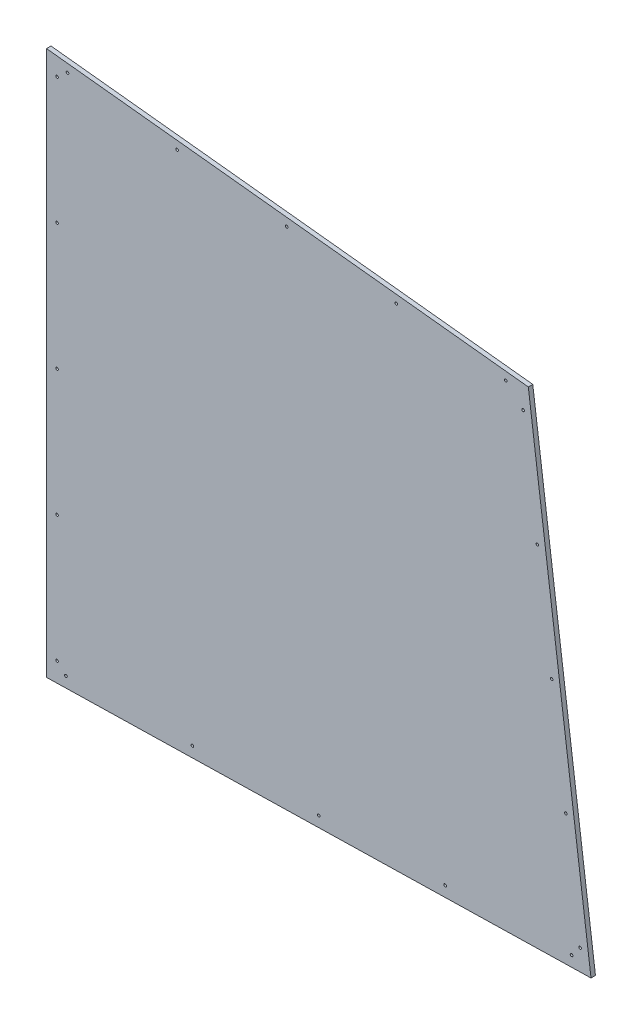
ISO-10303-21;
HEADER;
FILE_DESCRIPTION(('STEP AP214'),'2;1');
FILE_NAME('part.step','',(''),(''),'','','');
FILE_SCHEMA(('AUTOMOTIVE_DESIGN { 1 0 10303 214 1 1 1 1 }'));
ENDSEC;
DATA;
#1=APPLICATION_CONTEXT('core data for automotive mechanical design processes');
#2=APPLICATION_PROTOCOL_DEFINITION('international standard','automotive_design',2000,#1);
#3=PRODUCT_CONTEXT('',#1,'mechanical');
#4=PRODUCT('Part','Part','',(#3));
#5=PRODUCT_RELATED_PRODUCT_CATEGORY('part','',(#4));
#6=PRODUCT_DEFINITION_FORMATION('','',#4);
#7=PRODUCT_DEFINITION_CONTEXT('part definition',#1,'design');
#8=PRODUCT_DEFINITION('design','',#6,#7);
#9=PRODUCT_DEFINITION_SHAPE('','',#8);
#10=(LENGTH_UNIT() NAMED_UNIT(*) SI_UNIT(.MILLI.,.METRE.));
#11=(NAMED_UNIT(*) PLANE_ANGLE_UNIT() SI_UNIT($,.RADIAN.));
#12=(NAMED_UNIT(*) SI_UNIT($,.STERADIAN.) SOLID_ANGLE_UNIT());
#13=UNCERTAINTY_MEASURE_WITH_UNIT(LENGTH_MEASURE(1.E-05),#10,'distance_accuracy_value','');
#14=(GEOMETRIC_REPRESENTATION_CONTEXT(3) GLOBAL_UNCERTAINTY_ASSIGNED_CONTEXT((#13)) GLOBAL_UNIT_ASSIGNED_CONTEXT((#10,
#11,#12)) REPRESENTATION_CONTEXT('',''));
#15=CARTESIAN_POINT('',(0.,0.,0.));
#16=DIRECTION('',(0.,0.,1.));
#17=DIRECTION('',(1.,0.,0.));
#18=AXIS2_PLACEMENT_3D('',#15,#16,#17);
#19=CARTESIAN_POINT('',(-175.501921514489,-179.383996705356,8.7312499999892));
#20=DIRECTION('',(-0.02187525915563,0.999760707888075,0.));
#21=DIRECTION('',(-0.999760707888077,-0.0218752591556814,0.));
#22=AXIS2_PLACEMENT_3D('',#19,#20,#21);
#23=PLANE('',#22);
#24=DIRECTION('',(0.999760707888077,0.0218752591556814,0.));
#25=VECTOR('',#24,1.);
#26=CARTESIAN_POINT('',(-175.501921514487,-179.383996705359,-1.11022302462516E-11));
#27=LINE('',#26,#25);
#28=CARTESIAN_POINT('',(-175.501921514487,-179.383996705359,-1.11022302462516E-11));
#29=VERTEX_POINT('',#28);
#30=CARTESIAN_POINT('',(891.042801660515,-156.047470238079,4.04121180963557E-11));
#31=VERTEX_POINT('',#30);
#32=EDGE_CURVE('E97',#29,#31,#27,.T.);
#33=ORIENTED_EDGE('',*,*,#32,.T.);
#34=DIRECTION('',(0.,0.,-0.999999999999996));
#35=VECTOR('',#34,1.);
#36=CARTESIAN_POINT('',(891.042801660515,-156.047470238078,8.73125000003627));
#37=LINE('',#36,#35);
#38=CARTESIAN_POINT('',(891.042801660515,-156.047470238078,8.73125000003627));
#39=VERTEX_POINT('',#38);
#40=EDGE_CURVE('E11',#39,#31,#37,.T.);
#41=ORIENTED_EDGE('',*,*,#40,.F.);
#42=DIRECTION('',(0.999760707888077,0.0218752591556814,0.));
#43=VECTOR('',#42,1.);
#44=CARTESIAN_POINT('',(-175.501921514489,-179.383996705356,8.7312499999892));
#45=LINE('',#44,#43);
#46=CARTESIAN_POINT('',(-175.501921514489,-179.383996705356,8.7312499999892));
#47=VERTEX_POINT('',#46);
#48=EDGE_CURVE('E85',#47,#39,#45,.T.);
#49=ORIENTED_EDGE('',*,*,#48,.F.);
#50=DIRECTION('',(0.,0.,-0.999999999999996));
#51=VECTOR('',#50,1.);
#52=CARTESIAN_POINT('',(-175.501921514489,-179.383996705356,8.7312499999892));
#53=LINE('',#52,#51);
#54=EDGE_CURVE('E93',#47,#29,#53,.T.);
#55=ORIENTED_EDGE('',*,*,#54,.T.);
#56=EDGE_LOOP('',(#33,#41,#49,#55));
#57=FACE_BOUND('',#56,.T.);
#58=ADVANCED_FACE('F34',(#57),#23,.F.);
#59=CARTESIAN_POINT('',(891.042801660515,-156.047470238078,8.73125000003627));
#60=DIRECTION('',(-0.991600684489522,-0.129337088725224,0.));
#61=DIRECTION('',(0.12933708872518,-0.991600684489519,0.));
#62=AXIS2_PLACEMENT_3D('',#59,#60,#61);
#63=PLANE('',#62);
#64=DIRECTION('',(-0.129337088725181,0.991600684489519,0.));
#65=VECTOR('',#64,1.);
#66=CARTESIAN_POINT('',(891.042801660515,-156.047470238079,4.04121180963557E-11));
#67=LINE('',#66,#65);
#68=CARTESIAN_POINT('',(768.265646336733,785.259562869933,6.75015598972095E-11));
#69=VERTEX_POINT('',#68);
#70=EDGE_CURVE('E89',#31,#69,#67,.T.);
#71=ORIENTED_EDGE('',*,*,#70,.T.);
#72=DIRECTION('',(0.,0.,-0.999999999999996));
#73=VECTOR('',#72,1.);
#74=CARTESIAN_POINT('',(768.26564633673,785.259562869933,8.73125000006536));
#75=LINE('',#74,#73);
#76=CARTESIAN_POINT('',(768.26564633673,785.259562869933,8.73125000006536));
#77=VERTEX_POINT('',#76);
#78=EDGE_CURVE('E42',#77,#69,#75,.T.);
#79=ORIENTED_EDGE('',*,*,#78,.F.);
#80=DIRECTION('',(-0.129337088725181,0.991600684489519,0.));
#81=VECTOR('',#80,1.);
#82=CARTESIAN_POINT('',(891.042801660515,-156.047470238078,8.73125000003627));
#83=LINE('',#82,#81);
#84=EDGE_CURVE('E80',#39,#77,#83,.T.);
#85=ORIENTED_EDGE('',*,*,#84,.F.);
#86=ORIENTED_EDGE('',*,*,#40,.T.);
#87=EDGE_LOOP('',(#71,#79,#85,#86));
#88=FACE_BOUND('',#87,.T.);
#89=ADVANCED_FACE('F88',(#88),#63,.F.);
#90=CARTESIAN_POINT('',(-175.501921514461,887.416003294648,8.73125000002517));
#91=DIRECTION('',(-0.107614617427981,-0.99419268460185,0.));
#92=DIRECTION('',(0.994192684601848,-0.107614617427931,0.));
#93=AXIS2_PLACEMENT_3D('',#90,#91,#92);
#94=PLANE('',#93);
#95=DIRECTION('',(-0.994192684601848,0.10761461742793,0.));
#96=VECTOR('',#95,1.);
#97=CARTESIAN_POINT('',(-175.501921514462,887.416003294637,2.53130849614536E-11));
#98=LINE('',#97,#96);
#99=CARTESIAN_POINT('',(-175.501921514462,887.416003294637,2.53130849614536E-11));
#100=VERTEX_POINT('',#99);
#101=EDGE_CURVE('E67',#69,#100,#98,.T.);
#102=ORIENTED_EDGE('',*,*,#101,.T.);
#103=DIRECTION('',(0.,0.,-0.999999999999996));
#104=VECTOR('',#103,1.);
#105=CARTESIAN_POINT('',(-175.501921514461,887.416003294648,8.73125000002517));
#106=LINE('',#105,#104);
#107=CARTESIAN_POINT('',(-175.501921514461,887.416003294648,8.73125000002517));
#108=VERTEX_POINT('',#107);
#109=EDGE_CURVE('E90',#108,#100,#106,.T.);
#110=ORIENTED_EDGE('',*,*,#109,.F.);
#111=DIRECTION('',(-0.994192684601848,0.10761461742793,0.));
#112=VECTOR('',#111,1.);
#113=CARTESIAN_POINT('',(-175.501921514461,887.416003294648,8.73125000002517));
#114=LINE('',#113,#112);
#115=EDGE_CURVE('E83',#77,#108,#114,.T.);
#116=ORIENTED_EDGE('',*,*,#115,.F.);
#117=ORIENTED_EDGE('',*,*,#78,.T.);
#118=EDGE_LOOP('',(#102,#110,#116,#117));
#119=FACE_BOUND('',#118,.T.);
#120=ADVANCED_FACE('F91',(#119),#94,.F.);
#121=CARTESIAN_POINT('',(-175.501921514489,-179.383996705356,8.7312499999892));
#122=DIRECTION('',(0.999999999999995,0.,0.));
#123=DIRECTION('',(0.,0.,-0.999999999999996));
#124=AXIS2_PLACEMENT_3D('',#121,#122,#123);
#125=PLANE('',#124);
#126=DIRECTION('',(0.,-1.,0.));
#127=VECTOR('',#126,1.);
#128=CARTESIAN_POINT('',(-175.501921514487,-179.383996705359,-1.11022302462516E-11));
#129=LINE('',#128,#127);
#130=EDGE_CURVE('E73',#100,#29,#129,.T.);
#131=ORIENTED_EDGE('',*,*,#130,.T.);
#132=ORIENTED_EDGE('',*,*,#54,.F.);
#133=DIRECTION('',(0.,-1.,0.));
#134=VECTOR('',#133,1.);
#135=CARTESIAN_POINT('',(-175.501921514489,-179.383996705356,8.7312499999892));
#136=LINE('',#135,#134);
#137=EDGE_CURVE('E50',#108,#47,#136,.T.);
#138=ORIENTED_EDGE('',*,*,#137,.F.);
#139=ORIENTED_EDGE('',*,*,#109,.T.);
#140=EDGE_LOOP('',(#131,#132,#138,#139));
#141=FACE_BOUND('',#140,.T.);
#142=ADVANCED_FACE('F105',(#141),#125,.F.);
#143=CARTESIAN_POINT('',(3.19189119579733E-12,-1.91491859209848E-12,8.7312500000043));
#144=DIRECTION('',(0.,0.,0.999999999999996));
#145=DIRECTION('',(0.999999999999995,0.,0.));
#146=AXIS2_PLACEMENT_3D('',#143,#144,#145);
#147=PLANE('',#146);
#148=CARTESIAN_POINT('',(-154.86442151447,602.1175620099,8.73125000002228));
#149=DIRECTION('',(0.,0.,0.999999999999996));
#150=DIRECTION('',(0.999999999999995,0.,0.));
#151=AXIS2_PLACEMENT_3D('',#148,#149,#150);
#152=CIRCLE('',#151,2.57936999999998);
#153=CARTESIAN_POINT('',(-152.285051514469,602.11756200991,8.73125000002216));
#154=VERTEX_POINT('',#153);
#155=EDGE_CURVE('E225',#154,#154,#152,.T.);
#156=ORIENTED_EDGE('',*,*,#155,.F.);
#157=EDGE_LOOP('',(#156));
#158=FACE_BOUND('',#157,.T.);
#159=CARTESIAN_POINT('',(-154.864421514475,354.467562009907,8.73124999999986));
#160=DIRECTION('',(0.,0.,0.999999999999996));
#161=DIRECTION('',(0.999999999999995,0.,0.));
#162=AXIS2_PLACEMENT_3D('',#159,#160,#161);
#163=CIRCLE('',#162,2.57937);
#164=CARTESIAN_POINT('',(-152.285051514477,354.467562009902,8.73124999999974));
#165=VERTEX_POINT('',#164);
#166=EDGE_CURVE('E219',#165,#165,#163,.T.);
#167=ORIENTED_EDGE('',*,*,#166,.F.);
#168=EDGE_LOOP('',(#167));
#169=FACE_BOUND('',#168,.T.);
#170=CARTESIAN_POINT('',(-154.864421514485,106.817562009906,8.73124999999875));
#171=DIRECTION('',(0.,0.,0.999999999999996));
#172=DIRECTION('',(0.999999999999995,0.,0.));
#173=AXIS2_PLACEMENT_3D('',#170,#171,#172);
#174=CIRCLE('',#173,2.57936999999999);
#175=CARTESIAN_POINT('',(-152.285051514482,106.81756200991,8.73124999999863));
#176=VERTEX_POINT('',#175);
#177=EDGE_CURVE('E213',#176,#176,#174,.T.);
#178=ORIENTED_EDGE('',*,*,#177,.F.);
#179=EDGE_LOOP('',(#178));
#180=FACE_BOUND('',#179,.T.);
#181=CARTESIAN_POINT('',(-154.864421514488,-140.832437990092,8.73124999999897));
#182=DIRECTION('',(0.,0.,0.999999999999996));
#183=DIRECTION('',(0.999999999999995,0.,0.));
#184=AXIS2_PLACEMENT_3D('',#181,#182,#183);
#185=CIRCLE('',#184,2.57936999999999);
#186=CARTESIAN_POINT('',(-152.28505151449,-140.832437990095,8.73124999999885));
#187=VERTEX_POINT('',#186);
#188=EDGE_CURVE('E207',#187,#187,#185,.T.);
#189=ORIENTED_EDGE('',*,*,#188,.F.);
#190=EDGE_LOOP('',(#189));
#191=FACE_BOUND('',#190,.T.);
#192=CARTESIAN_POINT('',(-137.411038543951,-157.908109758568,8.73124999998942));
#193=DIRECTION('',(0.,0.,0.999999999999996));
#194=DIRECTION('',(0.999999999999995,0.,0.));
#195=AXIS2_PLACEMENT_3D('',#192,#193,#194);
#196=CIRCLE('',#195,2.57936999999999);
#197=CARTESIAN_POINT('',(-134.831668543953,-157.908109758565,8.7312499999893));
#198=VERTEX_POINT('',#197);
#199=EDGE_CURVE('E201',#198,#198,#196,.T.);
#200=ORIENTED_EDGE('',*,*,#199,.F.);
#201=EDGE_LOOP('',(#200));
#202=FACE_BOUND('',#201,.T.);
#203=CARTESIAN_POINT('',(110.17970076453,-152.490701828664,8.73125000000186));
#204=DIRECTION('',(0.,0.,0.999999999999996));
#205=DIRECTION('',(0.999999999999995,0.,0.));
#206=AXIS2_PLACEMENT_3D('',#203,#204,#205);
#207=CIRCLE('',#206,2.57937);
#208=CARTESIAN_POINT('',(112.759070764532,-152.490701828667,8.73125000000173));
#209=VERTEX_POINT('',#208);
#210=EDGE_CURVE('E195',#209,#209,#207,.T.);
#211=ORIENTED_EDGE('',*,*,#210,.F.);
#212=EDGE_LOOP('',(#211));
#213=FACE_BOUND('',#212,.T.);
#214=CARTESIAN_POINT('',(357.770440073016,-147.07329389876,8.73125000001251));
#215=DIRECTION('',(0.,0.,0.999999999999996));
#216=DIRECTION('',(0.999999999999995,0.,0.));
#217=AXIS2_PLACEMENT_3D('',#214,#215,#216);
#218=CIRCLE('',#217,2.57937000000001);
#219=CARTESIAN_POINT('',(360.349810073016,-147.07329389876,8.73125000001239));
#220=VERTEX_POINT('',#219);
#221=EDGE_CURVE('E189',#220,#220,#218,.T.);
#222=ORIENTED_EDGE('',*,*,#221,.F.);
#223=EDGE_LOOP('',(#222));
#224=FACE_BOUND('',#223,.T.);
#225=CARTESIAN_POINT('',(605.361179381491,-141.655885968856,8.73125000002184));
#226=DIRECTION('',(0.,0.,0.999999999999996));
#227=DIRECTION('',(0.999999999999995,0.,0.));
#228=AXIS2_PLACEMENT_3D('',#225,#226,#227);
#229=CIRCLE('',#228,2.57936999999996);
#230=CARTESIAN_POINT('',(607.940549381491,-141.655885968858,8.73125000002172));
#231=VERTEX_POINT('',#230);
#232=EDGE_CURVE('E183',#231,#231,#229,.T.);
#233=ORIENTED_EDGE('',*,*,#232,.F.);
#234=EDGE_LOOP('',(#233));
#235=FACE_BOUND('',#234,.T.);
#236=CARTESIAN_POINT('',(852.951918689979,-136.238478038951,8.73125000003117));
#237=DIRECTION('',(0.,0.,0.999999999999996));
#238=DIRECTION('',(0.999999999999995,0.,0.));
#239=AXIS2_PLACEMENT_3D('',#236,#237,#238);
#240=CIRCLE('',#239,2.57936999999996);
#241=CARTESIAN_POINT('',(855.53128868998,-136.238478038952,8.73125000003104));
#242=VERTEX_POINT('',#241);
#243=EDGE_CURVE('E177',#242,#242,#240,.T.);
#244=ORIENTED_EDGE('',*,*,#243,.F.);
#245=EDGE_LOOP('',(#244));
#246=FACE_BOUND('',#245,.T.);
#247=CARTESIAN_POINT('',(869.740504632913,-115.468450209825,8.73125000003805));
#248=DIRECTION('',(0.,0.,0.999999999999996));
#249=DIRECTION('',(0.999999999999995,0.,0.));
#250=AXIS2_PLACEMENT_3D('',#247,#248,#249);
#251=CIRCLE('',#250,2.57936999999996);
#252=CARTESIAN_POINT('',(872.319874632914,-115.468450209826,8.73125000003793));
#253=VERTEX_POINT('',#252);
#254=EDGE_CURVE('E171',#253,#253,#251,.T.);
#255=ORIENTED_EDGE('',*,*,#254,.F.);
#256=EDGE_LOOP('',(#255));
#257=FACE_BOUND('',#256,.T.);
#258=CARTESIAN_POINT('',(841.816627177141,98.6181375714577,8.73125000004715));
#259=DIRECTION('',(0.,0.,0.999999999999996));
#260=DIRECTION('',(0.999999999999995,0.,0.));
#261=AXIS2_PLACEMENT_3D('',#258,#259,#260);
#262=CIRCLE('',#261,2.57936999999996);
#263=CARTESIAN_POINT('',(844.395997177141,98.6181375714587,8.73125000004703));
#264=VERTEX_POINT('',#263);
#265=EDGE_CURVE('E165',#264,#264,#262,.T.);
#266=ORIENTED_EDGE('',*,*,#265,.F.);
#267=EDGE_LOOP('',(#266));
#268=FACE_BOUND('',#267,.T.);
#269=CARTESIAN_POINT('',(813.892749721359,312.704725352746,8.73125000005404));
#270=DIRECTION('',(0.,0.,0.999999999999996));
#271=DIRECTION('',(0.999999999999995,0.,0.));
#272=AXIS2_PLACEMENT_3D('',#269,#270,#271);
#273=CIRCLE('',#272,2.57936999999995);
#274=CARTESIAN_POINT('',(816.472119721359,312.704725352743,8.73125000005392));
#275=VERTEX_POINT('',#274);
#276=EDGE_CURVE('E159',#275,#275,#273,.T.);
#277=ORIENTED_EDGE('',*,*,#276,.F.);
#278=EDGE_LOOP('',(#277));
#279=FACE_BOUND('',#278,.T.);
#280=CARTESIAN_POINT('',(785.968872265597,526.791313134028,8.7312500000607));
#281=DIRECTION('',(0.,0.,0.999999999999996));
#282=DIRECTION('',(0.999999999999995,0.,0.));
#283=AXIS2_PLACEMENT_3D('',#280,#281,#282);
#284=CIRCLE('',#283,2.57936999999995);
#285=CARTESIAN_POINT('',(788.548242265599,526.791313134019,8.73125000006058));
#286=VERTEX_POINT('',#285);
#287=EDGE_CURVE('E153',#286,#286,#284,.T.);
#288=ORIENTED_EDGE('',*,*,#287,.F.);
#289=EDGE_LOOP('',(#288));
#290=FACE_BOUND('',#289,.T.);
#291=CARTESIAN_POINT('',(758.044994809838,740.877900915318,8.73125000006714));
#292=DIRECTION('',(0.,0.,0.999999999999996));
#293=DIRECTION('',(0.999999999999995,0.,0.));
#294=AXIS2_PLACEMENT_3D('',#291,#292,#293);
#295=CIRCLE('',#294,2.57936999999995);
#296=CARTESIAN_POINT('',(760.624364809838,740.877900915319,8.73125000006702));
#297=VERTEX_POINT('',#296);
#298=EDGE_CURVE('E147',#297,#297,#295,.T.);
#299=ORIENTED_EDGE('',*,*,#298,.F.);
#300=EDGE_LOOP('',(#299));
#301=FACE_BOUND('',#300,.T.);
#302=CARTESIAN_POINT('',(724.118183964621,774.070496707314,8.73125000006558));
#303=DIRECTION('',(0.,0.,0.999999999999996));
#304=DIRECTION('',(0.999999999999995,0.,0.));
#305=AXIS2_PLACEMENT_3D('',#302,#303,#304);
#306=CIRCLE('',#305,2.57936999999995);
#307=CARTESIAN_POINT('',(726.697553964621,774.070496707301,8.73125000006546));
#308=VERTEX_POINT('',#307);
#309=EDGE_CURVE('E141',#308,#308,#306,.T.);
#310=ORIENTED_EDGE('',*,*,#309,.F.);
#311=EDGE_LOOP('',(#310));
#312=FACE_BOUND('',#311,.T.);
#313=CARTESIAN_POINT('',(509.471983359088,797.304492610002,8.73125000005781));
#314=DIRECTION('',(0.,0.,0.999999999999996));
#315=DIRECTION('',(0.999999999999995,0.,0.));
#316=AXIS2_PLACEMENT_3D('',#313,#314,#315);
#317=CIRCLE('',#316,2.57936999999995);
#318=CARTESIAN_POINT('',(512.051353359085,797.304492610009,8.73125000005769));
#319=VERTEX_POINT('',#318);
#320=EDGE_CURVE('E135',#319,#319,#317,.T.);
#321=ORIENTED_EDGE('',*,*,#320,.F.);
#322=EDGE_LOOP('',(#321));
#323=FACE_BOUND('',#322,.T.);
#324=CARTESIAN_POINT('',(294.825782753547,820.538488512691,8.73125000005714));
#325=DIRECTION('',(0.,0.,0.999999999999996));
#326=DIRECTION('',(0.999999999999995,0.,0.));
#327=AXIS2_PLACEMENT_3D('',#324,#325,#326);
#328=CIRCLE('',#327,2.57937000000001);
#329=CARTESIAN_POINT('',(297.405152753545,820.538488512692,8.73125000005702));
#330=VERTEX_POINT('',#329);
#331=EDGE_CURVE('E129',#330,#330,#328,.T.);
#332=ORIENTED_EDGE('',*,*,#331,.F.);
#333=EDGE_LOOP('',(#332));
#334=FACE_BOUND('',#333,.T.);
#335=CARTESIAN_POINT('',(80.179582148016,843.772484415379,8.73125000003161));
#336=DIRECTION('',(0.,0.,0.999999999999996));
#337=DIRECTION('',(0.999999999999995,0.,0.));
#338=AXIS2_PLACEMENT_3D('',#335,#336,#337);
#339=CIRCLE('',#338,2.57936999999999);
#340=CARTESIAN_POINT('',(82.7589521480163,843.77248441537,8.73125000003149));
#341=VERTEX_POINT('',#340);
#342=EDGE_CURVE('E123',#341,#341,#339,.T.);
#343=ORIENTED_EDGE('',*,*,#342,.F.);
#344=EDGE_LOOP('',(#343));
#345=FACE_BOUND('',#344,.T.);
#346=CARTESIAN_POINT('',(-154.864421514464,849.767562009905,8.73125000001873));
#347=DIRECTION('',(0.,0.,0.999999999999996));
#348=DIRECTION('',(0.999999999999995,0.,0.));
#349=AXIS2_PLACEMENT_3D('',#346,#347,#348);
#350=CIRCLE('',#349,2.57936999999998);
#351=CARTESIAN_POINT('',(-152.285051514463,849.767562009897,8.73125000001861));
#352=VERTEX_POINT('',#351);
#353=EDGE_CURVE('E117',#352,#352,#350,.T.);
#354=ORIENTED_EDGE('',*,*,#353,.F.);
#355=EDGE_LOOP('',(#354));
#356=FACE_BOUND('',#355,.T.);
#357=CARTESIAN_POINT('',(-134.466618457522,867.006480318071,8.73125000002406));
#358=DIRECTION('',(0.,0.,0.999999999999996));
#359=DIRECTION('',(0.999999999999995,0.,0.));
#360=AXIS2_PLACEMENT_3D('',#357,#358,#359);
#361=CIRCLE('',#360,2.57936999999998);
#362=CARTESIAN_POINT('',(-131.887248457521,867.006480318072,8.73125000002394));
#363=VERTEX_POINT('',#362);
#364=EDGE_CURVE('E111',#363,#363,#361,.T.);
#365=ORIENTED_EDGE('',*,*,#364,.F.);
#366=EDGE_LOOP('',(#365));
#367=FACE_BOUND('',#366,.T.);
#368=ORIENTED_EDGE('',*,*,#48,.T.);
#369=ORIENTED_EDGE('',*,*,#84,.T.);
#370=ORIENTED_EDGE('',*,*,#115,.T.);
#371=ORIENTED_EDGE('',*,*,#137,.T.);
#372=EDGE_LOOP('',(#368,#369,#370,#371));
#373=FACE_BOUND('',#372,.T.);
#374=ADVANCED_FACE('F81',(#158,#169,#180,#191,#202,#213,#224,#235,#246,#257,#268,#279,#290,#301,
#312,#323,#334,#345,#356,#367,#373),#147,.T.);
#375=CARTESIAN_POINT('',(0.,0.,0.));
#376=DIRECTION('',(0.,0.,0.999999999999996));
#377=DIRECTION('',(0.999999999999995,0.,0.));
#378=AXIS2_PLACEMENT_3D('',#375,#376,#377);
#379=PLANE('',#378);
#380=CARTESIAN_POINT('',(-154.864421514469,602.11756200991,1.26565424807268E-11));
#381=DIRECTION('',(0.,0.,0.999999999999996));
#382=DIRECTION('',(0.999999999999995,0.,0.));
#383=AXIS2_PLACEMENT_3D('',#380,#381,#382);
#384=CIRCLE('',#383,2.57936999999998);
#385=CARTESIAN_POINT('',(-152.28505151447,602.11756200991,1.25334044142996E-11));
#386=VERTEX_POINT('',#385);
#387=EDGE_CURVE('E222',#386,#386,#384,.T.);
#388=ORIENTED_EDGE('',*,*,#387,.T.);
#389=EDGE_LOOP('',(#388));
#390=FACE_BOUND('',#389,.T.);
#391=CARTESIAN_POINT('',(-154.864421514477,354.467562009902,1.33226762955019E-12));
#392=DIRECTION('',(0.,0.,0.999999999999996));
#393=DIRECTION('',(0.999999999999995,0.,0.));
#394=AXIS2_PLACEMENT_3D('',#391,#392,#393);
#395=CIRCLE('',#394,2.57937);
#396=CARTESIAN_POINT('',(-152.285051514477,354.467562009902,1.20912956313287E-12));
#397=VERTEX_POINT('',#396);
#398=EDGE_CURVE('E216',#397,#397,#395,.T.);
#399=ORIENTED_EDGE('',*,*,#398,.T.);
#400=EDGE_LOOP('',(#399));
#401=FACE_BOUND('',#400,.T.);
#402=CARTESIAN_POINT('',(-154.864421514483,106.81756200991,-2.22044604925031E-12));
#403=DIRECTION('',(0.,0.,0.999999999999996));
#404=DIRECTION('',(0.999999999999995,0.,0.));
#405=AXIS2_PLACEMENT_3D('',#402,#403,#404);
#406=CIRCLE('',#405,2.57936999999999);
#407=CARTESIAN_POINT('',(-152.285051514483,106.81756200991,-2.34358411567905E-12));
#408=VERTEX_POINT('',#407);
#409=EDGE_CURVE('E210',#408,#408,#406,.T.);
#410=ORIENTED_EDGE('',*,*,#409,.T.);
#411=EDGE_LOOP('',(#410));
#412=FACE_BOUND('',#411,.T.);
#413=CARTESIAN_POINT('',(-154.86442151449,-140.832437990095,-2.1094237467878E-11));
#414=DIRECTION('',(0.,0.,0.999999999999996));
#415=DIRECTION('',(0.999999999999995,0.,0.));
#416=AXIS2_PLACEMENT_3D('',#413,#414,#415);
#417=CIRCLE('',#416,2.57936999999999);
#418=CARTESIAN_POINT('',(-152.28505151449,-140.832437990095,-2.12173755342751E-11));
#419=VERTEX_POINT('',#418);
#420=EDGE_CURVE('E204',#419,#419,#417,.T.);
#421=ORIENTED_EDGE('',*,*,#420,.T.);
#422=EDGE_LOOP('',(#421));
#423=FACE_BOUND('',#422,.T.);
#424=CARTESIAN_POINT('',(-137.411038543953,-157.908109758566,-1.22124532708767E-11));
#425=DIRECTION('',(0.,0.,0.999999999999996));
#426=DIRECTION('',(0.999999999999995,0.,0.));
#427=AXIS2_PLACEMENT_3D('',#424,#425,#426);
#428=CIRCLE('',#427,2.57936999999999);
#429=CARTESIAN_POINT('',(-134.831668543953,-157.908109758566,-1.23355913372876E-11));
#430=VERTEX_POINT('',#429);
#431=EDGE_CURVE('E198',#430,#430,#428,.T.);
#432=ORIENTED_EDGE('',*,*,#431,.T.);
#433=EDGE_LOOP('',(#432));
#434=FACE_BOUND('',#433,.T.);
#435=CARTESIAN_POINT('',(110.179700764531,-152.490701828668,1.77635683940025E-12));
#436=DIRECTION('',(0.,0.,0.999999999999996));
#437=DIRECTION('',(0.999999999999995,0.,0.));
#438=AXIS2_PLACEMENT_3D('',#435,#436,#437);
#439=CIRCLE('',#438,2.57937);
#440=CARTESIAN_POINT('',(112.759070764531,-152.490701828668,1.65321877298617E-12));
#441=VERTEX_POINT('',#440);
#442=EDGE_CURVE('E192',#441,#441,#439,.T.);
#443=ORIENTED_EDGE('',*,*,#442,.T.);
#444=EDGE_LOOP('',(#443));
#445=FACE_BOUND('',#444,.T.);
#446=CARTESIAN_POINT('',(357.770440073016,-147.073293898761,1.17683640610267E-11));
#447=DIRECTION('',(0.,0.,0.999999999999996));
#448=DIRECTION('',(0.999999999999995,0.,0.));
#449=AXIS2_PLACEMENT_3D('',#446,#447,#448);
#450=CIRCLE('',#449,2.57937000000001);
#451=CARTESIAN_POINT('',(360.349810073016,-147.073293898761,1.16452259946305E-11));
#452=VERTEX_POINT('',#451);
#453=EDGE_CURVE('E186',#452,#452,#450,.T.);
#454=ORIENTED_EDGE('',*,*,#453,.T.);
#455=EDGE_LOOP('',(#454));
#456=FACE_BOUND('',#455,.T.);
#457=CARTESIAN_POINT('',(605.361179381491,-141.655885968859,6.21724893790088E-12));
#458=DIRECTION('',(0.,0.,0.999999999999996));
#459=DIRECTION('',(0.999999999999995,0.,0.));
#460=AXIS2_PLACEMENT_3D('',#457,#458,#459);
#461=CIRCLE('',#460,2.57936999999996);
#462=CARTESIAN_POINT('',(607.940549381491,-141.655885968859,6.09411087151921E-12));
#463=VERTEX_POINT('',#462);
#464=EDGE_CURVE('E180',#463,#463,#461,.T.);
#465=ORIENTED_EDGE('',*,*,#464,.T.);
#466=EDGE_LOOP('',(#465));
#467=FACE_BOUND('',#466,.T.);
#468=CARTESIAN_POINT('',(852.951918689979,-136.238478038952,4.21884749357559E-11));
#469=DIRECTION('',(0.,0.,0.999999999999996));
#470=DIRECTION('',(0.999999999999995,0.,0.));
#471=AXIS2_PLACEMENT_3D('',#468,#469,#470);
#472=CIRCLE('',#471,2.57936999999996);
#473=CARTESIAN_POINT('',(855.53128868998,-136.238478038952,4.20653368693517E-11));
#474=VERTEX_POINT('',#473);
#475=EDGE_CURVE('E174',#474,#474,#472,.T.);
#476=ORIENTED_EDGE('',*,*,#475,.T.);
#477=EDGE_LOOP('',(#476));
#478=FACE_BOUND('',#477,.T.);
#479=CARTESIAN_POINT('',(869.740504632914,-115.468450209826,3.88578058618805E-11));
#480=DIRECTION('',(0.,0.,0.999999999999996));
#481=DIRECTION('',(0.999999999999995,0.,0.));
#482=AXIS2_PLACEMENT_3D('',#479,#480,#481);
#483=CIRCLE('',#482,2.57936999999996);
#484=CARTESIAN_POINT('',(872.319874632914,-115.468450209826,3.87346677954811E-11));
#485=VERTEX_POINT('',#484);
#486=EDGE_CURVE('E168',#485,#485,#483,.T.);
#487=ORIENTED_EDGE('',*,*,#486,.T.);
#488=EDGE_LOOP('',(#487));
#489=FACE_BOUND('',#488,.T.);
#490=CARTESIAN_POINT('',(841.816627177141,98.6181375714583,4.39648317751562E-11));
#491=DIRECTION('',(0.,0.,0.999999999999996));
#492=DIRECTION('',(0.999999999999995,0.,0.));
#493=AXIS2_PLACEMENT_3D('',#490,#491,#492);
#494=CIRCLE('',#493,2.57936999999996);
#495=CARTESIAN_POINT('',(844.395997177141,98.6181375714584,4.38416937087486E-11));
#496=VERTEX_POINT('',#495);
#497=EDGE_CURVE('E162',#496,#496,#494,.T.);
#498=ORIENTED_EDGE('',*,*,#497,.T.);
#499=EDGE_LOOP('',(#498));
#500=FACE_BOUND('',#499,.T.);
#501=CARTESIAN_POINT('',(813.892749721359,312.704725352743,4.9737991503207E-11));
#502=DIRECTION('',(0.,0.,0.999999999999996));
#503=DIRECTION('',(0.999999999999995,0.,0.));
#504=AXIS2_PLACEMENT_3D('',#501,#502,#503);
#505=CIRCLE('',#504,2.57936999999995);
#506=CARTESIAN_POINT('',(816.472119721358,312.704725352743,4.961485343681E-11));
#507=VERTEX_POINT('',#506);
#508=EDGE_CURVE('E156',#507,#507,#505,.T.);
#509=ORIENTED_EDGE('',*,*,#508,.T.);
#510=EDGE_LOOP('',(#509));
#511=FACE_BOUND('',#510,.T.);
#512=CARTESIAN_POINT('',(785.968872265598,526.791313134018,5.55111512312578E-11));
#513=DIRECTION('',(0.,0.,0.999999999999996));
#514=DIRECTION('',(0.999999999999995,0.,0.));
#515=AXIS2_PLACEMENT_3D('',#512,#513,#514);
#516=CIRCLE('',#515,2.57936999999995);
#517=CARTESIAN_POINT('',(788.548242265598,526.791313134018,5.53880131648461E-11));
#518=VERTEX_POINT('',#517);
#519=EDGE_CURVE('E150',#518,#518,#516,.T.);
#520=ORIENTED_EDGE('',*,*,#519,.T.);
#521=EDGE_LOOP('',(#520));
#522=FACE_BOUND('',#521,.T.);
#523=CARTESIAN_POINT('',(758.044994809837,740.877900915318,6.77236045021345E-11));
#524=DIRECTION('',(0.,0.,0.999999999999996));
#525=DIRECTION('',(0.999999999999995,0.,0.));
#526=AXIS2_PLACEMENT_3D('',#523,#524,#525);
#527=CIRCLE('',#526,2.57936999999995);
#528=CARTESIAN_POINT('',(760.624364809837,740.877900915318,6.76004664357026E-11));
#529=VERTEX_POINT('',#528);
#530=EDGE_CURVE('E144',#529,#529,#527,.T.);
#531=ORIENTED_EDGE('',*,*,#530,.T.);
#532=EDGE_LOOP('',(#531));
#533=FACE_BOUND('',#532,.T.);
#534=CARTESIAN_POINT('',(724.118183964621,774.0704967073,7.01660951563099E-11));
#535=DIRECTION('',(0.,0.,0.999999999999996));
#536=DIRECTION('',(0.999999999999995,0.,0.));
#537=AXIS2_PLACEMENT_3D('',#534,#535,#536);
#538=CIRCLE('',#537,2.57936999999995);
#539=CARTESIAN_POINT('',(726.697553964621,774.0704967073,7.00429570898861E-11));
#540=VERTEX_POINT('',#539);
#541=EDGE_CURVE('E138',#540,#540,#538,.T.);
#542=ORIENTED_EDGE('',*,*,#541,.T.);
#543=EDGE_LOOP('',(#542));
#544=FACE_BOUND('',#543,.T.);
#545=CARTESIAN_POINT('',(509.471983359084,797.304492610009,5.37347943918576E-11));
#546=DIRECTION('',(0.,0.,0.999999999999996));
#547=DIRECTION('',(0.999999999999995,0.,0.));
#548=AXIS2_PLACEMENT_3D('',#545,#546,#547);
#549=CIRCLE('',#548,2.57936999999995);
#550=CARTESIAN_POINT('',(512.051353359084,797.304492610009,5.36116563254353E-11));
#551=VERTEX_POINT('',#550);
#552=EDGE_CURVE('E132',#551,#551,#549,.T.);
#553=ORIENTED_EDGE('',*,*,#552,.T.);
#554=EDGE_LOOP('',(#553));
#555=FACE_BOUND('',#554,.T.);
#556=CARTESIAN_POINT('',(294.825782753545,820.538488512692,5.08482145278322E-11));
#557=DIRECTION('',(0.,0.,0.999999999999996));
#558=DIRECTION('',(0.999999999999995,0.,0.));
#559=AXIS2_PLACEMENT_3D('',#556,#557,#558);
#560=CIRCLE('',#559,2.57937000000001);
#561=CARTESIAN_POINT('',(297.405152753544,820.538488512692,5.0725076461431E-11));
#562=VERTEX_POINT('',#561);
#563=EDGE_CURVE('E126',#562,#562,#560,.T.);
#564=ORIENTED_EDGE('',*,*,#563,.T.);
#565=EDGE_LOOP('',(#564));
#566=FACE_BOUND('',#565,.T.);
#567=CARTESIAN_POINT('',(80.1795821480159,843.772484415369,3.41948691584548E-11));
#568=DIRECTION('',(0.,0.,0.999999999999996));
#569=DIRECTION('',(0.999999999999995,0.,0.));
#570=AXIS2_PLACEMENT_3D('',#567,#568,#569);
#571=CIRCLE('',#570,2.57936999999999);
#572=CARTESIAN_POINT('',(82.7589521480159,843.772484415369,3.40717310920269E-11));
#573=VERTEX_POINT('',#572);
#574=EDGE_CURVE('E120',#573,#573,#571,.T.);
#575=ORIENTED_EDGE('',*,*,#574,.T.);
#576=EDGE_LOOP('',(#575));
#577=FACE_BOUND('',#576,.T.);
#578=CARTESIAN_POINT('',(-154.864421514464,849.767562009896,1.04360964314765E-11));
#579=DIRECTION('',(0.,0.,0.999999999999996));
#580=DIRECTION('',(0.999999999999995,0.,0.));
#581=AXIS2_PLACEMENT_3D('',#578,#579,#580);
#582=CIRCLE('',#581,2.57936999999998);
#583=CARTESIAN_POINT('',(-152.285051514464,849.767562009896,1.03129583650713E-11));
#584=VERTEX_POINT('',#583);
#585=EDGE_CURVE('E114',#584,#584,#582,.T.);
#586=ORIENTED_EDGE('',*,*,#585,.T.);
#587=EDGE_LOOP('',(#586));
#588=FACE_BOUND('',#587,.T.);
#589=CARTESIAN_POINT('',(-134.466618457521,867.006480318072,2.8421709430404E-11));
#590=DIRECTION('',(0.,0.,0.999999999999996));
#591=DIRECTION('',(0.999999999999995,0.,0.));
#592=AXIS2_PLACEMENT_3D('',#589,#590,#591);
#593=CIRCLE('',#592,2.57936999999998);
#594=CARTESIAN_POINT('',(-131.887248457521,867.006480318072,2.82985713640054E-11));
#595=VERTEX_POINT('',#594);
#596=EDGE_CURVE('E100',#595,#595,#593,.T.);
#597=ORIENTED_EDGE('',*,*,#596,.T.);
#598=EDGE_LOOP('',(#597));
#599=FACE_BOUND('',#598,.T.);
#600=ORIENTED_EDGE('',*,*,#32,.F.);
#601=ORIENTED_EDGE('',*,*,#130,.F.);
#602=ORIENTED_EDGE('',*,*,#101,.F.);
#603=ORIENTED_EDGE('',*,*,#70,.F.);
#604=EDGE_LOOP('',(#600,#601,#602,#603));
#605=FACE_BOUND('',#604,.T.);
#606=ADVANCED_FACE('F108',(#390,#401,#412,#423,#434,#445,#456,#467,#478,#489,#500,#511,#522,
#533,#544,#555,#566,#577,#588,#599,#605),#379,.F.);
#607=CARTESIAN_POINT('',(-134.466618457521,867.006480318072,2.8421709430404E-11));
#608=DIRECTION('',(0.,0.,0.999999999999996));
#609=DIRECTION('',(0.999999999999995,0.,0.));
#610=AXIS2_PLACEMENT_3D('',#607,#608,#609);
#611=CYLINDRICAL_SURFACE('',#610,2.57936999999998);
#612=CARTESIAN_POINT('',(-131.887248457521,867.006480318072,2.82985713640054E-11));
#613=CARTESIAN_POINT('',(-131.887248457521,867.006480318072,0.0909505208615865));
#614=CARTESIAN_POINT('',(-131.887248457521,867.006480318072,0.181901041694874));
#615=CARTESIAN_POINT('',(-131.887248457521,867.006480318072,0.36380208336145));
#616=CARTESIAN_POINT('',(-131.887248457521,867.006480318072,0.454752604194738));
#617=CARTESIAN_POINT('',(-131.887248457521,867.006480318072,0.636653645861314));
#618=CARTESIAN_POINT('',(-131.887248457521,867.006480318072,0.727604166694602));
#619=CARTESIAN_POINT('',(-131.887248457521,867.006480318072,0.909505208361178));
#620=CARTESIAN_POINT('',(-131.887248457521,867.006480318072,1.00045572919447));
#621=CARTESIAN_POINT('',(-131.887248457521,867.006480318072,1.18235677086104));
#622=CARTESIAN_POINT('',(-131.887248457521,867.006480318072,1.27330729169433));
#623=CARTESIAN_POINT('',(-131.887248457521,867.006480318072,1.4552083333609));
#624=CARTESIAN_POINT('',(-131.887248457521,867.006480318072,1.54615885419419));
#625=CARTESIAN_POINT('',(-131.887248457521,867.006480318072,1.72805989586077));
#626=CARTESIAN_POINT('',(-131.887248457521,867.006480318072,1.81901041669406));
#627=CARTESIAN_POINT('',(-131.887248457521,867.006480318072,2.00091145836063));
#628=CARTESIAN_POINT('',(-131.887248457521,867.006480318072,2.09186197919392));
#629=CARTESIAN_POINT('',(-131.887248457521,867.006480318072,2.2737630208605));
#630=CARTESIAN_POINT('',(-131.887248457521,867.006480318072,2.36471354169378));
#631=CARTESIAN_POINT('',(-131.887248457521,867.006480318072,2.54661458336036));
#632=CARTESIAN_POINT('',(-131.887248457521,867.006480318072,2.63756510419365));
#633=CARTESIAN_POINT('',(-131.887248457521,867.006480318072,2.81946614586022));
#634=CARTESIAN_POINT('',(-131.887248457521,867.006480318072,2.91041666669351));
#635=CARTESIAN_POINT('',(-131.887248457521,867.006480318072,3.09231770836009));
#636=CARTESIAN_POINT('',(-131.887248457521,867.006480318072,3.18326822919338));
#637=CARTESIAN_POINT('',(-131.887248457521,867.006480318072,3.36516927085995));
#638=CARTESIAN_POINT('',(-131.887248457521,867.006480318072,3.45611979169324));
#639=CARTESIAN_POINT('',(-131.887248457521,867.006480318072,3.63802083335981));
#640=CARTESIAN_POINT('',(-131.887248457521,867.006480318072,3.7289713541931));
#641=CARTESIAN_POINT('',(-131.887248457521,867.006480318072,3.91087239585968));
#642=CARTESIAN_POINT('',(-131.887248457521,867.006480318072,4.00182291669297));
#643=CARTESIAN_POINT('',(-131.887248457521,867.006480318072,4.18372395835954));
#644=CARTESIAN_POINT('',(-131.887248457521,867.006480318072,4.27467447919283));
#645=CARTESIAN_POINT('',(-131.887248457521,867.006480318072,4.45657552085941));
#646=CARTESIAN_POINT('',(-131.887248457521,867.006480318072,4.54752604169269));
#647=CARTESIAN_POINT('',(-131.887248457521,867.006480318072,4.72942708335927));
#648=CARTESIAN_POINT('',(-131.887248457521,867.006480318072,4.82037760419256));
#649=CARTESIAN_POINT('',(-131.887248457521,867.006480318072,5.00227864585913));
#650=CARTESIAN_POINT('',(-131.887248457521,867.006480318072,5.09322916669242));
#651=CARTESIAN_POINT('',(-131.887248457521,867.006480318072,5.275130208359));
#652=CARTESIAN_POINT('',(-131.887248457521,867.006480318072,5.36608072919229));
#653=CARTESIAN_POINT('',(-131.887248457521,867.006480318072,5.54798177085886));
#654=CARTESIAN_POINT('',(-131.887248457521,867.006480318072,5.63893229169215));
#655=CARTESIAN_POINT('',(-131.887248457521,867.006480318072,5.82083333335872));
#656=CARTESIAN_POINT('',(-131.887248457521,867.006480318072,5.91178385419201));
#657=CARTESIAN_POINT('',(-131.887248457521,867.006480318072,6.09368489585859));
#658=CARTESIAN_POINT('',(-131.887248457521,867.006480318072,6.18463541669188));
#659=CARTESIAN_POINT('',(-131.887248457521,867.006480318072,6.36653645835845));
#660=CARTESIAN_POINT('',(-131.887248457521,867.006480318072,6.45748697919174));
#661=CARTESIAN_POINT('',(-131.887248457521,867.006480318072,6.63938802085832));
#662=CARTESIAN_POINT('',(-131.887248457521,867.006480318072,6.7303385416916));
#663=CARTESIAN_POINT('',(-131.887248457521,867.006480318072,6.91223958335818));
#664=CARTESIAN_POINT('',(-131.887248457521,867.006480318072,7.00319010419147));
#665=CARTESIAN_POINT('',(-131.887248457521,867.006480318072,7.18509114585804));
#666=CARTESIAN_POINT('',(-131.887248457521,867.006480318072,7.27604166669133));
#667=CARTESIAN_POINT('',(-131.887248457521,867.006480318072,7.45794270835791));
#668=CARTESIAN_POINT('',(-131.887248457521,867.006480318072,7.54889322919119));
#669=CARTESIAN_POINT('',(-131.887248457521,867.006480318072,7.73079427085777));
#670=CARTESIAN_POINT('',(-131.887248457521,867.006480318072,7.82174479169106));
#671=CARTESIAN_POINT('',(-131.887248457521,867.006480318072,8.00364583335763));
#672=CARTESIAN_POINT('',(-131.887248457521,867.006480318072,8.09459635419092));
#673=CARTESIAN_POINT('',(-131.887248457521,867.006480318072,8.2764973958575));
#674=CARTESIAN_POINT('',(-131.887248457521,867.006480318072,8.36744791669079));
#675=CARTESIAN_POINT('',(-131.887248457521,867.006480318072,8.54934895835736));
#676=CARTESIAN_POINT('',(-131.887248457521,867.006480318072,8.64029947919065));
#677=CARTESIAN_POINT('',(-131.887248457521,867.006480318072,8.73125000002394));
#678=B_SPLINE_CURVE_WITH_KNOTS('',3,(#612,#613,#614,#615,#616,#617,#618,#619,#620,#621,#622,
#623,#624,#625,#626,#627,#628,#629,#630,#631,#632,#633,#634,#635,#636,#637,#638,#639,#640,#641,
#642,#643,#644,#645,#646,#647,#648,#649,#650,#651,#652,#653,#654,#655,#656,#657,#658,#659,#660,
#661,#662,#663,#664,#665,#666,#667,#668,#669,#670,#671,#672,#673,#674,#675,#676,#677),
.UNSPECIFIED.,.F.,.F.,(4,2,2,2,2,2,2,2,2,2,2,2,2,2,2,2,2,2,2,2,2,2,2,2,2,2,2,2,2,2,2,2,4),(0.,
0.272851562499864,0.545703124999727,0.818554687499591,1.09140624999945,1.36425781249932,
1.63710937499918,1.90996093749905,2.18281249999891,2.45566406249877,2.72851562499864,
3.0013671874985,3.27421874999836,3.54707031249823,3.81992187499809,4.09277343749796,
4.36562499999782,4.63847656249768,4.91132812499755,5.18417968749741,5.45703124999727,
5.72988281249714,6.002734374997,6.27558593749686,6.54843749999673,6.82128906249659,
7.09414062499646,7.36699218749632,7.63984374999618,7.91269531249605,8.18554687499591,
8.45839843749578,8.73124999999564),.UNSPECIFIED.);
#679=EDGE_CURVE('BSEAM281',#595,#363,#678,.T.);
#680=ORIENTED_EDGE('',*,*,#596,.F.);
#681=ORIENTED_EDGE('',*,*,#364,.T.);
#682=ORIENTED_EDGE('',*,*,#679,.T.);
#683=ORIENTED_EDGE('',*,*,#679,.F.);
#684=EDGE_LOOP('',(#680,#682,#681,#683));
#685=FACE_BOUND('',#684,.T.);
#686=ADVANCED_FACE('F281',(#685),#611,.F.);
#687=CARTESIAN_POINT('',(-154.864421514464,849.767562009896,1.04360964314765E-11));
#688=DIRECTION('',(0.,0.,0.999999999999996));
#689=DIRECTION('',(0.999999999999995,0.,0.));
#690=AXIS2_PLACEMENT_3D('',#687,#688,#689);
#691=CYLINDRICAL_SURFACE('',#690,2.57936999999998);
#692=CARTESIAN_POINT('',(-152.285051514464,849.767562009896,1.03129583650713E-11));
#693=CARTESIAN_POINT('',(-152.285051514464,849.767562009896,0.0909505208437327));
#694=CARTESIAN_POINT('',(-152.285051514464,849.767562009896,0.181901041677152));
#695=CARTESIAN_POINT('',(-152.285051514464,849.767562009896,0.363802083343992));
#696=CARTESIAN_POINT('',(-152.285051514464,849.767562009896,0.454752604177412));
#697=CARTESIAN_POINT('',(-152.285051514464,849.767562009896,0.636653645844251));
#698=CARTESIAN_POINT('',(-152.285051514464,849.767562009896,0.727604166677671));
#699=CARTESIAN_POINT('',(-152.285051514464,849.767562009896,0.90950520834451));
#700=CARTESIAN_POINT('',(-152.285051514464,849.767562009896,1.00045572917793));
#701=CARTESIAN_POINT('',(-152.285051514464,849.767562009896,1.18235677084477));
#702=CARTESIAN_POINT('',(-152.285051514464,849.767562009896,1.27330729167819));
#703=CARTESIAN_POINT('',(-152.285051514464,849.767562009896,1.45520833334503));
#704=CARTESIAN_POINT('',(-152.285051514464,849.767562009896,1.54615885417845));
#705=CARTESIAN_POINT('',(-152.285051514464,849.767562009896,1.72805989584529));
#706=CARTESIAN_POINT('',(-152.285051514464,849.767562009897,1.81901041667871));
#707=CARTESIAN_POINT('',(-152.285051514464,849.767562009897,2.00091145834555));
#708=CARTESIAN_POINT('',(-152.285051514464,849.767562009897,2.09186197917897));
#709=CARTESIAN_POINT('',(-152.285051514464,849.767562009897,2.27376302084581));
#710=CARTESIAN_POINT('',(-152.285051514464,849.767562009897,2.36471354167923));
#711=CARTESIAN_POINT('',(-152.285051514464,849.767562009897,2.54661458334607));
#712=CARTESIAN_POINT('',(-152.285051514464,849.767562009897,2.63756510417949));
#713=CARTESIAN_POINT('',(-152.285051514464,849.767562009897,2.81946614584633));
#714=CARTESIAN_POINT('',(-152.285051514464,849.767562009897,2.91041666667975));
#715=CARTESIAN_POINT('',(-152.285051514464,849.767562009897,3.09231770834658));
#716=CARTESIAN_POINT('',(-152.285051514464,849.767562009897,3.18326822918));
#717=CARTESIAN_POINT('',(-152.285051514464,849.767562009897,3.36516927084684));
#718=CARTESIAN_POINT('',(-152.285051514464,849.767562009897,3.45611979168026));
#719=CARTESIAN_POINT('',(-152.285051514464,849.767562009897,3.6380208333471));
#720=CARTESIAN_POINT('',(-152.285051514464,849.767562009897,3.72897135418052));
#721=CARTESIAN_POINT('',(-152.285051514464,849.767562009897,3.91087239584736));
#722=CARTESIAN_POINT('',(-152.285051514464,849.767562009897,4.00182291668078));
#723=CARTESIAN_POINT('',(-152.285051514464,849.767562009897,4.18372395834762));
#724=CARTESIAN_POINT('',(-152.285051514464,849.767562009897,4.27467447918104));
#725=CARTESIAN_POINT('',(-152.285051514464,849.767562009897,4.45657552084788));
#726=CARTESIAN_POINT('',(-152.285051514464,849.767562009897,4.5475260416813));
#727=CARTESIAN_POINT('',(-152.285051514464,849.767562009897,4.72942708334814));
#728=CARTESIAN_POINT('',(-152.285051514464,849.767562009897,4.82037760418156));
#729=CARTESIAN_POINT('',(-152.285051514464,849.767562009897,5.0022786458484));
#730=CARTESIAN_POINT('',(-152.285051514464,849.767562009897,5.09322916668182));
#731=CARTESIAN_POINT('',(-152.285051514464,849.767562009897,5.27513020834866));
#732=CARTESIAN_POINT('',(-152.285051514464,849.767562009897,5.36608072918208));
#733=CARTESIAN_POINT('',(-152.285051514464,849.767562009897,5.54798177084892));
#734=CARTESIAN_POINT('',(-152.285051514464,849.767562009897,5.63893229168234));
#735=CARTESIAN_POINT('',(-152.285051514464,849.767562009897,5.82083333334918));
#736=CARTESIAN_POINT('',(-152.285051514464,849.767562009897,5.9117838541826));
#737=CARTESIAN_POINT('',(-152.285051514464,849.767562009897,6.09368489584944));
#738=CARTESIAN_POINT('',(-152.285051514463,849.767562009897,6.18463541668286));
#739=CARTESIAN_POINT('',(-152.285051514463,849.767562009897,6.3665364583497));
#740=CARTESIAN_POINT('',(-152.285051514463,849.767562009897,6.45748697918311));
#741=CARTESIAN_POINT('',(-152.285051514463,849.767562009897,6.63938802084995));
#742=CARTESIAN_POINT('',(-152.285051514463,849.767562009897,6.73033854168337));
#743=CARTESIAN_POINT('',(-152.285051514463,849.767562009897,6.91223958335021));
#744=CARTESIAN_POINT('',(-152.285051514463,849.767562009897,7.00319010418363));
#745=CARTESIAN_POINT('',(-152.285051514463,849.767562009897,7.18509114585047));
#746=CARTESIAN_POINT('',(-152.285051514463,849.767562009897,7.27604166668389));
#747=CARTESIAN_POINT('',(-152.285051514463,849.767562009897,7.45794270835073));
#748=CARTESIAN_POINT('',(-152.285051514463,849.767562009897,7.54889322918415));
#749=CARTESIAN_POINT('',(-152.285051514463,849.767562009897,7.73079427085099));
#750=CARTESIAN_POINT('',(-152.285051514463,849.767562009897,7.82174479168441));
#751=CARTESIAN_POINT('',(-152.285051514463,849.767562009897,8.00364583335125));
#752=CARTESIAN_POINT('',(-152.285051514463,849.767562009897,8.09459635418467));
#753=CARTESIAN_POINT('',(-152.285051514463,849.767562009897,8.27649739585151));
#754=CARTESIAN_POINT('',(-152.285051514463,849.767562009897,8.36744791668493));
#755=CARTESIAN_POINT('',(-152.285051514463,849.767562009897,8.54934895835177));
#756=CARTESIAN_POINT('',(-152.285051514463,849.767562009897,8.64029947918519));
#757=CARTESIAN_POINT('',(-152.285051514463,849.767562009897,8.73125000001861));
#758=B_SPLINE_CURVE_WITH_KNOTS('',3,(#692,#693,#694,#695,#696,#697,#698,#699,#700,#701,#702,
#703,#704,#705,#706,#707,#708,#709,#710,#711,#712,#713,#714,#715,#716,#717,#718,#719,#720,#721,
#722,#723,#724,#725,#726,#727,#728,#729,#730,#731,#732,#733,#734,#735,#736,#737,#738,#739,#740,
#741,#742,#743,#744,#745,#746,#747,#748,#749,#750,#751,#752,#753,#754,#755,#756,#757),
.UNSPECIFIED.,.F.,.F.,(4,2,2,2,2,2,2,2,2,2,2,2,2,2,2,2,2,2,2,2,2,2,2,2,2,2,2,2,2,2,2,2,4),(0.,
0.272851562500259,0.545703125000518,0.818554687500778,1.09140625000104,1.3642578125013,
1.63710937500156,1.90996093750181,2.18281250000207,2.45566406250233,2.72851562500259,
3.00136718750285,3.27421875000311,3.54707031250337,3.81992187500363,4.09277343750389,
4.36562500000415,4.63847656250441,4.91132812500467,5.18417968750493,5.45703125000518,
5.72988281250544,6.0027343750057,6.27558593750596,6.54843750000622,6.82128906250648,
7.09414062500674,7.366992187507,7.63984375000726,7.91269531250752,8.18554687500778,
8.45839843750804,8.7312500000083),.UNSPECIFIED.);
#759=EDGE_CURVE('BSEAM283',#584,#352,#758,.T.);
#760=ORIENTED_EDGE('',*,*,#585,.F.);
#761=ORIENTED_EDGE('',*,*,#353,.T.);
#762=ORIENTED_EDGE('',*,*,#759,.T.);
#763=ORIENTED_EDGE('',*,*,#759,.F.);
#764=EDGE_LOOP('',(#760,#762,#761,#763));
#765=FACE_BOUND('',#764,.T.);
#766=ADVANCED_FACE('F283',(#765),#691,.F.);
#767=CARTESIAN_POINT('',(80.1795821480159,843.772484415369,3.41948691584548E-11));
#768=DIRECTION('',(0.,0.,0.999999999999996));
#769=DIRECTION('',(0.999999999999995,0.,0.));
#770=AXIS2_PLACEMENT_3D('',#767,#768,#769);
#771=CYLINDRICAL_SURFACE('',#770,2.57936999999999);
#772=CARTESIAN_POINT('',(82.7589521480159,843.772484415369,3.40717310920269E-11));
#773=CARTESIAN_POINT('',(82.7589521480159,843.772484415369,0.0909505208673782));
#774=CARTESIAN_POINT('',(82.7589521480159,843.772484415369,0.181901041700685));
#775=CARTESIAN_POINT('',(82.7589521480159,843.772484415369,0.363802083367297));
#776=CARTESIAN_POINT('',(82.7589521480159,843.772484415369,0.454752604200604));
#777=CARTESIAN_POINT('',(82.7589521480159,843.772484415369,0.636653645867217));
#778=CARTESIAN_POINT('',(82.7589521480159,843.772484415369,0.727604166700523));
#779=CARTESIAN_POINT('',(82.7589521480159,843.772484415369,0.909505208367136));
#780=CARTESIAN_POINT('',(82.758952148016,843.772484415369,1.00045572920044));
#781=CARTESIAN_POINT('',(82.758952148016,843.772484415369,1.18235677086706));
#782=CARTESIAN_POINT('',(82.758952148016,843.772484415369,1.27330729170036));
#783=CARTESIAN_POINT('',(82.758952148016,843.772484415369,1.45520833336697));
#784=CARTESIAN_POINT('',(82.758952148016,843.772484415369,1.54615885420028));
#785=CARTESIAN_POINT('',(82.758952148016,843.772484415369,1.72805989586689));
#786=CARTESIAN_POINT('',(82.758952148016,843.772484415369,1.8190104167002));
#787=CARTESIAN_POINT('',(82.758952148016,843.772484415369,2.00091145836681));
#788=CARTESIAN_POINT('',(82.758952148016,843.772484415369,2.09186197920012));
#789=CARTESIAN_POINT('',(82.758952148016,843.772484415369,2.27376302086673));
#790=CARTESIAN_POINT('',(82.758952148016,843.772484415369,2.36471354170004));
#791=CARTESIAN_POINT('',(82.758952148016,843.772484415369,2.54661458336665));
#792=CARTESIAN_POINT('',(82.758952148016,843.772484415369,2.63756510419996));
#793=CARTESIAN_POINT('',(82.758952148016,843.772484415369,2.81946614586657));
#794=CARTESIAN_POINT('',(82.758952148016,843.772484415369,2.91041666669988));
#795=CARTESIAN_POINT('',(82.758952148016,843.772484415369,3.09231770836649));
#796=CARTESIAN_POINT('',(82.758952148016,843.772484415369,3.1832682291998));
#797=CARTESIAN_POINT('',(82.758952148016,843.772484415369,3.36516927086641));
#798=CARTESIAN_POINT('',(82.758952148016,843.772484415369,3.45611979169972));
#799=CARTESIAN_POINT('',(82.758952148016,843.772484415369,3.63802083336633));
#800=CARTESIAN_POINT('',(82.7589521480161,843.772484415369,3.72897135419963));
#801=CARTESIAN_POINT('',(82.7589521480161,843.772484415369,3.91087239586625));
#802=CARTESIAN_POINT('',(82.7589521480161,843.772484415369,4.00182291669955));
#803=CARTESIAN_POINT('',(82.7589521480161,843.772484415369,4.18372395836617));
#804=CARTESIAN_POINT('',(82.7589521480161,843.772484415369,4.27467447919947));
#805=CARTESIAN_POINT('',(82.7589521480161,843.772484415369,4.45657552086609));
#806=CARTESIAN_POINT('',(82.7589521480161,843.772484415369,4.54752604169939));
#807=CARTESIAN_POINT('',(82.7589521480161,843.772484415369,4.72942708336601));
#808=CARTESIAN_POINT('',(82.7589521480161,843.772484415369,4.82037760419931));
#809=CARTESIAN_POINT('',(82.7589521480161,843.772484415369,5.00227864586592));
#810=CARTESIAN_POINT('',(82.7589521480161,843.772484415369,5.09322916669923));
#811=CARTESIAN_POINT('',(82.7589521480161,843.772484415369,5.27513020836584));
#812=CARTESIAN_POINT('',(82.7589521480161,843.772484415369,5.36608072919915));
#813=CARTESIAN_POINT('',(82.7589521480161,843.772484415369,5.54798177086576));
#814=CARTESIAN_POINT('',(82.7589521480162,843.772484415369,5.63893229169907));
#815=CARTESIAN_POINT('',(82.7589521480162,843.772484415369,5.82083333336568));
#816=CARTESIAN_POINT('',(82.7589521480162,843.772484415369,5.91178385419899));
#817=CARTESIAN_POINT('',(82.7589521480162,843.772484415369,6.0936848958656));
#818=CARTESIAN_POINT('',(82.7589521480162,843.772484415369,6.18463541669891));
#819=CARTESIAN_POINT('',(82.7589521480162,843.772484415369,6.36653645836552));
#820=CARTESIAN_POINT('',(82.7589521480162,843.772484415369,6.45748697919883));
#821=CARTESIAN_POINT('',(82.7589521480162,843.772484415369,6.63938802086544));
#822=CARTESIAN_POINT('',(82.7589521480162,843.772484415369,6.73033854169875));
#823=CARTESIAN_POINT('',(82.7589521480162,843.772484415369,6.91223958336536));
#824=CARTESIAN_POINT('',(82.7589521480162,843.772484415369,7.00319010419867));
#825=CARTESIAN_POINT('',(82.7589521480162,843.772484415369,7.18509114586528));
#826=CARTESIAN_POINT('',(82.7589521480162,843.772484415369,7.27604166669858));
#827=CARTESIAN_POINT('',(82.7589521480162,843.772484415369,7.4579427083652));
#828=CARTESIAN_POINT('',(82.7589521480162,843.772484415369,7.5488932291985));
#829=CARTESIAN_POINT('',(82.7589521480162,843.772484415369,7.73079427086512));
#830=CARTESIAN_POINT('',(82.7589521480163,843.772484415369,7.82174479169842));
#831=CARTESIAN_POINT('',(82.7589521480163,843.772484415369,8.00364583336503));
#832=CARTESIAN_POINT('',(82.7589521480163,843.772484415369,8.09459635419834));
#833=CARTESIAN_POINT('',(82.7589521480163,843.772484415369,8.27649739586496));
#834=CARTESIAN_POINT('',(82.7589521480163,843.772484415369,8.36744791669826));
#835=CARTESIAN_POINT('',(82.7589521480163,843.772484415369,8.54934895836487));
#836=CARTESIAN_POINT('',(82.7589521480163,843.772484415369,8.64029947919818));
#837=CARTESIAN_POINT('',(82.7589521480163,843.77248441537,8.73125000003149));
#838=B_SPLINE_CURVE_WITH_KNOTS('',3,(#772,#773,#774,#775,#776,#777,#778,#779,#780,#781,#782,
#783,#784,#785,#786,#787,#788,#789,#790,#791,#792,#793,#794,#795,#796,#797,#798,#799,#800,#801,
#802,#803,#804,#805,#806,#807,#808,#809,#810,#811,#812,#813,#814,#815,#816,#817,#818,#819,#820,
#821,#822,#823,#824,#825,#826,#827,#828,#829,#830,#831,#832,#833,#834,#835,#836,#837),
.UNSPECIFIED.,.F.,.F.,(4,2,2,2,2,2,2,2,2,2,2,2,2,2,2,2,2,2,2,2,2,2,2,2,2,2,2,2,2,2,2,2,4),(0.,
0.272851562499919,0.545703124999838,0.818554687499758,1.09140624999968,1.3642578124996,
1.63710937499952,1.90996093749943,2.18281249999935,2.45566406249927,2.72851562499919,
3.00136718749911,3.27421874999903,3.54707031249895,3.81992187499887,4.09277343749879,
4.36562499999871,4.63847656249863,4.91132812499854,5.18417968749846,5.45703124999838,
5.7298828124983,6.00273437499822,6.27558593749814,6.54843749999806,6.82128906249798,
7.0941406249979,7.36699218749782,7.63984374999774,7.91269531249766,8.18554687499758,
8.45839843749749,8.73124999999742),.UNSPECIFIED.);
#839=EDGE_CURVE('BSEAM290',#573,#341,#838,.T.);
#840=ORIENTED_EDGE('',*,*,#574,.F.);
#841=ORIENTED_EDGE('',*,*,#342,.T.);
#842=ORIENTED_EDGE('',*,*,#839,.T.);
#843=ORIENTED_EDGE('',*,*,#839,.F.);
#844=EDGE_LOOP('',(#840,#842,#841,#843));
#845=FACE_BOUND('',#844,.T.);
#846=ADVANCED_FACE('F290',(#845),#771,.F.);
#847=CARTESIAN_POINT('',(294.825782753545,820.538488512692,5.08482145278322E-11));
#848=DIRECTION('',(0.,0.,0.999999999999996));
#849=DIRECTION('',(0.999999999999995,0.,0.));
#850=AXIS2_PLACEMENT_3D('',#847,#848,#849);
#851=CYLINDRICAL_SURFACE('',#850,2.57937000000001);
#852=CARTESIAN_POINT('',(297.405152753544,820.538488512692,5.0725076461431E-11));
#853=CARTESIAN_POINT('',(297.405152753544,820.538488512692,0.090950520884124));
#854=CARTESIAN_POINT('',(297.405152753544,820.538488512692,0.181901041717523));
#855=CARTESIAN_POINT('',(297.405152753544,820.538488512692,0.363802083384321));
#856=CARTESIAN_POINT('',(297.405152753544,820.538488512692,0.45475260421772));
#857=CARTESIAN_POINT('',(297.405152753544,820.538488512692,0.636653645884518));
#858=CARTESIAN_POINT('',(297.405152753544,820.538488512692,0.727604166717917));
#859=CARTESIAN_POINT('',(297.405152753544,820.538488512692,0.909505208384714));
#860=CARTESIAN_POINT('',(297.405152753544,820.538488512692,1.00045572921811));
#861=CARTESIAN_POINT('',(297.405152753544,820.538488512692,1.18235677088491));
#862=CARTESIAN_POINT('',(297.405152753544,820.538488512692,1.27330729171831));
#863=CARTESIAN_POINT('',(297.405152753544,820.538488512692,1.45520833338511));
#864=CARTESIAN_POINT('',(297.405152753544,820.538488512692,1.54615885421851));
#865=CARTESIAN_POINT('',(297.405152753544,820.538488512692,1.7280598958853));
#866=CARTESIAN_POINT('',(297.405152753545,820.538488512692,1.8190104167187));
#867=CARTESIAN_POINT('',(297.405152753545,820.538488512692,2.0009114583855));
#868=CARTESIAN_POINT('',(297.405152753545,820.538488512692,2.0918619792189));
#869=CARTESIAN_POINT('',(297.405152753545,820.538488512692,2.2737630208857));
#870=CARTESIAN_POINT('',(297.405152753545,820.538488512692,2.3647135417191));
#871=CARTESIAN_POINT('',(297.405152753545,820.538488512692,2.5466145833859));
#872=CARTESIAN_POINT('',(297.405152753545,820.538488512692,2.63756510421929));
#873=CARTESIAN_POINT('',(297.405152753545,820.538488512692,2.81946614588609));
#874=CARTESIAN_POINT('',(297.405152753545,820.538488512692,2.91041666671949));
#875=CARTESIAN_POINT('',(297.405152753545,820.538488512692,3.09231770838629));
#876=CARTESIAN_POINT('',(297.405152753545,820.538488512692,3.18326822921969));
#877=CARTESIAN_POINT('',(297.405152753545,820.538488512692,3.36516927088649));
#878=CARTESIAN_POINT('',(297.405152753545,820.538488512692,3.45611979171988));
#879=CARTESIAN_POINT('',(297.405152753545,820.538488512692,3.63802083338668));
#880=CARTESIAN_POINT('',(297.405152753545,820.538488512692,3.72897135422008));
#881=CARTESIAN_POINT('',(297.405152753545,820.538488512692,3.91087239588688));
#882=CARTESIAN_POINT('',(297.405152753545,820.538488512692,4.00182291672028));
#883=CARTESIAN_POINT('',(297.405152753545,820.538488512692,4.18372395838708));
#884=CARTESIAN_POINT('',(297.405152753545,820.538488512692,4.27467447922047));
#885=CARTESIAN_POINT('',(297.405152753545,820.538488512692,4.45657552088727));
#886=CARTESIAN_POINT('',(297.405152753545,820.538488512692,4.54752604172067));
#887=CARTESIAN_POINT('',(297.405152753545,820.538488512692,4.72942708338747));
#888=CARTESIAN_POINT('',(297.405152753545,820.538488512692,4.82037760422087));
#889=CARTESIAN_POINT('',(297.405152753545,820.538488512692,5.00227864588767));
#890=CARTESIAN_POINT('',(297.405152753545,820.538488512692,5.09322916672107));
#891=CARTESIAN_POINT('',(297.405152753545,820.538488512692,5.27513020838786));
#892=CARTESIAN_POINT('',(297.405152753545,820.538488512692,5.36608072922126));
#893=CARTESIAN_POINT('',(297.405152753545,820.538488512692,5.54798177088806));
#894=CARTESIAN_POINT('',(297.405152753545,820.538488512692,5.63893229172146));
#895=CARTESIAN_POINT('',(297.405152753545,820.538488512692,5.82083333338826));
#896=CARTESIAN_POINT('',(297.405152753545,820.538488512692,5.91178385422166));
#897=CARTESIAN_POINT('',(297.405152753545,820.538488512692,6.09368489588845));
#898=CARTESIAN_POINT('',(297.405152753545,820.538488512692,6.18463541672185));
#899=CARTESIAN_POINT('',(297.405152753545,820.538488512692,6.36653645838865));
#900=CARTESIAN_POINT('',(297.405152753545,820.538488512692,6.45748697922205));
#901=CARTESIAN_POINT('',(297.405152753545,820.538488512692,6.63938802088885));
#902=CARTESIAN_POINT('',(297.405152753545,820.538488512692,6.73033854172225));
#903=CARTESIAN_POINT('',(297.405152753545,820.538488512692,6.91223958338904));
#904=CARTESIAN_POINT('',(297.405152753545,820.538488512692,7.00319010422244));
#905=CARTESIAN_POINT('',(297.405152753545,820.538488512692,7.18509114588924));
#906=CARTESIAN_POINT('',(297.405152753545,820.538488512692,7.27604166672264));
#907=CARTESIAN_POINT('',(297.405152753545,820.538488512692,7.45794270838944));
#908=CARTESIAN_POINT('',(297.405152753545,820.538488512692,7.54889322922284));
#909=CARTESIAN_POINT('',(297.405152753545,820.538488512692,7.73079427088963));
#910=CARTESIAN_POINT('',(297.405152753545,820.538488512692,7.82174479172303));
#911=CARTESIAN_POINT('',(297.405152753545,820.538488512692,8.00364583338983));
#912=CARTESIAN_POINT('',(297.405152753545,820.538488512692,8.09459635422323));
#913=CARTESIAN_POINT('',(297.405152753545,820.538488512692,8.27649739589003));
#914=CARTESIAN_POINT('',(297.405152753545,820.538488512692,8.36744791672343));
#915=CARTESIAN_POINT('',(297.405152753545,820.538488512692,8.54934895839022));
#916=CARTESIAN_POINT('',(297.405152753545,820.538488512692,8.64029947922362));
#917=CARTESIAN_POINT('',(297.405152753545,820.538488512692,8.73125000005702));
#918=B_SPLINE_CURVE_WITH_KNOTS('',3,(#852,#853,#854,#855,#856,#857,#858,#859,#860,#861,#862,
#863,#864,#865,#866,#867,#868,#869,#870,#871,#872,#873,#874,#875,#876,#877,#878,#879,#880,#881,
#882,#883,#884,#885,#886,#887,#888,#889,#890,#891,#892,#893,#894,#895,#896,#897,#898,#899,#900,
#901,#902,#903,#904,#905,#906,#907,#908,#909,#910,#911,#912,#913,#914,#915,#916,#917),
.UNSPECIFIED.,.F.,.F.,(4,2,2,2,2,2,2,2,2,2,2,2,2,2,2,2,2,2,2,2,2,2,2,2,2,2,2,2,2,2,2,2,4),(0.,
0.272851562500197,0.545703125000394,0.81855468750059,1.09140625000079,1.36425781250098,
1.63710937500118,1.90996093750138,2.18281250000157,2.45566406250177,2.72851562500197,
3.00136718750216,3.27421875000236,3.54707031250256,3.81992187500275,4.09277343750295,
4.36562500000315,4.63847656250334,4.91132812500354,5.18417968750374,5.45703125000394,
5.72988281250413,6.00273437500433,6.27558593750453,6.54843750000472,6.82128906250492,
7.09414062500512,7.36699218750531,7.63984375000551,7.91269531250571,8.1855468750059,
8.4583984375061,8.7312500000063),.UNSPECIFIED.);
#919=EDGE_CURVE('BSEAM330',#562,#330,#918,.T.);
#920=ORIENTED_EDGE('',*,*,#563,.F.);
#921=ORIENTED_EDGE('',*,*,#331,.T.);
#922=ORIENTED_EDGE('',*,*,#919,.T.);
#923=ORIENTED_EDGE('',*,*,#919,.F.);
#924=EDGE_LOOP('',(#920,#922,#921,#923));
#925=FACE_BOUND('',#924,.T.);
#926=ADVANCED_FACE('F330',(#925),#851,.F.);
#927=CARTESIAN_POINT('',(509.471983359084,797.304492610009,5.37347943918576E-11));
#928=DIRECTION('',(0.,0.,0.999999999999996));
#929=DIRECTION('',(0.999999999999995,0.,0.));
#930=AXIS2_PLACEMENT_3D('',#927,#928,#929);
#931=CYLINDRICAL_SURFACE('',#930,2.57936999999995);
#932=CARTESIAN_POINT('',(512.051353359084,797.304492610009,5.36116563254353E-11));
#933=CARTESIAN_POINT('',(512.051353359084,797.304492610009,0.0909505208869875));
#934=CARTESIAN_POINT('',(512.051353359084,797.304492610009,0.181901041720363));
#935=CARTESIAN_POINT('',(512.051353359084,797.304492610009,0.363802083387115));
#936=CARTESIAN_POINT('',(512.051353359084,797.304492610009,0.454752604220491));
#937=CARTESIAN_POINT('',(512.051353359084,797.304492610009,0.636653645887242));
#938=CARTESIAN_POINT('',(512.051353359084,797.304492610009,0.727604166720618));
#939=CARTESIAN_POINT('',(512.051353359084,797.304492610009,0.90950520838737));
#940=CARTESIAN_POINT('',(512.051353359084,797.304492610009,1.00045572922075));
#941=CARTESIAN_POINT('',(512.051353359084,797.304492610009,1.1823567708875));
#942=CARTESIAN_POINT('',(512.051353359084,797.304492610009,1.27330729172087));
#943=CARTESIAN_POINT('',(512.051353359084,797.304492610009,1.45520833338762));
#944=CARTESIAN_POINT('',(512.051353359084,797.304492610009,1.546158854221));
#945=CARTESIAN_POINT('',(512.051353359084,797.304492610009,1.72805989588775));
#946=CARTESIAN_POINT('',(512.051353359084,797.304492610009,1.81901041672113));
#947=CARTESIAN_POINT('',(512.051353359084,797.304492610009,2.00091145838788));
#948=CARTESIAN_POINT('',(512.051353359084,797.304492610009,2.09186197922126));
#949=CARTESIAN_POINT('',(512.051353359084,797.304492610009,2.27376302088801));
#950=CARTESIAN_POINT('',(512.051353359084,797.304492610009,2.36471354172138));
#951=CARTESIAN_POINT('',(512.051353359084,797.304492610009,2.54661458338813));
#952=CARTESIAN_POINT('',(512.051353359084,797.304492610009,2.63756510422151));
#953=CARTESIAN_POINT('',(512.051353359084,797.304492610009,2.81946614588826));
#954=CARTESIAN_POINT('',(512.051353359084,797.304492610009,2.91041666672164));
#955=CARTESIAN_POINT('',(512.051353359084,797.304492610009,3.09231770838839));
#956=CARTESIAN_POINT('',(512.051353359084,797.304492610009,3.18326822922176));
#957=CARTESIAN_POINT('',(512.051353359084,797.304492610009,3.36516927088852));
#958=CARTESIAN_POINT('',(512.051353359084,797.304492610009,3.45611979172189));
#959=CARTESIAN_POINT('',(512.051353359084,797.304492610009,3.63802083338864));
#960=CARTESIAN_POINT('',(512.051353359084,797.304492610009,3.72897135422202));
#961=CARTESIAN_POINT('',(512.051353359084,797.304492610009,3.91087239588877));
#962=CARTESIAN_POINT('',(512.051353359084,797.304492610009,4.00182291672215));
#963=CARTESIAN_POINT('',(512.051353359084,797.304492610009,4.1837239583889));
#964=CARTESIAN_POINT('',(512.051353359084,797.304492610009,4.27467447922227));
#965=CARTESIAN_POINT('',(512.051353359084,797.304492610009,4.45657552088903));
#966=CARTESIAN_POINT('',(512.051353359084,797.304492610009,4.5475260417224));
#967=CARTESIAN_POINT('',(512.051353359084,797.304492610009,4.72942708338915));
#968=CARTESIAN_POINT('',(512.051353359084,797.304492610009,4.82037760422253));
#969=CARTESIAN_POINT('',(512.051353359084,797.304492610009,5.00227864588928));
#970=CARTESIAN_POINT('',(512.051353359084,797.304492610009,5.09322916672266));
#971=CARTESIAN_POINT('',(512.051353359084,797.304492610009,5.27513020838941));
#972=CARTESIAN_POINT('',(512.051353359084,797.304492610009,5.36608072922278));
#973=CARTESIAN_POINT('',(512.051353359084,797.304492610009,5.54798177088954));
#974=CARTESIAN_POINT('',(512.051353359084,797.304492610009,5.63893229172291));
#975=CARTESIAN_POINT('',(512.051353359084,797.304492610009,5.82083333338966));
#976=CARTESIAN_POINT('',(512.051353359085,797.304492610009,5.91178385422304));
#977=CARTESIAN_POINT('',(512.051353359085,797.304492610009,6.09368489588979));
#978=CARTESIAN_POINT('',(512.051353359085,797.304492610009,6.18463541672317));
#979=CARTESIAN_POINT('',(512.051353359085,797.304492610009,6.36653645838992));
#980=CARTESIAN_POINT('',(512.051353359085,797.304492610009,6.45748697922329));
#981=CARTESIAN_POINT('',(512.051353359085,797.304492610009,6.63938802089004));
#982=CARTESIAN_POINT('',(512.051353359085,797.304492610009,6.73033854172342));
#983=CARTESIAN_POINT('',(512.051353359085,797.304492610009,6.91223958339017));
#984=CARTESIAN_POINT('',(512.051353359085,797.304492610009,7.00319010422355));
#985=CARTESIAN_POINT('',(512.051353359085,797.304492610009,7.1850911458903));
#986=CARTESIAN_POINT('',(512.051353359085,797.304492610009,7.27604166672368));
#987=CARTESIAN_POINT('',(512.051353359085,797.304492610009,7.45794270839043));
#988=CARTESIAN_POINT('',(512.051353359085,797.304492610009,7.5488932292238));
#989=CARTESIAN_POINT('',(512.051353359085,797.304492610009,7.73079427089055));
#990=CARTESIAN_POINT('',(512.051353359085,797.304492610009,7.82174479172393));
#991=CARTESIAN_POINT('',(512.051353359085,797.304492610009,8.00364583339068));
#992=CARTESIAN_POINT('',(512.051353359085,797.304492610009,8.09459635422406));
#993=CARTESIAN_POINT('',(512.051353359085,797.304492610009,8.27649739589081));
#994=CARTESIAN_POINT('',(512.051353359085,797.304492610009,8.36744791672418));
#995=CARTESIAN_POINT('',(512.051353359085,797.304492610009,8.54934895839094));
#996=CARTESIAN_POINT('',(512.051353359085,797.304492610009,8.64029947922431));
#997=CARTESIAN_POINT('',(512.051353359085,797.304492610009,8.73125000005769));
#998=B_SPLINE_CURVE_WITH_KNOTS('',3,(#932,#933,#934,#935,#936,#937,#938,#939,#940,#941,#942,
#943,#944,#945,#946,#947,#948,#949,#950,#951,#952,#953,#954,#955,#956,#957,#958,#959,#960,#961,
#962,#963,#964,#965,#966,#967,#968,#969,#970,#971,#972,#973,#974,#975,#976,#977,#978,#979,#980,
#981,#982,#983,#984,#985,#986,#987,#988,#989,#990,#991,#992,#993,#994,#995,#996,#997),
.UNSPECIFIED.,.F.,.F.,(4,2,2,2,2,2,2,2,2,2,2,2,2,2,2,2,2,2,2,2,2,2,2,2,2,2,2,2,2,2,2,2,4),(0.,
0.272851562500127,0.545703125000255,0.818554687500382,1.09140625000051,1.36425781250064,
1.63710937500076,1.90996093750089,2.18281250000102,2.45566406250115,2.72851562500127,
3.0013671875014,3.27421875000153,3.54707031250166,3.81992187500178,4.09277343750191,
4.36562500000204,4.63847656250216,4.91132812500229,5.18417968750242,5.45703125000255,
5.72988281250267,6.0027343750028,6.27558593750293,6.54843750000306,6.82128906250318,
7.09414062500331,7.36699218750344,7.63984375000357,7.91269531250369,8.18554687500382,
8.45839843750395,8.73125000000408),.UNSPECIFIED.);
#999=EDGE_CURVE('BSEAM338',#551,#319,#998,.T.);
#1000=ORIENTED_EDGE('',*,*,#552,.F.);
#1001=ORIENTED_EDGE('',*,*,#320,.T.);
#1002=ORIENTED_EDGE('',*,*,#999,.T.);
#1003=ORIENTED_EDGE('',*,*,#999,.F.);
#1004=EDGE_LOOP('',(#1000,#1002,#1001,#1003));
#1005=FACE_BOUND('',#1004,.T.);
#1006=ADVANCED_FACE('F338',(#1005),#931,.F.);
#1007=CARTESIAN_POINT('',(724.118183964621,774.0704967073,7.01660951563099E-11));
#1008=DIRECTION('',(0.,0.,0.999999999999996));
#1009=DIRECTION('',(0.999999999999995,0.,0.));
#1010=AXIS2_PLACEMENT_3D('',#1007,#1008,#1009);
#1011=CYLINDRICAL_SURFACE('',#1010,2.57936999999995);
#1012=CARTESIAN_POINT('',(726.697553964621,774.0704967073,7.00429570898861E-11));
#1013=CARTESIAN_POINT('',(726.697553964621,774.0704967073,0.0909505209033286));
#1014=CARTESIAN_POINT('',(726.697553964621,774.0704967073,0.181901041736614));
#1015=CARTESIAN_POINT('',(726.697553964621,774.0704967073,0.363802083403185));
#1016=CARTESIAN_POINT('',(726.697553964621,774.0704967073,0.454752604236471));
#1017=CARTESIAN_POINT('',(726.697553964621,774.0704967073,0.636653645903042));
#1018=CARTESIAN_POINT('',(726.697553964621,774.0704967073,0.727604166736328));
#1019=CARTESIAN_POINT('',(726.697553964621,774.0704967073,0.909505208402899));
#1020=CARTESIAN_POINT('',(726.697553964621,774.0704967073,1.00045572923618));
#1021=CARTESIAN_POINT('',(726.697553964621,774.0704967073,1.18235677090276));
#1022=CARTESIAN_POINT('',(726.697553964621,774.0704967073,1.27330729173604));
#1023=CARTESIAN_POINT('',(726.697553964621,774.0704967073,1.45520833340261));
#1024=CARTESIAN_POINT('',(726.697553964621,774.0704967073,1.5461588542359));
#1025=CARTESIAN_POINT('',(726.697553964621,774.0704967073,1.72805989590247));
#1026=CARTESIAN_POINT('',(726.697553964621,774.0704967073,1.81901041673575));
#1027=CARTESIAN_POINT('',(726.697553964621,774.0704967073,2.00091145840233));
#1028=CARTESIAN_POINT('',(726.697553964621,774.0704967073,2.09186197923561));
#1029=CARTESIAN_POINT('',(726.697553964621,774.0704967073,2.27376302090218));
#1030=CARTESIAN_POINT('',(726.697553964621,774.0704967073,2.36471354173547));
#1031=CARTESIAN_POINT('',(726.697553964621,774.0704967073,2.54661458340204));
#1032=CARTESIAN_POINT('',(726.697553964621,774.0704967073,2.63756510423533));
#1033=CARTESIAN_POINT('',(726.697553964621,774.0704967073,2.8194661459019));
#1034=CARTESIAN_POINT('',(726.697553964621,774.0704967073,2.91041666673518));
#1035=CARTESIAN_POINT('',(726.697553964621,774.0704967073,3.09231770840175));
#1036=CARTESIAN_POINT('',(726.697553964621,774.0704967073,3.18326822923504));
#1037=CARTESIAN_POINT('',(726.697553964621,774.0704967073,3.36516927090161));
#1038=CARTESIAN_POINT('',(726.697553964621,774.0704967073,3.4561197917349));
#1039=CARTESIAN_POINT('',(726.697553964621,774.0704967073,3.63802083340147));
#1040=CARTESIAN_POINT('',(726.697553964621,774.0704967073,3.72897135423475));
#1041=CARTESIAN_POINT('',(726.697553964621,774.0704967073,3.91087239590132));
#1042=CARTESIAN_POINT('',(726.697553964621,774.0704967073,4.00182291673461));
#1043=CARTESIAN_POINT('',(726.697553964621,774.0704967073,4.18372395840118));
#1044=CARTESIAN_POINT('',(726.697553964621,774.0704967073,4.27467447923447));
#1045=CARTESIAN_POINT('',(726.697553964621,774.0704967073,4.45657552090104));
#1046=CARTESIAN_POINT('',(726.697553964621,774.0704967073,4.54752604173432));
#1047=CARTESIAN_POINT('',(726.697553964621,774.0704967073,4.72942708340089));
#1048=CARTESIAN_POINT('',(726.697553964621,774.0704967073,4.82037760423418));
#1049=CARTESIAN_POINT('',(726.697553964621,774.0704967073,5.00227864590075));
#1050=CARTESIAN_POINT('',(726.697553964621,774.0704967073,5.09322916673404));
#1051=CARTESIAN_POINT('',(726.697553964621,774.0704967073,5.27513020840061));
#1052=CARTESIAN_POINT('',(726.697553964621,774.0704967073,5.36608072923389));
#1053=CARTESIAN_POINT('',(726.697553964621,774.0704967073,5.54798177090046));
#1054=CARTESIAN_POINT('',(726.697553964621,774.0704967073,5.63893229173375));
#1055=CARTESIAN_POINT('',(726.697553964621,774.0704967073,5.82083333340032));
#1056=CARTESIAN_POINT('',(726.697553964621,774.0704967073,5.91178385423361));
#1057=CARTESIAN_POINT('',(726.697553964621,774.0704967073,6.09368489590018));
#1058=CARTESIAN_POINT('',(726.697553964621,774.0704967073,6.18463541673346));
#1059=CARTESIAN_POINT('',(726.697553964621,774.0704967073,6.36653645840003));
#1060=CARTESIAN_POINT('',(726.697553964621,774.0704967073,6.45748697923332));
#1061=CARTESIAN_POINT('',(726.697553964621,774.0704967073,6.63938802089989));
#1062=CARTESIAN_POINT('',(726.697553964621,774.0704967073,6.73033854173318));
#1063=CARTESIAN_POINT('',(726.697553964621,774.0704967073,6.91223958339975));
#1064=CARTESIAN_POINT('',(726.697553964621,774.0704967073,7.00319010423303));
#1065=CARTESIAN_POINT('',(726.697553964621,774.0704967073,7.18509114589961));
#1066=CARTESIAN_POINT('',(726.697553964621,774.0704967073,7.27604166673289));
#1067=CARTESIAN_POINT('',(726.697553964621,774.0704967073,7.45794270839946));
#1068=CARTESIAN_POINT('',(726.697553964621,774.0704967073,7.54889322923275));
#1069=CARTESIAN_POINT('',(726.697553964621,774.0704967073,7.73079427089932));
#1070=CARTESIAN_POINT('',(726.697553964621,774.0704967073,7.8217447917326));
#1071=CARTESIAN_POINT('',(726.697553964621,774.0704967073,8.00364583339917));
#1072=CARTESIAN_POINT('',(726.697553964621,774.0704967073,8.09459635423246));
#1073=CARTESIAN_POINT('',(726.697553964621,774.0704967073,8.27649739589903));
#1074=CARTESIAN_POINT('',(726.697553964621,774.0704967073,8.36744791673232));
#1075=CARTESIAN_POINT('',(726.697553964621,774.0704967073,8.54934895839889));
#1076=CARTESIAN_POINT('',(726.697553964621,774.0704967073,8.64029947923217));
#1077=CARTESIAN_POINT('',(726.697553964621,774.070496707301,8.73125000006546));
#1078=B_SPLINE_CURVE_WITH_KNOTS('',3,(#1012,#1013,#1014,#1015,#1016,#1017,#1018,#1019,#1020,
#1021,#1022,#1023,#1024,#1025,#1026,#1027,#1028,#1029,#1030,#1031,#1032,#1033,#1034,#1035,#1036,
#1037,#1038,#1039,#1040,#1041,#1042,#1043,#1044,#1045,#1046,#1047,#1048,#1049,#1050,#1051,#1052,
#1053,#1054,#1055,#1056,#1057,#1058,#1059,#1060,#1061,#1062,#1063,#1064,#1065,#1066,#1067,#1068,
#1069,#1070,#1071,#1072,#1073,#1074,#1075,#1076,#1077),.UNSPECIFIED.,.F.,.F.,(4,2,2,2,2,2,2,2,2,
2,2,2,2,2,2,2,2,2,2,2,2,2,2,2,2,2,2,2,2,2,2,2,4),(0.,0.272851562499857,0.545703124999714,
0.81855468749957,1.09140624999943,1.36425781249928,1.63710937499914,1.909960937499,
2.18281249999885,2.45566406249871,2.72851562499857,3.00136718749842,3.27421874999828,
3.54707031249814,3.81992187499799,4.09277343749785,4.36562499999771,4.63847656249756,
4.91132812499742,5.18417968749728,5.45703124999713,5.72988281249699,6.00273437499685,
6.2755859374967,6.54843749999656,6.82128906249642,7.09414062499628,7.36699218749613,
7.63984374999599,7.91269531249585,8.1855468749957,8.45839843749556,8.73124999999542),.UNSPECIFIED.);
#1079=EDGE_CURVE('BSEAM346',#540,#308,#1078,.T.);
#1080=ORIENTED_EDGE('',*,*,#541,.F.);
#1081=ORIENTED_EDGE('',*,*,#309,.T.);
#1082=ORIENTED_EDGE('',*,*,#1079,.T.);
#1083=ORIENTED_EDGE('',*,*,#1079,.F.);
#1084=EDGE_LOOP('',(#1080,#1082,#1081,#1083));
#1085=FACE_BOUND('',#1084,.T.);
#1086=ADVANCED_FACE('F346',(#1085),#1011,.F.);
#1087=CARTESIAN_POINT('',(758.044994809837,740.877900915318,6.77236045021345E-11));
#1088=DIRECTION('',(0.,0.,0.999999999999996));
#1089=DIRECTION('',(0.999999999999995,0.,0.));
#1090=AXIS2_PLACEMENT_3D('',#1087,#1088,#1089);
#1091=CYLINDRICAL_SURFACE('',#1090,2.57936999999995);
#1092=CARTESIAN_POINT('',(760.624364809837,740.877900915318,6.76004664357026E-11));
#1093=CARTESIAN_POINT('',(760.624364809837,740.877900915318,0.0909505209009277));
#1094=CARTESIAN_POINT('',(760.624364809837,740.877900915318,0.181901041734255));
#1095=CARTESIAN_POINT('',(760.624364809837,740.877900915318,0.363802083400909));
#1096=CARTESIAN_POINT('',(760.624364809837,740.877900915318,0.454752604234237));
#1097=CARTESIAN_POINT('',(760.624364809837,740.877900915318,0.636653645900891));
#1098=CARTESIAN_POINT('',(760.624364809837,740.877900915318,0.727604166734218));
#1099=CARTESIAN_POINT('',(760.624364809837,740.877900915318,0.909505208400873));
#1100=CARTESIAN_POINT('',(760.624364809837,740.877900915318,1.0004557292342));
#1101=CARTESIAN_POINT('',(760.624364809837,740.877900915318,1.18235677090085));
#1102=CARTESIAN_POINT('',(760.624364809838,740.877900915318,1.27330729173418));
#1103=CARTESIAN_POINT('',(760.624364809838,740.877900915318,1.45520833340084));
#1104=CARTESIAN_POINT('',(760.624364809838,740.877900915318,1.54615885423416));
#1105=CARTESIAN_POINT('',(760.624364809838,740.877900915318,1.72805989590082));
#1106=CARTESIAN_POINT('',(760.624364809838,740.877900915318,1.81901041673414));
#1107=CARTESIAN_POINT('',(760.624364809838,740.877900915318,2.0009114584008));
#1108=CARTESIAN_POINT('',(760.624364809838,740.877900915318,2.09186197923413));
#1109=CARTESIAN_POINT('',(760.624364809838,740.877900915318,2.27376302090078));
#1110=CARTESIAN_POINT('',(760.624364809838,740.877900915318,2.36471354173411));
#1111=CARTESIAN_POINT('',(760.624364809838,740.877900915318,2.54661458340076));
#1112=CARTESIAN_POINT('',(760.624364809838,740.877900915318,2.63756510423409));
#1113=CARTESIAN_POINT('',(760.624364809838,740.877900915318,2.81946614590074));
#1114=CARTESIAN_POINT('',(760.624364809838,740.877900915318,2.91041666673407));
#1115=CARTESIAN_POINT('',(760.624364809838,740.877900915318,3.09231770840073));
#1116=CARTESIAN_POINT('',(760.624364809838,740.877900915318,3.18326822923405));
#1117=CARTESIAN_POINT('',(760.624364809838,740.877900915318,3.36516927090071));
#1118=CARTESIAN_POINT('',(760.624364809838,740.877900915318,3.45611979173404));
#1119=CARTESIAN_POINT('',(760.624364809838,740.877900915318,3.63802083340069));
#1120=CARTESIAN_POINT('',(760.624364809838,740.877900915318,3.72897135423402));
#1121=CARTESIAN_POINT('',(760.624364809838,740.877900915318,3.91087239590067));
#1122=CARTESIAN_POINT('',(760.624364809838,740.877900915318,4.001822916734));
#1123=CARTESIAN_POINT('',(760.624364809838,740.877900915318,4.18372395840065));
#1124=CARTESIAN_POINT('',(760.624364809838,740.877900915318,4.27467447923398));
#1125=CARTESIAN_POINT('',(760.624364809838,740.877900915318,4.45657552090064));
#1126=CARTESIAN_POINT('',(760.624364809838,740.877900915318,4.54752604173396));
#1127=CARTESIAN_POINT('',(760.624364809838,740.877900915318,4.72942708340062));
#1128=CARTESIAN_POINT('',(760.624364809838,740.877900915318,4.82037760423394));
#1129=CARTESIAN_POINT('',(760.624364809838,740.877900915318,5.0022786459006));
#1130=CARTESIAN_POINT('',(760.624364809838,740.877900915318,5.09322916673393));
#1131=CARTESIAN_POINT('',(760.624364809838,740.877900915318,5.27513020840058));
#1132=CARTESIAN_POINT('',(760.624364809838,740.877900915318,5.36608072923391));
#1133=CARTESIAN_POINT('',(760.624364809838,740.877900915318,5.54798177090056));
#1134=CARTESIAN_POINT('',(760.624364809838,740.877900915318,5.63893229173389));
#1135=CARTESIAN_POINT('',(760.624364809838,740.877900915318,5.82083333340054));
#1136=CARTESIAN_POINT('',(760.624364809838,740.877900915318,5.91178385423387));
#1137=CARTESIAN_POINT('',(760.624364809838,740.877900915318,6.09368489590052));
#1138=CARTESIAN_POINT('',(760.624364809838,740.877900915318,6.18463541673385));
#1139=CARTESIAN_POINT('',(760.624364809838,740.877900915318,6.36653645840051));
#1140=CARTESIAN_POINT('',(760.624364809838,740.877900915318,6.45748697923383));
#1141=CARTESIAN_POINT('',(760.624364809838,740.877900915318,6.63938802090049));
#1142=CARTESIAN_POINT('',(760.624364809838,740.877900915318,6.73033854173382));
#1143=CARTESIAN_POINT('',(760.624364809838,740.877900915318,6.91223958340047));
#1144=CARTESIAN_POINT('',(760.624364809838,740.877900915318,7.0031901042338));
#1145=CARTESIAN_POINT('',(760.624364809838,740.877900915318,7.18509114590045));
#1146=CARTESIAN_POINT('',(760.624364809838,740.877900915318,7.27604166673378));
#1147=CARTESIAN_POINT('',(760.624364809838,740.877900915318,7.45794270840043));
#1148=CARTESIAN_POINT('',(760.624364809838,740.877900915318,7.54889322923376));
#1149=CARTESIAN_POINT('',(760.624364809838,740.877900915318,7.73079427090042));
#1150=CARTESIAN_POINT('',(760.624364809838,740.877900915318,7.82174479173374));
#1151=CARTESIAN_POINT('',(760.624364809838,740.877900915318,8.0036458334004));
#1152=CARTESIAN_POINT('',(760.624364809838,740.877900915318,8.09459635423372));
#1153=CARTESIAN_POINT('',(760.624364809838,740.877900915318,8.27649739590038));
#1154=CARTESIAN_POINT('',(760.624364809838,740.877900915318,8.3674479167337));
#1155=CARTESIAN_POINT('',(760.624364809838,740.877900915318,8.54934895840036));
#1156=CARTESIAN_POINT('',(760.624364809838,740.877900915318,8.64029947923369));
#1157=CARTESIAN_POINT('',(760.624364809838,740.877900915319,8.73125000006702));
#1158=B_SPLINE_CURVE_WITH_KNOTS('',3,(#1092,#1093,#1094,#1095,#1096,#1097,#1098,#1099,#1100,
#1101,#1102,#1103,#1104,#1105,#1106,#1107,#1108,#1109,#1110,#1111,#1112,#1113,#1114,#1115,#1116,
#1117,#1118,#1119,#1120,#1121,#1122,#1123,#1124,#1125,#1126,#1127,#1128,#1129,#1130,#1131,#1132,
#1133,#1134,#1135,#1136,#1137,#1138,#1139,#1140,#1141,#1142,#1143,#1144,#1145,#1146,#1147,#1148,
#1149,#1150,#1151,#1152,#1153,#1154,#1155,#1156,#1157),.UNSPECIFIED.,.F.,.F.,(4,2,2,2,2,2,2,2,2,
2,2,2,2,2,2,2,2,2,2,2,2,2,2,2,2,2,2,2,2,2,2,2,4),(0.,0.272851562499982,0.545703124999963,
0.818554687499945,1.09140624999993,1.36425781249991,1.63710937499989,1.90996093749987,
2.18281249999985,2.45566406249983,2.72851562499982,3.0013671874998,3.27421874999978,
3.54707031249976,3.81992187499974,4.09277343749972,4.36562499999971,4.63847656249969,
4.91132812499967,5.18417968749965,5.45703124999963,5.72988281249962,6.0027343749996,
6.27558593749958,6.54843749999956,6.82128906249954,7.09414062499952,7.3669921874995,
7.63984374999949,7.91269531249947,8.18554687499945,8.45839843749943,8.73124999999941),.UNSPECIFIED.);
#1159=EDGE_CURVE('BSEAM354',#529,#297,#1158,.T.);
#1160=ORIENTED_EDGE('',*,*,#530,.F.);
#1161=ORIENTED_EDGE('',*,*,#298,.T.);
#1162=ORIENTED_EDGE('',*,*,#1159,.T.);
#1163=ORIENTED_EDGE('',*,*,#1159,.F.);
#1164=EDGE_LOOP('',(#1160,#1162,#1161,#1163));
#1165=FACE_BOUND('',#1164,.T.);
#1166=ADVANCED_FACE('F354',(#1165),#1091,.F.);
#1167=CARTESIAN_POINT('',(785.968872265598,526.791313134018,5.55111512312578E-11));
#1168=DIRECTION('',(0.,0.,0.999999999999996));
#1169=DIRECTION('',(0.999999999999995,0.,0.));
#1170=AXIS2_PLACEMENT_3D('',#1167,#1168,#1169);
#1171=CYLINDRICAL_SURFACE('',#1170,2.57936999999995);
#1172=CARTESIAN_POINT('',(788.548242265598,526.791313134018,5.53880131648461E-11));
#1173=CARTESIAN_POINT('',(788.548242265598,526.791313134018,0.0909505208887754));
#1174=CARTESIAN_POINT('',(788.548242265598,526.791313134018,0.181901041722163));
#1175=CARTESIAN_POINT('',(788.548242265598,526.791313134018,0.363802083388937));
#1176=CARTESIAN_POINT('',(788.548242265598,526.791313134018,0.454752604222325));
#1177=CARTESIAN_POINT('',(788.548242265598,526.791313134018,0.6366536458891));
#1178=CARTESIAN_POINT('',(788.548242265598,526.791313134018,0.727604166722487));
#1179=CARTESIAN_POINT('',(788.548242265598,526.791313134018,0.909505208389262));
#1180=CARTESIAN_POINT('',(788.548242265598,526.791313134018,1.00045572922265));
#1181=CARTESIAN_POINT('',(788.548242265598,526.791313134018,1.18235677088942));
#1182=CARTESIAN_POINT('',(788.548242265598,526.791313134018,1.27330729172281));
#1183=CARTESIAN_POINT('',(788.548242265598,526.791313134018,1.45520833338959));
#1184=CARTESIAN_POINT('',(788.548242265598,526.791313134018,1.54615885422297));
#1185=CARTESIAN_POINT('',(788.548242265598,526.791313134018,1.72805989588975));
#1186=CARTESIAN_POINT('',(788.548242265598,526.791313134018,1.81901041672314));
#1187=CARTESIAN_POINT('',(788.548242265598,526.791313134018,2.00091145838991));
#1188=CARTESIAN_POINT('',(788.548242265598,526.791313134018,2.0918619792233));
#1189=CARTESIAN_POINT('',(788.548242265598,526.791313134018,2.27376302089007));
#1190=CARTESIAN_POINT('',(788.548242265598,526.791313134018,2.36471354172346));
#1191=CARTESIAN_POINT('',(788.548242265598,526.791313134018,2.54661458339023));
#1192=CARTESIAN_POINT('',(788.548242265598,526.791313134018,2.63756510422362));
#1193=CARTESIAN_POINT('',(788.548242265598,526.791313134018,2.8194661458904));
#1194=CARTESIAN_POINT('',(788.548242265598,526.791313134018,2.91041666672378));
#1195=CARTESIAN_POINT('',(788.548242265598,526.791313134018,3.09231770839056));
#1196=CARTESIAN_POINT('',(788.548242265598,526.791313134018,3.18326822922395));
#1197=CARTESIAN_POINT('',(788.548242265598,526.791313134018,3.36516927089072));
#1198=CARTESIAN_POINT('',(788.548242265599,526.791313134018,3.45611979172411));
#1199=CARTESIAN_POINT('',(788.548242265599,526.791313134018,3.63802083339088));
#1200=CARTESIAN_POINT('',(788.548242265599,526.791313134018,3.72897135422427));
#1201=CARTESIAN_POINT('',(788.548242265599,526.791313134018,3.91087239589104));
#1202=CARTESIAN_POINT('',(788.548242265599,526.791313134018,4.00182291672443));
#1203=CARTESIAN_POINT('',(788.548242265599,526.791313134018,4.18372395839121));
#1204=CARTESIAN_POINT('',(788.548242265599,526.791313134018,4.2746744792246));
#1205=CARTESIAN_POINT('',(788.548242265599,526.791313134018,4.45657552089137));
#1206=CARTESIAN_POINT('',(788.548242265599,526.791313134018,4.54752604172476));
#1207=CARTESIAN_POINT('',(788.548242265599,526.791313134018,4.72942708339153));
#1208=CARTESIAN_POINT('',(788.548242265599,526.791313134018,4.82037760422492));
#1209=CARTESIAN_POINT('',(788.548242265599,526.791313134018,5.00227864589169));
#1210=CARTESIAN_POINT('',(788.548242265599,526.791313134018,5.09322916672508));
#1211=CARTESIAN_POINT('',(788.548242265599,526.791313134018,5.27513020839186));
#1212=CARTESIAN_POINT('',(788.548242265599,526.791313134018,5.36608072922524));
#1213=CARTESIAN_POINT('',(788.548242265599,526.791313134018,5.54798177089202));
#1214=CARTESIAN_POINT('',(788.548242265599,526.791313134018,5.63893229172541));
#1215=CARTESIAN_POINT('',(788.548242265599,526.791313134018,5.82083333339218));
#1216=CARTESIAN_POINT('',(788.548242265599,526.791313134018,5.91178385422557));
#1217=CARTESIAN_POINT('',(788.548242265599,526.791313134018,6.09368489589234));
#1218=CARTESIAN_POINT('',(788.548242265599,526.791313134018,6.18463541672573));
#1219=CARTESIAN_POINT('',(788.548242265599,526.791313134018,6.3665364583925));
#1220=CARTESIAN_POINT('',(788.548242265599,526.791313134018,6.45748697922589));
#1221=CARTESIAN_POINT('',(788.548242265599,526.791313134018,6.63938802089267));
#1222=CARTESIAN_POINT('',(788.548242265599,526.791313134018,6.73033854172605));
#1223=CARTESIAN_POINT('',(788.548242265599,526.791313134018,6.91223958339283));
#1224=CARTESIAN_POINT('',(788.548242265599,526.791313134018,7.00319010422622));
#1225=CARTESIAN_POINT('',(788.548242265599,526.791313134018,7.18509114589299));
#1226=CARTESIAN_POINT('',(788.548242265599,526.791313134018,7.27604166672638));
#1227=CARTESIAN_POINT('',(788.548242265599,526.791313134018,7.45794270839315));
#1228=CARTESIAN_POINT('',(788.548242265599,526.791313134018,7.54889322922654));
#1229=CARTESIAN_POINT('',(788.548242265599,526.791313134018,7.73079427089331));
#1230=CARTESIAN_POINT('',(788.548242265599,526.791313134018,7.8217447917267));
#1231=CARTESIAN_POINT('',(788.548242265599,526.791313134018,8.00364583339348));
#1232=CARTESIAN_POINT('',(788.548242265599,526.791313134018,8.09459635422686));
#1233=CARTESIAN_POINT('',(788.548242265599,526.791313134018,8.27649739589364));
#1234=CARTESIAN_POINT('',(788.548242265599,526.791313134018,8.36744791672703));
#1235=CARTESIAN_POINT('',(788.548242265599,526.791313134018,8.5493489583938));
#1236=CARTESIAN_POINT('',(788.548242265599,526.791313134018,8.64029947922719));
#1237=CARTESIAN_POINT('',(788.548242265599,526.791313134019,8.73125000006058));
#1238=B_SPLINE_CURVE_WITH_KNOTS('',3,(#1172,#1173,#1174,#1175,#1176,#1177,#1178,#1179,#1180,
#1181,#1182,#1183,#1184,#1185,#1186,#1187,#1188,#1189,#1190,#1191,#1192,#1193,#1194,#1195,#1196,
#1197,#1198,#1199,#1200,#1201,#1202,#1203,#1204,#1205,#1206,#1207,#1208,#1209,#1210,#1211,#1212,
#1213,#1214,#1215,#1216,#1217,#1218,#1219,#1220,#1221,#1222,#1223,#1224,#1225,#1226,#1227,#1228,
#1229,#1230,#1231,#1232,#1233,#1234,#1235,#1236,#1237),.UNSPECIFIED.,.F.,.F.,(4,2,2,2,2,2,2,2,2,
2,2,2,2,2,2,2,2,2,2,2,2,2,2,2,2,2,2,2,2,2,2,2,4),(0.,0.272851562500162,0.545703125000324,
0.818554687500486,1.09140625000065,1.36425781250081,1.63710937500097,1.90996093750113,
2.1828125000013,2.45566406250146,2.72851562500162,3.00136718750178,3.27421875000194,
3.54707031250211,3.81992187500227,4.09277343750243,4.36562500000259,4.63847656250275,
4.91132812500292,5.18417968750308,5.45703125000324,5.7298828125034,6.00273437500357,
6.27558593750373,6.54843750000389,6.82128906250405,7.09414062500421,7.36699218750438,
7.63984375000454,7.9126953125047,8.18554687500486,8.45839843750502,8.73125000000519),.UNSPECIFIED.);
#1239=EDGE_CURVE('BSEAM362',#518,#286,#1238,.T.);
#1240=ORIENTED_EDGE('',*,*,#519,.F.);
#1241=ORIENTED_EDGE('',*,*,#287,.T.);
#1242=ORIENTED_EDGE('',*,*,#1239,.T.);
#1243=ORIENTED_EDGE('',*,*,#1239,.F.);
#1244=EDGE_LOOP('',(#1240,#1242,#1241,#1243));
#1245=FACE_BOUND('',#1244,.T.);
#1246=ADVANCED_FACE('F362',(#1245),#1171,.F.);
#1247=CARTESIAN_POINT('',(813.892749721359,312.704725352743,4.9737991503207E-11));
#1248=DIRECTION('',(0.,0.,0.999999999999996));
#1249=DIRECTION('',(0.999999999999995,0.,0.));
#1250=AXIS2_PLACEMENT_3D('',#1247,#1248,#1249);
#1251=CYLINDRICAL_SURFACE('',#1250,2.57936999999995);
#1252=CARTESIAN_POINT('',(816.472119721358,312.704725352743,4.961485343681E-11));
#1253=CARTESIAN_POINT('',(816.472119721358,312.704725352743,0.0909505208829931));
#1254=CARTESIAN_POINT('',(816.472119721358,312.704725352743,0.181901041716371));
#1255=CARTESIAN_POINT('',(816.472119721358,312.704725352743,0.363802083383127));
#1256=CARTESIAN_POINT('',(816.472119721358,312.704725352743,0.454752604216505));
#1257=CARTESIAN_POINT('',(816.472119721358,312.704725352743,0.636653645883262));
#1258=CARTESIAN_POINT('',(816.472119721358,312.704725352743,0.72760416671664));
#1259=CARTESIAN_POINT('',(816.472119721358,312.704725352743,0.909505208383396));
#1260=CARTESIAN_POINT('',(816.472119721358,312.704725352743,1.00045572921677));
#1261=CARTESIAN_POINT('',(816.472119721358,312.704725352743,1.18235677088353));
#1262=CARTESIAN_POINT('',(816.472119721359,312.704725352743,1.27330729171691));
#1263=CARTESIAN_POINT('',(816.472119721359,312.704725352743,1.45520833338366));
#1264=CARTESIAN_POINT('',(816.472119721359,312.704725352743,1.54615885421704));
#1265=CARTESIAN_POINT('',(816.472119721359,312.704725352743,1.7280598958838));
#1266=CARTESIAN_POINT('',(816.472119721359,312.704725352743,1.81901041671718));
#1267=CARTESIAN_POINT('',(816.472119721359,312.704725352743,2.00091145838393));
#1268=CARTESIAN_POINT('',(816.472119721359,312.704725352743,2.09186197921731));
#1269=CARTESIAN_POINT('',(816.472119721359,312.704725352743,2.27376302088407));
#1270=CARTESIAN_POINT('',(816.472119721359,312.704725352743,2.36471354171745));
#1271=CARTESIAN_POINT('',(816.472119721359,312.704725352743,2.5466145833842));
#1272=CARTESIAN_POINT('',(816.472119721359,312.704725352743,2.63756510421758));
#1273=CARTESIAN_POINT('',(816.472119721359,312.704725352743,2.81946614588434));
#1274=CARTESIAN_POINT('',(816.472119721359,312.704725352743,2.91041666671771));
#1275=CARTESIAN_POINT('',(816.472119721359,312.704725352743,3.09231770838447));
#1276=CARTESIAN_POINT('',(816.472119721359,312.704725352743,3.18326822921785));
#1277=CARTESIAN_POINT('',(816.472119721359,312.704725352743,3.3651692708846));
#1278=CARTESIAN_POINT('',(816.472119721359,312.704725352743,3.45611979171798));
#1279=CARTESIAN_POINT('',(816.472119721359,312.704725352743,3.63802083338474));
#1280=CARTESIAN_POINT('',(816.472119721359,312.704725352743,3.72897135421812));
#1281=CARTESIAN_POINT('',(816.472119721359,312.704725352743,3.91087239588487));
#1282=CARTESIAN_POINT('',(816.472119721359,312.704725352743,4.00182291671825));
#1283=CARTESIAN_POINT('',(816.472119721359,312.704725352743,4.18372395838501));
#1284=CARTESIAN_POINT('',(816.472119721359,312.704725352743,4.27467447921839));
#1285=CARTESIAN_POINT('',(816.472119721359,312.704725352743,4.45657552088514));
#1286=CARTESIAN_POINT('',(816.472119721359,312.704725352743,4.54752604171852));
#1287=CARTESIAN_POINT('',(816.472119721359,312.704725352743,4.72942708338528));
#1288=CARTESIAN_POINT('',(816.472119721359,312.704725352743,4.82037760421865));
#1289=CARTESIAN_POINT('',(816.472119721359,312.704725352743,5.00227864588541));
#1290=CARTESIAN_POINT('',(816.472119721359,312.704725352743,5.09322916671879));
#1291=CARTESIAN_POINT('',(816.472119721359,312.704725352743,5.27513020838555));
#1292=CARTESIAN_POINT('',(816.472119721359,312.704725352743,5.36608072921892));
#1293=CARTESIAN_POINT('',(816.472119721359,312.704725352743,5.54798177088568));
#1294=CARTESIAN_POINT('',(816.472119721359,312.704725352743,5.63893229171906));
#1295=CARTESIAN_POINT('',(816.472119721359,312.704725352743,5.82083333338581));
#1296=CARTESIAN_POINT('',(816.472119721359,312.704725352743,5.91178385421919));
#1297=CARTESIAN_POINT('',(816.472119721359,312.704725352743,6.09368489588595));
#1298=CARTESIAN_POINT('',(816.472119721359,312.704725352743,6.18463541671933));
#1299=CARTESIAN_POINT('',(816.472119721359,312.704725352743,6.36653645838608));
#1300=CARTESIAN_POINT('',(816.472119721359,312.704725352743,6.45748697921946));
#1301=CARTESIAN_POINT('',(816.472119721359,312.704725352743,6.63938802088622));
#1302=CARTESIAN_POINT('',(816.472119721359,312.704725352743,6.7303385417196));
#1303=CARTESIAN_POINT('',(816.472119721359,312.704725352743,6.91223958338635));
#1304=CARTESIAN_POINT('',(816.472119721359,312.704725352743,7.00319010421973));
#1305=CARTESIAN_POINT('',(816.472119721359,312.704725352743,7.18509114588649));
#1306=CARTESIAN_POINT('',(816.472119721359,312.704725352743,7.27604166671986));
#1307=CARTESIAN_POINT('',(816.472119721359,312.704725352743,7.45794270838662));
#1308=CARTESIAN_POINT('',(816.472119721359,312.704725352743,7.54889322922));
#1309=CARTESIAN_POINT('',(816.472119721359,312.704725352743,7.73079427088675));
#1310=CARTESIAN_POINT('',(816.472119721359,312.704725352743,7.82174479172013));
#1311=CARTESIAN_POINT('',(816.472119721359,312.704725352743,8.00364583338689));
#1312=CARTESIAN_POINT('',(816.472119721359,312.704725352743,8.09459635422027));
#1313=CARTESIAN_POINT('',(816.472119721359,312.704725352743,8.27649739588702));
#1314=CARTESIAN_POINT('',(816.472119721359,312.704725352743,8.3674479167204));
#1315=CARTESIAN_POINT('',(816.472119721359,312.704725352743,8.54934895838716));
#1316=CARTESIAN_POINT('',(816.472119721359,312.704725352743,8.64029947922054));
#1317=CARTESIAN_POINT('',(816.472119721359,312.704725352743,8.73125000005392));
#1318=B_SPLINE_CURVE_WITH_KNOTS('',3,(#1252,#1253,#1254,#1255,#1256,#1257,#1258,#1259,#1260,
#1261,#1262,#1263,#1264,#1265,#1266,#1267,#1268,#1269,#1270,#1271,#1272,#1273,#1274,#1275,#1276,
#1277,#1278,#1279,#1280,#1281,#1282,#1283,#1284,#1285,#1286,#1287,#1288,#1289,#1290,#1291,#1292,
#1293,#1294,#1295,#1296,#1297,#1298,#1299,#1300,#1301,#1302,#1303,#1304,#1305,#1306,#1307,#1308,
#1309,#1310,#1311,#1312,#1313,#1314,#1315,#1316,#1317),.UNSPECIFIED.,.F.,.F.,(4,2,2,2,2,2,2,2,2,
2,2,2,2,2,2,2,2,2,2,2,2,2,2,2,2,2,2,2,2,2,2,2,4),(0.,0.272851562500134,0.545703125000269,
0.818554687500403,1.09140625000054,1.36425781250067,1.63710937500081,1.90996093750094,
2.18281250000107,2.45566406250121,2.72851562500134,3.00136718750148,3.27421875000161,
3.54707031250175,3.81992187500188,4.09277343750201,4.36562500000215,4.63847656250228,
4.91132812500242,5.18417968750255,5.45703125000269,5.72988281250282,6.00273437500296,
6.27558593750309,6.54843750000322,6.82128906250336,7.09414062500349,7.36699218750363,
7.63984375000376,7.9126953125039,8.18554687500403,8.45839843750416,8.7312500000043),.UNSPECIFIED.);
#1319=EDGE_CURVE('BSEAM370',#507,#275,#1318,.T.);
#1320=ORIENTED_EDGE('',*,*,#508,.F.);
#1321=ORIENTED_EDGE('',*,*,#276,.T.);
#1322=ORIENTED_EDGE('',*,*,#1319,.T.);
#1323=ORIENTED_EDGE('',*,*,#1319,.F.);
#1324=EDGE_LOOP('',(#1320,#1322,#1321,#1323));
#1325=FACE_BOUND('',#1324,.T.);
#1326=ADVANCED_FACE('F370',(#1325),#1251,.F.);
#1327=CARTESIAN_POINT('',(841.816627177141,98.6181375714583,4.39648317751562E-11));
#1328=DIRECTION('',(0.,0.,0.999999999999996));
#1329=DIRECTION('',(0.999999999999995,0.,0.));
#1330=AXIS2_PLACEMENT_3D('',#1327,#1328,#1329);
#1331=CYLINDRICAL_SURFACE('',#1330,2.57936999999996);
#1332=CARTESIAN_POINT('',(844.395997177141,98.6181375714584,4.38416937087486E-11));
#1333=CARTESIAN_POINT('',(844.395997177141,98.6181375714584,0.0909505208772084));
#1334=CARTESIAN_POINT('',(844.395997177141,98.6181375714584,0.181901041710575));
#1335=CARTESIAN_POINT('',(844.395997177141,98.6181375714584,0.363802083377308));
#1336=CARTESIAN_POINT('',(844.395997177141,98.6181375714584,0.454752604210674));
#1337=CARTESIAN_POINT('',(844.395997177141,98.6181375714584,0.636653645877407));
#1338=CARTESIAN_POINT('',(844.395997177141,98.6181375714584,0.727604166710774));
#1339=CARTESIAN_POINT('',(844.395997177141,98.6181375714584,0.909505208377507));
#1340=CARTESIAN_POINT('',(844.395997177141,98.6181375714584,1.00045572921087));
#1341=CARTESIAN_POINT('',(844.395997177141,98.6181375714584,1.18235677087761));
#1342=CARTESIAN_POINT('',(844.395997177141,98.6181375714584,1.27330729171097));
#1343=CARTESIAN_POINT('',(844.395997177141,98.6181375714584,1.45520833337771));
#1344=CARTESIAN_POINT('',(844.395997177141,98.6181375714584,1.54615885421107));
#1345=CARTESIAN_POINT('',(844.395997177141,98.6181375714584,1.72805989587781));
#1346=CARTESIAN_POINT('',(844.395997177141,98.6181375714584,1.81901041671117));
#1347=CARTESIAN_POINT('',(844.395997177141,98.6181375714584,2.00091145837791));
#1348=CARTESIAN_POINT('',(844.395997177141,98.6181375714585,2.09186197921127));
#1349=CARTESIAN_POINT('',(844.395997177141,98.6181375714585,2.27376302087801));
#1350=CARTESIAN_POINT('',(844.395997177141,98.6181375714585,2.36471354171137));
#1351=CARTESIAN_POINT('',(844.395997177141,98.6181375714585,2.5466145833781));
#1352=CARTESIAN_POINT('',(844.395997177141,98.6181375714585,2.63756510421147));
#1353=CARTESIAN_POINT('',(844.395997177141,98.6181375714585,2.8194661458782));
#1354=CARTESIAN_POINT('',(844.395997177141,98.6181375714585,2.91041666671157));
#1355=CARTESIAN_POINT('',(844.395997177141,98.6181375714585,3.0923177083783));
#1356=CARTESIAN_POINT('',(844.395997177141,98.6181375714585,3.18326822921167));
#1357=CARTESIAN_POINT('',(844.395997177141,98.6181375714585,3.3651692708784));
#1358=CARTESIAN_POINT('',(844.395997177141,98.6181375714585,3.45611979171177));
#1359=CARTESIAN_POINT('',(844.395997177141,98.6181375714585,3.6380208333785));
#1360=CARTESIAN_POINT('',(844.395997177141,98.6181375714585,3.72897135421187));
#1361=CARTESIAN_POINT('',(844.395997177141,98.6181375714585,3.9108723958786));
#1362=CARTESIAN_POINT('',(844.395997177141,98.6181375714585,4.00182291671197));
#1363=CARTESIAN_POINT('',(844.395997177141,98.6181375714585,4.1837239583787));
#1364=CARTESIAN_POINT('',(844.395997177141,98.6181375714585,4.27467447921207));
#1365=CARTESIAN_POINT('',(844.395997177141,98.6181375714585,4.4565755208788));
#1366=CARTESIAN_POINT('',(844.395997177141,98.6181375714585,4.54752604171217));
#1367=CARTESIAN_POINT('',(844.395997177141,98.6181375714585,4.7294270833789));
#1368=CARTESIAN_POINT('',(844.395997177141,98.6181375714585,4.82037760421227));
#1369=CARTESIAN_POINT('',(844.395997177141,98.6181375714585,5.002278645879));
#1370=CARTESIAN_POINT('',(844.395997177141,98.6181375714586,5.09322916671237));
#1371=CARTESIAN_POINT('',(844.395997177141,98.6181375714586,5.2751302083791));
#1372=CARTESIAN_POINT('',(844.395997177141,98.6181375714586,5.36608072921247));
#1373=CARTESIAN_POINT('',(844.395997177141,98.6181375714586,5.5479817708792));
#1374=CARTESIAN_POINT('',(844.395997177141,98.6181375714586,5.63893229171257));
#1375=CARTESIAN_POINT('',(844.395997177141,98.6181375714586,5.8208333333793));
#1376=CARTESIAN_POINT('',(844.395997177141,98.6181375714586,5.91178385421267));
#1377=CARTESIAN_POINT('',(844.395997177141,98.6181375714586,6.0936848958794));
#1378=CARTESIAN_POINT('',(844.395997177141,98.6181375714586,6.18463541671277));
#1379=CARTESIAN_POINT('',(844.395997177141,98.6181375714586,6.3665364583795));
#1380=CARTESIAN_POINT('',(844.395997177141,98.6181375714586,6.45748697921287));
#1381=CARTESIAN_POINT('',(844.395997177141,98.6181375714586,6.6393880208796));
#1382=CARTESIAN_POINT('',(844.395997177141,98.6181375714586,6.73033854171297));
#1383=CARTESIAN_POINT('',(844.395997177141,98.6181375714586,6.9122395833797));
#1384=CARTESIAN_POINT('',(844.395997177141,98.6181375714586,7.00319010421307));
#1385=CARTESIAN_POINT('',(844.395997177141,98.6181375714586,7.1850911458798));
#1386=CARTESIAN_POINT('',(844.395997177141,98.6181375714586,7.27604166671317));
#1387=CARTESIAN_POINT('',(844.395997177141,98.6181375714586,7.4579427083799));
#1388=CARTESIAN_POINT('',(844.395997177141,98.6181375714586,7.54889322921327));
#1389=CARTESIAN_POINT('',(844.395997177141,98.6181375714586,7.73079427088));
#1390=CARTESIAN_POINT('',(844.395997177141,98.6181375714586,7.82174479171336));
#1391=CARTESIAN_POINT('',(844.395997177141,98.6181375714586,8.0036458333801));
#1392=CARTESIAN_POINT('',(844.395997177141,98.6181375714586,8.09459635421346));
#1393=CARTESIAN_POINT('',(844.395997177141,98.6181375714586,8.2764973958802));
#1394=CARTESIAN_POINT('',(844.395997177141,98.6181375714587,8.36744791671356));
#1395=CARTESIAN_POINT('',(844.395997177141,98.6181375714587,8.5493489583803));
#1396=CARTESIAN_POINT('',(844.395997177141,98.6181375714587,8.64029947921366));
#1397=CARTESIAN_POINT('',(844.395997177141,98.6181375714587,8.73125000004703));
#1398=B_SPLINE_CURVE_WITH_KNOTS('',3,(#1332,#1333,#1334,#1335,#1336,#1337,#1338,#1339,#1340,
#1341,#1342,#1343,#1344,#1345,#1346,#1347,#1348,#1349,#1350,#1351,#1352,#1353,#1354,#1355,#1356,
#1357,#1358,#1359,#1360,#1361,#1362,#1363,#1364,#1365,#1366,#1367,#1368,#1369,#1370,#1371,#1372,
#1373,#1374,#1375,#1376,#1377,#1378,#1379,#1380,#1381,#1382,#1383,#1384,#1385,#1386,#1387,#1388,
#1389,#1390,#1391,#1392,#1393,#1394,#1395,#1396,#1397),.UNSPECIFIED.,.F.,.F.,(4,2,2,2,2,2,2,2,2,
2,2,2,2,2,2,2,2,2,2,2,2,2,2,2,2,2,2,2,2,2,2,2,4),(0.,0.2728515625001,0.545703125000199,
0.818554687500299,1.0914062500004,1.3642578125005,1.6371093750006,1.9099609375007,
2.1828125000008,2.4556640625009,2.728515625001,3.0013671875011,3.2742187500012,3.5470703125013,
3.81992187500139,4.09277343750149,4.36562500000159,4.63847656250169,4.91132812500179,
5.18417968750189,5.45703125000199,5.72988281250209,6.00273437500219,6.27558593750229,
6.54843750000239,6.82128906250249,7.09414062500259,7.36699218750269,7.63984375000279,
7.91269531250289,8.18554687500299,8.45839843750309,8.73125000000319),.UNSPECIFIED.);
#1399=EDGE_CURVE('BSEAM378',#496,#264,#1398,.T.);
#1400=ORIENTED_EDGE('',*,*,#497,.F.);
#1401=ORIENTED_EDGE('',*,*,#265,.T.);
#1402=ORIENTED_EDGE('',*,*,#1399,.T.);
#1403=ORIENTED_EDGE('',*,*,#1399,.F.);
#1404=EDGE_LOOP('',(#1400,#1402,#1401,#1403));
#1405=FACE_BOUND('',#1404,.T.);
#1406=ADVANCED_FACE('F378',(#1405),#1331,.F.);
#1407=CARTESIAN_POINT('',(869.740504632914,-115.468450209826,3.88578058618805E-11));
#1408=DIRECTION('',(0.,0.,0.999999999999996));
#1409=DIRECTION('',(0.999999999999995,0.,0.));
#1410=AXIS2_PLACEMENT_3D('',#1407,#1408,#1409);
#1411=CYLINDRICAL_SURFACE('',#1410,2.57936999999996);
#1412=CARTESIAN_POINT('',(872.319874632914,-115.468450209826,3.87346677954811E-11));
#1413=CARTESIAN_POINT('',(872.319874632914,-115.468450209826,0.0909505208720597));
#1414=CARTESIAN_POINT('',(872.319874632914,-115.468450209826,0.181901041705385));
#1415=CARTESIAN_POINT('',(872.319874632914,-115.468450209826,0.363802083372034));
#1416=CARTESIAN_POINT('',(872.319874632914,-115.468450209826,0.454752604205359));
#1417=CARTESIAN_POINT('',(872.319874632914,-115.468450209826,0.636653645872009));
#1418=CARTESIAN_POINT('',(872.319874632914,-115.468450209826,0.727604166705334));
#1419=CARTESIAN_POINT('',(872.319874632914,-115.468450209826,0.909505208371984));
#1420=CARTESIAN_POINT('',(872.319874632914,-115.468450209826,1.00045572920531));
#1421=CARTESIAN_POINT('',(872.319874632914,-115.468450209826,1.18235677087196));
#1422=CARTESIAN_POINT('',(872.319874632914,-115.468450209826,1.27330729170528));
#1423=CARTESIAN_POINT('',(872.319874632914,-115.468450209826,1.45520833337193));
#1424=CARTESIAN_POINT('',(872.319874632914,-115.468450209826,1.54615885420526));
#1425=CARTESIAN_POINT('',(872.319874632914,-115.468450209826,1.72805989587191));
#1426=CARTESIAN_POINT('',(872.319874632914,-115.468450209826,1.81901041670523));
#1427=CARTESIAN_POINT('',(872.319874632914,-115.468450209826,2.00091145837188));
#1428=CARTESIAN_POINT('',(872.319874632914,-115.468450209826,2.09186197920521));
#1429=CARTESIAN_POINT('',(872.319874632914,-115.468450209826,2.27376302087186));
#1430=CARTESIAN_POINT('',(872.319874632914,-115.468450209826,2.36471354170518));
#1431=CARTESIAN_POINT('',(872.319874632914,-115.468450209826,2.54661458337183));
#1432=CARTESIAN_POINT('',(872.319874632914,-115.468450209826,2.63756510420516));
#1433=CARTESIAN_POINT('',(872.319874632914,-115.468450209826,2.81946614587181));
#1434=CARTESIAN_POINT('',(872.319874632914,-115.468450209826,2.91041666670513));
#1435=CARTESIAN_POINT('',(872.319874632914,-115.468450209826,3.09231770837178));
#1436=CARTESIAN_POINT('',(872.319874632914,-115.468450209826,3.18326822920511));
#1437=CARTESIAN_POINT('',(872.319874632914,-115.468450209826,3.36516927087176));
#1438=CARTESIAN_POINT('',(872.319874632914,-115.468450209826,3.45611979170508));
#1439=CARTESIAN_POINT('',(872.319874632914,-115.468450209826,3.63802083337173));
#1440=CARTESIAN_POINT('',(872.319874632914,-115.468450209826,3.72897135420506));
#1441=CARTESIAN_POINT('',(872.319874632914,-115.468450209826,3.91087239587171));
#1442=CARTESIAN_POINT('',(872.319874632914,-115.468450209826,4.00182291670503));
#1443=CARTESIAN_POINT('',(872.319874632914,-115.468450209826,4.18372395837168));
#1444=CARTESIAN_POINT('',(872.319874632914,-115.468450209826,4.27467447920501));
#1445=CARTESIAN_POINT('',(872.319874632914,-115.468450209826,4.45657552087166));
#1446=CARTESIAN_POINT('',(872.319874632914,-115.468450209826,4.54752604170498));
#1447=CARTESIAN_POINT('',(872.319874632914,-115.468450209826,4.72942708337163));
#1448=CARTESIAN_POINT('',(872.319874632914,-115.468450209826,4.82037760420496));
#1449=CARTESIAN_POINT('',(872.319874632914,-115.468450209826,5.00227864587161));
#1450=CARTESIAN_POINT('',(872.319874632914,-115.468450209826,5.09322916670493));
#1451=CARTESIAN_POINT('',(872.319874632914,-115.468450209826,5.27513020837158));
#1452=CARTESIAN_POINT('',(872.319874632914,-115.468450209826,5.36608072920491));
#1453=CARTESIAN_POINT('',(872.319874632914,-115.468450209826,5.54798177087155));
#1454=CARTESIAN_POINT('',(872.319874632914,-115.468450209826,5.63893229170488));
#1455=CARTESIAN_POINT('',(872.319874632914,-115.468450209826,5.82083333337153));
#1456=CARTESIAN_POINT('',(872.319874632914,-115.468450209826,5.91178385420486));
#1457=CARTESIAN_POINT('',(872.319874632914,-115.468450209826,6.0936848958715));
#1458=CARTESIAN_POINT('',(872.319874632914,-115.468450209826,6.18463541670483));
#1459=CARTESIAN_POINT('',(872.319874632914,-115.468450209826,6.36653645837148));
#1460=CARTESIAN_POINT('',(872.319874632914,-115.468450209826,6.4574869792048));
#1461=CARTESIAN_POINT('',(872.319874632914,-115.468450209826,6.63938802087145));
#1462=CARTESIAN_POINT('',(872.319874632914,-115.468450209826,6.73033854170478));
#1463=CARTESIAN_POINT('',(872.319874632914,-115.468450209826,6.91223958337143));
#1464=CARTESIAN_POINT('',(872.319874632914,-115.468450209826,7.00319010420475));
#1465=CARTESIAN_POINT('',(872.319874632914,-115.468450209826,7.1850911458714));
#1466=CARTESIAN_POINT('',(872.319874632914,-115.468450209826,7.27604166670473));
#1467=CARTESIAN_POINT('',(872.319874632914,-115.468450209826,7.45794270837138));
#1468=CARTESIAN_POINT('',(872.319874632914,-115.468450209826,7.5488932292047));
#1469=CARTESIAN_POINT('',(872.319874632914,-115.468450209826,7.73079427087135));
#1470=CARTESIAN_POINT('',(872.319874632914,-115.468450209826,7.82174479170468));
#1471=CARTESIAN_POINT('',(872.319874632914,-115.468450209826,8.00364583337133));
#1472=CARTESIAN_POINT('',(872.319874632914,-115.468450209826,8.09459635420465));
#1473=CARTESIAN_POINT('',(872.319874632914,-115.468450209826,8.2764973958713));
#1474=CARTESIAN_POINT('',(872.319874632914,-115.468450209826,8.36744791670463));
#1475=CARTESIAN_POINT('',(872.319874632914,-115.468450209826,8.54934895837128));
#1476=CARTESIAN_POINT('',(872.319874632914,-115.468450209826,8.6402994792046));
#1477=CARTESIAN_POINT('',(872.319874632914,-115.468450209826,8.73125000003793));
#1478=B_SPLINE_CURVE_WITH_KNOTS('',3,(#1412,#1413,#1414,#1415,#1416,#1417,#1418,#1419,#1420,
#1421,#1422,#1423,#1424,#1425,#1426,#1427,#1428,#1429,#1430,#1431,#1432,#1433,#1434,#1435,#1436,
#1437,#1438,#1439,#1440,#1441,#1442,#1443,#1444,#1445,#1446,#1447,#1448,#1449,#1450,#1451,#1452,
#1453,#1454,#1455,#1456,#1457,#1458,#1459,#1460,#1461,#1462,#1463,#1464,#1465,#1466,#1467,#1468,
#1469,#1470,#1471,#1472,#1473,#1474,#1475,#1476,#1477),.UNSPECIFIED.,.F.,.F.,(4,2,2,2,2,2,2,2,2,
2,2,2,2,2,2,2,2,2,2,2,2,2,2,2,2,2,2,2,2,2,2,2,4),(0.,0.272851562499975,0.545703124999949,
0.818554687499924,1.0914062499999,1.36425781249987,1.63710937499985,1.90996093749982,
2.1828124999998,2.45566406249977,2.72851562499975,3.00136718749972,3.2742187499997,
3.54707031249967,3.81992187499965,4.09277343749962,4.3656249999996,4.63847656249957,
4.91132812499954,5.18417968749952,5.45703124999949,5.72988281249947,6.00273437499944,
6.27558593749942,6.54843749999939,6.82128906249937,7.09414062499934,7.36699218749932,
7.63984374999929,7.91269531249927,8.18554687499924,8.45839843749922,8.73124999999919),.UNSPECIFIED.);
#1479=EDGE_CURVE('BSEAM386',#485,#253,#1478,.T.);
#1480=ORIENTED_EDGE('',*,*,#486,.F.);
#1481=ORIENTED_EDGE('',*,*,#254,.T.);
#1482=ORIENTED_EDGE('',*,*,#1479,.T.);
#1483=ORIENTED_EDGE('',*,*,#1479,.F.);
#1484=EDGE_LOOP('',(#1480,#1482,#1481,#1483));
#1485=FACE_BOUND('',#1484,.T.);
#1486=ADVANCED_FACE('F386',(#1485),#1411,.F.);
#1487=CARTESIAN_POINT('',(852.951918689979,-136.238478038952,4.21884749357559E-11));
#1488=DIRECTION('',(0.,0.,0.999999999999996));
#1489=DIRECTION('',(0.999999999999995,0.,0.));
#1490=AXIS2_PLACEMENT_3D('',#1487,#1488,#1489);
#1491=CYLINDRICAL_SURFACE('',#1490,2.57936999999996);
#1492=CARTESIAN_POINT('',(855.53128868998,-136.238478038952,4.20653368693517E-11));
#1493=CARTESIAN_POINT('',(855.53128868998,-136.238478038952,0.090950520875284));
#1494=CARTESIAN_POINT('',(855.53128868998,-136.238478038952,0.181901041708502));
#1495=CARTESIAN_POINT('',(855.53128868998,-136.238478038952,0.363802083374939));
#1496=CARTESIAN_POINT('',(855.53128868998,-136.238478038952,0.454752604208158));
#1497=CARTESIAN_POINT('',(855.53128868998,-136.238478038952,0.636653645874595));
#1498=CARTESIAN_POINT('',(855.53128868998,-136.238478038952,0.727604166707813));
#1499=CARTESIAN_POINT('',(855.53128868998,-136.238478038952,0.909505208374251));
#1500=CARTESIAN_POINT('',(855.53128868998,-136.238478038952,1.00045572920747));
#1501=CARTESIAN_POINT('',(855.53128868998,-136.238478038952,1.18235677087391));
#1502=CARTESIAN_POINT('',(855.53128868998,-136.238478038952,1.27330729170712));
#1503=CARTESIAN_POINT('',(855.53128868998,-136.238478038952,1.45520833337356));
#1504=CARTESIAN_POINT('',(855.53128868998,-136.238478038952,1.54615885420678));
#1505=CARTESIAN_POINT('',(855.53128868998,-136.238478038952,1.72805989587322));
#1506=CARTESIAN_POINT('',(855.53128868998,-136.238478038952,1.81901041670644));
#1507=CARTESIAN_POINT('',(855.53128868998,-136.238478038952,2.00091145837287));
#1508=CARTESIAN_POINT('',(855.53128868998,-136.238478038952,2.09186197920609));
#1509=CARTESIAN_POINT('',(855.53128868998,-136.238478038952,2.27376302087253));
#1510=CARTESIAN_POINT('',(855.53128868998,-136.238478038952,2.36471354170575));
#1511=CARTESIAN_POINT('',(855.53128868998,-136.238478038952,2.54661458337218));
#1512=CARTESIAN_POINT('',(855.53128868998,-136.238478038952,2.6375651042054));
#1513=CARTESIAN_POINT('',(855.53128868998,-136.238478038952,2.81946614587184));
#1514=CARTESIAN_POINT('',(855.53128868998,-136.238478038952,2.91041666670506));
#1515=CARTESIAN_POINT('',(855.53128868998,-136.238478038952,3.09231770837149));
#1516=CARTESIAN_POINT('',(855.53128868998,-136.238478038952,3.18326822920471));
#1517=CARTESIAN_POINT('',(855.53128868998,-136.238478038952,3.36516927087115));
#1518=CARTESIAN_POINT('',(855.53128868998,-136.238478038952,3.45611979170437));
#1519=CARTESIAN_POINT('',(855.53128868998,-136.238478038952,3.63802083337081));
#1520=CARTESIAN_POINT('',(855.53128868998,-136.238478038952,3.72897135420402));
#1521=CARTESIAN_POINT('',(855.53128868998,-136.238478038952,3.91087239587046));
#1522=CARTESIAN_POINT('',(855.53128868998,-136.238478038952,4.00182291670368));
#1523=CARTESIAN_POINT('',(855.53128868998,-136.238478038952,4.18372395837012));
#1524=CARTESIAN_POINT('',(855.53128868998,-136.238478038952,4.27467447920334));
#1525=CARTESIAN_POINT('',(855.53128868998,-136.238478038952,4.45657552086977));
#1526=CARTESIAN_POINT('',(855.53128868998,-136.238478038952,4.54752604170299));
#1527=CARTESIAN_POINT('',(855.53128868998,-136.238478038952,4.72942708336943));
#1528=CARTESIAN_POINT('',(855.53128868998,-136.238478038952,4.82037760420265));
#1529=CARTESIAN_POINT('',(855.53128868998,-136.238478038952,5.00227864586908));
#1530=CARTESIAN_POINT('',(855.53128868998,-136.238478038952,5.0932291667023));
#1531=CARTESIAN_POINT('',(855.53128868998,-136.238478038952,5.27513020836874));
#1532=CARTESIAN_POINT('',(855.53128868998,-136.238478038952,5.36608072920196));
#1533=CARTESIAN_POINT('',(855.53128868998,-136.238478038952,5.5479817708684));
#1534=CARTESIAN_POINT('',(855.53128868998,-136.238478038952,5.63893229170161));
#1535=CARTESIAN_POINT('',(855.53128868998,-136.238478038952,5.82083333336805));
#1536=CARTESIAN_POINT('',(855.53128868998,-136.238478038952,5.91178385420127));
#1537=CARTESIAN_POINT('',(855.53128868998,-136.238478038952,6.09368489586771));
#1538=CARTESIAN_POINT('',(855.53128868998,-136.238478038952,6.18463541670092));
#1539=CARTESIAN_POINT('',(855.53128868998,-136.238478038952,6.36653645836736));
#1540=CARTESIAN_POINT('',(855.53128868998,-136.238478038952,6.45748697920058));
#1541=CARTESIAN_POINT('',(855.53128868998,-136.238478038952,6.63938802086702));
#1542=CARTESIAN_POINT('',(855.53128868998,-136.238478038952,6.73033854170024));
#1543=CARTESIAN_POINT('',(855.53128868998,-136.238478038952,6.91223958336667));
#1544=CARTESIAN_POINT('',(855.53128868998,-136.238478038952,7.00319010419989));
#1545=CARTESIAN_POINT('',(855.53128868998,-136.238478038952,7.18509114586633));
#1546=CARTESIAN_POINT('',(855.53128868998,-136.238478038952,7.27604166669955));
#1547=CARTESIAN_POINT('',(855.53128868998,-136.238478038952,7.45794270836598));
#1548=CARTESIAN_POINT('',(855.53128868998,-136.238478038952,7.5488932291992));
#1549=CARTESIAN_POINT('',(855.53128868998,-136.238478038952,7.73079427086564));
#1550=CARTESIAN_POINT('',(855.53128868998,-136.238478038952,7.82174479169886));
#1551=CARTESIAN_POINT('',(855.53128868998,-136.238478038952,8.0036458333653));
#1552=CARTESIAN_POINT('',(855.53128868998,-136.238478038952,8.09459635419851));
#1553=CARTESIAN_POINT('',(855.53128868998,-136.238478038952,8.27649739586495));
#1554=CARTESIAN_POINT('',(855.53128868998,-136.238478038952,8.36744791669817));
#1555=CARTESIAN_POINT('',(855.53128868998,-136.238478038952,8.54934895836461));
#1556=CARTESIAN_POINT('',(855.53128868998,-136.238478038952,8.64029947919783));
#1557=CARTESIAN_POINT('',(855.53128868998,-136.238478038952,8.73125000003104));
#1558=B_SPLINE_CURVE_WITH_KNOTS('',3,(#1492,#1493,#1494,#1495,#1496,#1497,#1498,#1499,#1500,
#1501,#1502,#1503,#1504,#1505,#1506,#1507,#1508,#1509,#1510,#1511,#1512,#1513,#1514,#1515,#1516,
#1517,#1518,#1519,#1520,#1521,#1522,#1523,#1524,#1525,#1526,#1527,#1528,#1529,#1530,#1531,#1532,
#1533,#1534,#1535,#1536,#1537,#1538,#1539,#1540,#1541,#1542,#1543,#1544,#1545,#1546,#1547,#1548,
#1549,#1550,#1551,#1552,#1553,#1554,#1555,#1556,#1557),.UNSPECIFIED.,.F.,.F.,(4,2,2,2,2,2,2,2,2,
2,2,2,2,2,2,2,2,2,2,2,2,2,2,2,2,2,2,2,2,2,2,2,4),(0.,0.272851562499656,0.545703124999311,
0.818554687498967,1.09140624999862,1.36425781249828,1.63710937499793,1.90996093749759,
2.18281249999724,2.4556640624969,2.72851562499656,3.00136718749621,3.27421874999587,
3.54707031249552,3.81992187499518,4.09277343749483,4.36562499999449,4.63847656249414,
4.9113281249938,5.18417968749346,5.45703124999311,5.72988281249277,6.00273437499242,
6.27558593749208,6.54843749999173,6.82128906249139,7.09414062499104,7.3669921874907,
7.63984374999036,7.91269531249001,8.18554687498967,8.45839843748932,8.73124999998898),.UNSPECIFIED.);
#1559=EDGE_CURVE('BSEAM394',#474,#242,#1558,.T.);
#1560=ORIENTED_EDGE('',*,*,#475,.F.);
#1561=ORIENTED_EDGE('',*,*,#243,.T.);
#1562=ORIENTED_EDGE('',*,*,#1559,.T.);
#1563=ORIENTED_EDGE('',*,*,#1559,.F.);
#1564=EDGE_LOOP('',(#1560,#1562,#1561,#1563));
#1565=FACE_BOUND('',#1564,.T.);
#1566=ADVANCED_FACE('F394',(#1565),#1491,.F.);
#1567=CARTESIAN_POINT('',(605.361179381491,-141.655885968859,6.21724893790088E-12));
#1568=DIRECTION('',(0.,0.,0.999999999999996));
#1569=DIRECTION('',(0.999999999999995,0.,0.));
#1570=AXIS2_PLACEMENT_3D('',#1567,#1568,#1569);
#1571=CYLINDRICAL_SURFACE('',#1570,2.57936999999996);
#1572=CARTESIAN_POINT('',(607.940549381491,-141.655885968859,6.09411087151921E-12));
#1573=CARTESIAN_POINT('',(607.940549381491,-141.655885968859,0.0909505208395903));
#1574=CARTESIAN_POINT('',(607.940549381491,-141.655885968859,0.181901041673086));
#1575=CARTESIAN_POINT('',(607.940549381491,-141.655885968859,0.363802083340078));
#1576=CARTESIAN_POINT('',(607.940549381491,-141.655885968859,0.454752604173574));
#1577=CARTESIAN_POINT('',(607.940549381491,-141.655885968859,0.636653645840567));
#1578=CARTESIAN_POINT('',(607.940549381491,-141.655885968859,0.727604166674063));
#1579=CARTESIAN_POINT('',(607.940549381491,-141.655885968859,0.909505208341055));
#1580=CARTESIAN_POINT('',(607.940549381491,-141.655885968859,1.00045572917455));
#1581=CARTESIAN_POINT('',(607.940549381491,-141.655885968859,1.18235677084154));
#1582=CARTESIAN_POINT('',(607.940549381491,-141.655885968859,1.27330729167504));
#1583=CARTESIAN_POINT('',(607.940549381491,-141.655885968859,1.45520833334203));
#1584=CARTESIAN_POINT('',(607.940549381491,-141.655885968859,1.54615885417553));
#1585=CARTESIAN_POINT('',(607.940549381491,-141.655885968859,1.72805989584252));
#1586=CARTESIAN_POINT('',(607.940549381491,-141.655885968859,1.81901041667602));
#1587=CARTESIAN_POINT('',(607.940549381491,-141.655885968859,2.00091145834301));
#1588=CARTESIAN_POINT('',(607.940549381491,-141.655885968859,2.0918619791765));
#1589=CARTESIAN_POINT('',(607.940549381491,-141.655885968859,2.2737630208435));
#1590=CARTESIAN_POINT('',(607.940549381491,-141.655885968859,2.36471354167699));
#1591=CARTESIAN_POINT('',(607.940549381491,-141.655885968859,2.54661458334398));
#1592=CARTESIAN_POINT('',(607.940549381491,-141.655885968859,2.63756510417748));
#1593=CARTESIAN_POINT('',(607.940549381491,-141.655885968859,2.81946614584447));
#1594=CARTESIAN_POINT('',(607.940549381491,-141.655885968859,2.91041666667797));
#1595=CARTESIAN_POINT('',(607.940549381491,-141.655885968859,3.09231770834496));
#1596=CARTESIAN_POINT('',(607.940549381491,-141.655885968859,3.18326822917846));
#1597=CARTESIAN_POINT('',(607.940549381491,-141.655885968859,3.36516927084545));
#1598=CARTESIAN_POINT('',(607.940549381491,-141.655885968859,3.45611979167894));
#1599=CARTESIAN_POINT('',(607.940549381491,-141.655885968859,3.63802083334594));
#1600=CARTESIAN_POINT('',(607.940549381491,-141.655885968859,3.72897135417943));
#1601=CARTESIAN_POINT('',(607.940549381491,-141.655885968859,3.91087239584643));
#1602=CARTESIAN_POINT('',(607.940549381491,-141.655885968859,4.00182291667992));
#1603=CARTESIAN_POINT('',(607.940549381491,-141.655885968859,4.18372395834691));
#1604=CARTESIAN_POINT('',(607.940549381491,-141.655885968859,4.27467447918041));
#1605=CARTESIAN_POINT('',(607.940549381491,-141.655885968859,4.4565755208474));
#1606=CARTESIAN_POINT('',(607.940549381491,-141.655885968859,4.5475260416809));
#1607=CARTESIAN_POINT('',(607.940549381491,-141.655885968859,4.72942708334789));
#1608=CARTESIAN_POINT('',(607.940549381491,-141.655885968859,4.82037760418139));
#1609=CARTESIAN_POINT('',(607.940549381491,-141.655885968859,5.00227864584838));
#1610=CARTESIAN_POINT('',(607.940549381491,-141.655885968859,5.09322916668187));
#1611=CARTESIAN_POINT('',(607.940549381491,-141.655885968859,5.27513020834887));
#1612=CARTESIAN_POINT('',(607.940549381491,-141.655885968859,5.36608072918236));
#1613=CARTESIAN_POINT('',(607.940549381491,-141.655885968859,5.54798177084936));
#1614=CARTESIAN_POINT('',(607.940549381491,-141.655885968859,5.63893229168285));
#1615=CARTESIAN_POINT('',(607.940549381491,-141.655885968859,5.82083333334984));
#1616=CARTESIAN_POINT('',(607.940549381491,-141.655885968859,5.91178385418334));
#1617=CARTESIAN_POINT('',(607.940549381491,-141.655885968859,6.09368489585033));
#1618=CARTESIAN_POINT('',(607.940549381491,-141.655885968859,6.18463541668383));
#1619=CARTESIAN_POINT('',(607.940549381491,-141.655885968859,6.36653645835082));
#1620=CARTESIAN_POINT('',(607.940549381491,-141.655885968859,6.45748697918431));
#1621=CARTESIAN_POINT('',(607.940549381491,-141.655885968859,6.63938802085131));
#1622=CARTESIAN_POINT('',(607.940549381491,-141.655885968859,6.7303385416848));
#1623=CARTESIAN_POINT('',(607.940549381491,-141.655885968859,6.9122395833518));
#1624=CARTESIAN_POINT('',(607.940549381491,-141.655885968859,7.00319010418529));
#1625=CARTESIAN_POINT('',(607.940549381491,-141.655885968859,7.18509114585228));
#1626=CARTESIAN_POINT('',(607.940549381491,-141.655885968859,7.27604166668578));
#1627=CARTESIAN_POINT('',(607.940549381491,-141.655885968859,7.45794270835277));
#1628=CARTESIAN_POINT('',(607.940549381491,-141.655885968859,7.54889322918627));
#1629=CARTESIAN_POINT('',(607.940549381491,-141.655885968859,7.73079427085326));
#1630=CARTESIAN_POINT('',(607.940549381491,-141.655885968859,7.82174479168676));
#1631=CARTESIAN_POINT('',(607.940549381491,-141.655885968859,8.00364583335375));
#1632=CARTESIAN_POINT('',(607.940549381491,-141.655885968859,8.09459635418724));
#1633=CARTESIAN_POINT('',(607.940549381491,-141.655885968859,8.27649739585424));
#1634=CARTESIAN_POINT('',(607.940549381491,-141.655885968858,8.36744791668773));
#1635=CARTESIAN_POINT('',(607.940549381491,-141.655885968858,8.54934895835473));
#1636=CARTESIAN_POINT('',(607.940549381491,-141.655885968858,8.64029947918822));
#1637=CARTESIAN_POINT('',(607.940549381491,-141.655885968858,8.73125000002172));
#1638=B_SPLINE_CURVE_WITH_KNOTS('',3,(#1572,#1573,#1574,#1575,#1576,#1577,#1578,#1579,#1580,
#1581,#1582,#1583,#1584,#1585,#1586,#1587,#1588,#1589,#1590,#1591,#1592,#1593,#1594,#1595,#1596,
#1597,#1598,#1599,#1600,#1601,#1602,#1603,#1604,#1605,#1606,#1607,#1608,#1609,#1610,#1611,#1612,
#1613,#1614,#1615,#1616,#1617,#1618,#1619,#1620,#1621,#1622,#1623,#1624,#1625,#1626,#1627,#1628,
#1629,#1630,#1631,#1632,#1633,#1634,#1635,#1636,#1637),.UNSPECIFIED.,.F.,.F.,(4,2,2,2,2,2,2,2,2,
2,2,2,2,2,2,2,2,2,2,2,2,2,2,2,2,2,2,2,2,2,2,2,4),(0.,0.272851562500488,0.545703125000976,
0.818554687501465,1.09140625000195,1.36425781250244,1.63710937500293,1.90996093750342,
2.18281250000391,2.45566406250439,2.72851562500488,3.00136718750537,3.27421875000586,
3.54707031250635,3.81992187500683,4.09277343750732,4.36562500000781,4.6384765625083,
4.91132812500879,5.18417968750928,5.45703125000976,5.72988281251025,6.00273437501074,
6.27558593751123,6.54843750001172,6.82128906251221,7.09414062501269,7.36699218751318,
7.63984375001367,7.91269531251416,8.18554687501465,8.45839843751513,8.73125000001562),.UNSPECIFIED.);
#1639=EDGE_CURVE('BSEAM402',#463,#231,#1638,.T.);
#1640=ORIENTED_EDGE('',*,*,#464,.F.);
#1641=ORIENTED_EDGE('',*,*,#232,.T.);
#1642=ORIENTED_EDGE('',*,*,#1639,.T.);
#1643=ORIENTED_EDGE('',*,*,#1639,.F.);
#1644=EDGE_LOOP('',(#1640,#1642,#1641,#1643));
#1645=FACE_BOUND('',#1644,.T.);
#1646=ADVANCED_FACE('F402',(#1645),#1571,.F.);
#1647=CARTESIAN_POINT('',(357.770440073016,-147.073293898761,1.17683640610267E-11));
#1648=DIRECTION('',(0.,0.,0.999999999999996));
#1649=DIRECTION('',(0.999999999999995,0.,0.));
#1650=AXIS2_PLACEMENT_3D('',#1647,#1648,#1649);
#1651=CYLINDRICAL_SURFACE('',#1650,2.57937000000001);
#1652=CARTESIAN_POINT('',(360.349810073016,-147.073293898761,1.16452259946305E-11));
#1653=CARTESIAN_POINT('',(360.349810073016,-147.073293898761,0.0909505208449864));
#1654=CARTESIAN_POINT('',(360.349810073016,-147.073293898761,0.181901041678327));
#1655=CARTESIAN_POINT('',(360.349810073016,-147.073293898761,0.36380208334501));
#1656=CARTESIAN_POINT('',(360.349810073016,-147.07329389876,0.454752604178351));
#1657=CARTESIAN_POINT('',(360.349810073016,-147.07329389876,0.636653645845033));
#1658=CARTESIAN_POINT('',(360.349810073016,-147.07329389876,0.727604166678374));
#1659=CARTESIAN_POINT('',(360.349810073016,-147.07329389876,0.909505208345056));
#1660=CARTESIAN_POINT('',(360.349810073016,-147.07329389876,1.0004557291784));
#1661=CARTESIAN_POINT('',(360.349810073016,-147.07329389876,1.18235677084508));
#1662=CARTESIAN_POINT('',(360.349810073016,-147.07329389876,1.27330729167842));
#1663=CARTESIAN_POINT('',(360.349810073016,-147.07329389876,1.4552083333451));
#1664=CARTESIAN_POINT('',(360.349810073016,-147.07329389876,1.54615885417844));
#1665=CARTESIAN_POINT('',(360.349810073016,-147.07329389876,1.72805989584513));
#1666=CARTESIAN_POINT('',(360.349810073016,-147.07329389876,1.81901041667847));
#1667=CARTESIAN_POINT('',(360.349810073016,-147.07329389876,2.00091145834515));
#1668=CARTESIAN_POINT('',(360.349810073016,-147.07329389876,2.09186197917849));
#1669=CARTESIAN_POINT('',(360.349810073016,-147.07329389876,2.27376302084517));
#1670=CARTESIAN_POINT('',(360.349810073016,-147.07329389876,2.36471354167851));
#1671=CARTESIAN_POINT('',(360.349810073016,-147.07329389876,2.5466145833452));
#1672=CARTESIAN_POINT('',(360.349810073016,-147.07329389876,2.63756510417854));
#1673=CARTESIAN_POINT('',(360.349810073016,-147.07329389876,2.81946614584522));
#1674=CARTESIAN_POINT('',(360.349810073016,-147.07329389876,2.91041666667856));
#1675=CARTESIAN_POINT('',(360.349810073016,-147.07329389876,3.09231770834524));
#1676=CARTESIAN_POINT('',(360.349810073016,-147.07329389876,3.18326822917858));
#1677=CARTESIAN_POINT('',(360.349810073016,-147.07329389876,3.36516927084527));
#1678=CARTESIAN_POINT('',(360.349810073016,-147.07329389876,3.45611979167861));
#1679=CARTESIAN_POINT('',(360.349810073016,-147.07329389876,3.63802083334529));
#1680=CARTESIAN_POINT('',(360.349810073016,-147.07329389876,3.72897135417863));
#1681=CARTESIAN_POINT('',(360.349810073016,-147.07329389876,3.91087239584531));
#1682=CARTESIAN_POINT('',(360.349810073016,-147.07329389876,4.00182291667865));
#1683=CARTESIAN_POINT('',(360.349810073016,-147.07329389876,4.18372395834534));
#1684=CARTESIAN_POINT('',(360.349810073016,-147.07329389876,4.27467447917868));
#1685=CARTESIAN_POINT('',(360.349810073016,-147.07329389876,4.45657552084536));
#1686=CARTESIAN_POINT('',(360.349810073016,-147.07329389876,4.5475260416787));
#1687=CARTESIAN_POINT('',(360.349810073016,-147.07329389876,4.72942708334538));
#1688=CARTESIAN_POINT('',(360.349810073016,-147.07329389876,4.82037760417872));
#1689=CARTESIAN_POINT('',(360.349810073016,-147.07329389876,5.00227864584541));
#1690=CARTESIAN_POINT('',(360.349810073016,-147.07329389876,5.09322916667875));
#1691=CARTESIAN_POINT('',(360.349810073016,-147.07329389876,5.27513020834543));
#1692=CARTESIAN_POINT('',(360.349810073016,-147.07329389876,5.36608072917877));
#1693=CARTESIAN_POINT('',(360.349810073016,-147.07329389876,5.54798177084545));
#1694=CARTESIAN_POINT('',(360.349810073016,-147.07329389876,5.63893229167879));
#1695=CARTESIAN_POINT('',(360.349810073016,-147.07329389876,5.82083333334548));
#1696=CARTESIAN_POINT('',(360.349810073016,-147.07329389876,5.91178385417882));
#1697=CARTESIAN_POINT('',(360.349810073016,-147.07329389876,6.0936848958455));
#1698=CARTESIAN_POINT('',(360.349810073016,-147.07329389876,6.18463541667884));
#1699=CARTESIAN_POINT('',(360.349810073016,-147.07329389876,6.36653645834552));
#1700=CARTESIAN_POINT('',(360.349810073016,-147.07329389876,6.45748697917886));
#1701=CARTESIAN_POINT('',(360.349810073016,-147.07329389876,6.63938802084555));
#1702=CARTESIAN_POINT('',(360.349810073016,-147.07329389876,6.73033854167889));
#1703=CARTESIAN_POINT('',(360.349810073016,-147.07329389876,6.91223958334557));
#1704=CARTESIAN_POINT('',(360.349810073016,-147.07329389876,7.00319010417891));
#1705=CARTESIAN_POINT('',(360.349810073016,-147.07329389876,7.18509114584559));
#1706=CARTESIAN_POINT('',(360.349810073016,-147.07329389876,7.27604166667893));
#1707=CARTESIAN_POINT('',(360.349810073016,-147.07329389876,7.45794270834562));
#1708=CARTESIAN_POINT('',(360.349810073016,-147.07329389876,7.54889322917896));
#1709=CARTESIAN_POINT('',(360.349810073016,-147.07329389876,7.73079427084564));
#1710=CARTESIAN_POINT('',(360.349810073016,-147.07329389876,7.82174479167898));
#1711=CARTESIAN_POINT('',(360.349810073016,-147.07329389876,8.00364583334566));
#1712=CARTESIAN_POINT('',(360.349810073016,-147.07329389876,8.09459635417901));
#1713=CARTESIAN_POINT('',(360.349810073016,-147.07329389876,8.27649739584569));
#1714=CARTESIAN_POINT('',(360.349810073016,-147.07329389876,8.36744791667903));
#1715=CARTESIAN_POINT('',(360.349810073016,-147.07329389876,8.54934895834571));
#1716=CARTESIAN_POINT('',(360.349810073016,-147.07329389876,8.64029947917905));
#1717=CARTESIAN_POINT('',(360.349810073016,-147.07329389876,8.73125000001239));
#1718=B_SPLINE_CURVE_WITH_KNOTS('',3,(#1652,#1653,#1654,#1655,#1656,#1657,#1658,#1659,#1660,
#1661,#1662,#1663,#1664,#1665,#1666,#1667,#1668,#1669,#1670,#1671,#1672,#1673,#1674,#1675,#1676,
#1677,#1678,#1679,#1680,#1681,#1682,#1683,#1684,#1685,#1686,#1687,#1688,#1689,#1690,#1691,#1692,
#1693,#1694,#1695,#1696,#1697,#1698,#1699,#1700,#1701,#1702,#1703,#1704,#1705,#1706,#1707,#1708,
#1709,#1710,#1711,#1712,#1713,#1714,#1715,#1716,#1717),.UNSPECIFIED.,.F.,.F.,(4,2,2,2,2,2,2,2,2,
2,2,2,2,2,2,2,2,2,2,2,2,2,2,2,2,2,2,2,2,2,2,2,4),(0.,0.272851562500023,0.545703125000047,
0.81855468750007,1.09140625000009,1.36425781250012,1.63710937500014,1.90996093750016,
2.18281250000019,2.45566406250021,2.72851562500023,3.00136718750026,3.27421875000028,
3.5470703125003,3.81992187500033,4.09277343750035,4.36562500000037,4.6384765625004,
4.91132812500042,5.18417968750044,5.45703125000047,5.72988281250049,6.00273437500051,
6.27558593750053,6.54843750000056,6.82128906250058,7.09414062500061,7.36699218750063,
7.63984375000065,7.91269531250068,8.1855468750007,8.45839843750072,8.73125000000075),.UNSPECIFIED.);
#1719=EDGE_CURVE('BSEAM410',#452,#220,#1718,.T.);
#1720=ORIENTED_EDGE('',*,*,#453,.F.);
#1721=ORIENTED_EDGE('',*,*,#221,.T.);
#1722=ORIENTED_EDGE('',*,*,#1719,.T.);
#1723=ORIENTED_EDGE('',*,*,#1719,.F.);
#1724=EDGE_LOOP('',(#1720,#1722,#1721,#1723));
#1725=FACE_BOUND('',#1724,.T.);
#1726=ADVANCED_FACE('F410',(#1725),#1651,.F.);
#1727=CARTESIAN_POINT('',(110.179700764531,-152.490701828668,1.77635683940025E-12));
#1728=DIRECTION('',(0.,0.,0.999999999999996));
#1729=DIRECTION('',(0.999999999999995,0.,0.));
#1730=AXIS2_PLACEMENT_3D('',#1727,#1728,#1729);
#1731=CYLINDRICAL_SURFACE('',#1730,2.57937);
#1732=CARTESIAN_POINT('',(112.759070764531,-152.490701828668,1.65321877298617E-12));
#1733=CARTESIAN_POINT('',(112.759070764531,-152.490701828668,0.0909505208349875));
#1734=CARTESIAN_POINT('',(112.759070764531,-152.490701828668,0.181901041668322));
#1735=CARTESIAN_POINT('',(112.759070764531,-152.490701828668,0.36380208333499));
#1736=CARTESIAN_POINT('',(112.759070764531,-152.490701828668,0.454752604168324));
#1737=CARTESIAN_POINT('',(112.759070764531,-152.490701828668,0.636653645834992));
#1738=CARTESIAN_POINT('',(112.759070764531,-152.490701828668,0.727604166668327));
#1739=CARTESIAN_POINT('',(112.759070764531,-152.490701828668,0.909505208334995));
#1740=CARTESIAN_POINT('',(112.759070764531,-152.490701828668,1.00045572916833));
#1741=CARTESIAN_POINT('',(112.759070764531,-152.490701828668,1.182356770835));
#1742=CARTESIAN_POINT('',(112.759070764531,-152.490701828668,1.27330729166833));
#1743=CARTESIAN_POINT('',(112.759070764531,-152.490701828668,1.455208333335));
#1744=CARTESIAN_POINT('',(112.759070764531,-152.490701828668,1.54615885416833));
#1745=CARTESIAN_POINT('',(112.759070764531,-152.490701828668,1.728059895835));
#1746=CARTESIAN_POINT('',(112.759070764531,-152.490701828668,1.81901041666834));
#1747=CARTESIAN_POINT('',(112.759070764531,-152.490701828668,2.000911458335));
#1748=CARTESIAN_POINT('',(112.759070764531,-152.490701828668,2.09186197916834));
#1749=CARTESIAN_POINT('',(112.759070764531,-152.490701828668,2.27376302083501));
#1750=CARTESIAN_POINT('',(112.759070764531,-152.490701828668,2.36471354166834));
#1751=CARTESIAN_POINT('',(112.759070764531,-152.490701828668,2.54661458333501));
#1752=CARTESIAN_POINT('',(112.759070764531,-152.490701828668,2.63756510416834));
#1753=CARTESIAN_POINT('',(112.759070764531,-152.490701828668,2.81946614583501));
#1754=CARTESIAN_POINT('',(112.759070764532,-152.490701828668,2.91041666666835));
#1755=CARTESIAN_POINT('',(112.759070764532,-152.490701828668,3.09231770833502));
#1756=CARTESIAN_POINT('',(112.759070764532,-152.490701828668,3.18326822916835));
#1757=CARTESIAN_POINT('',(112.759070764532,-152.490701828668,3.36516927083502));
#1758=CARTESIAN_POINT('',(112.759070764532,-152.490701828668,3.45611979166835));
#1759=CARTESIAN_POINT('',(112.759070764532,-152.490701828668,3.63802083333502));
#1760=CARTESIAN_POINT('',(112.759070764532,-152.490701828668,3.72897135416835));
#1761=CARTESIAN_POINT('',(112.759070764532,-152.490701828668,3.91087239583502));
#1762=CARTESIAN_POINT('',(112.759070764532,-152.490701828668,4.00182291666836));
#1763=CARTESIAN_POINT('',(112.759070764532,-152.490701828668,4.18372395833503));
#1764=CARTESIAN_POINT('',(112.759070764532,-152.490701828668,4.27467447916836));
#1765=CARTESIAN_POINT('',(112.759070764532,-152.490701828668,4.45657552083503));
#1766=CARTESIAN_POINT('',(112.759070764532,-152.490701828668,4.54752604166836));
#1767=CARTESIAN_POINT('',(112.759070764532,-152.490701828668,4.72942708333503));
#1768=CARTESIAN_POINT('',(112.759070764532,-152.490701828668,4.82037760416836));
#1769=CARTESIAN_POINT('',(112.759070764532,-152.490701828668,5.00227864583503));
#1770=CARTESIAN_POINT('',(112.759070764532,-152.490701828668,5.09322916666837));
#1771=CARTESIAN_POINT('',(112.759070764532,-152.490701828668,5.27513020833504));
#1772=CARTESIAN_POINT('',(112.759070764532,-152.490701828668,5.36608072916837));
#1773=CARTESIAN_POINT('',(112.759070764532,-152.490701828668,5.54798177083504));
#1774=CARTESIAN_POINT('',(112.759070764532,-152.490701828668,5.63893229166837));
#1775=CARTESIAN_POINT('',(112.759070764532,-152.490701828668,5.82083333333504));
#1776=CARTESIAN_POINT('',(112.759070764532,-152.490701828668,5.91178385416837));
#1777=CARTESIAN_POINT('',(112.759070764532,-152.490701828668,6.09368489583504));
#1778=CARTESIAN_POINT('',(112.759070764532,-152.490701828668,6.18463541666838));
#1779=CARTESIAN_POINT('',(112.759070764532,-152.490701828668,6.36653645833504));
#1780=CARTESIAN_POINT('',(112.759070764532,-152.490701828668,6.45748697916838));
#1781=CARTESIAN_POINT('',(112.759070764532,-152.490701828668,6.63938802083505));
#1782=CARTESIAN_POINT('',(112.759070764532,-152.490701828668,6.73033854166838));
#1783=CARTESIAN_POINT('',(112.759070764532,-152.490701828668,6.91223958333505));
#1784=CARTESIAN_POINT('',(112.759070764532,-152.490701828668,7.00319010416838));
#1785=CARTESIAN_POINT('',(112.759070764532,-152.490701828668,7.18509114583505));
#1786=CARTESIAN_POINT('',(112.759070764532,-152.490701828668,7.27604166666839));
#1787=CARTESIAN_POINT('',(112.759070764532,-152.490701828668,7.45794270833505));
#1788=CARTESIAN_POINT('',(112.759070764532,-152.490701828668,7.54889322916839));
#1789=CARTESIAN_POINT('',(112.759070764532,-152.490701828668,7.73079427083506));
#1790=CARTESIAN_POINT('',(112.759070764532,-152.490701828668,7.82174479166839));
#1791=CARTESIAN_POINT('',(112.759070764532,-152.490701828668,8.00364583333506));
#1792=CARTESIAN_POINT('',(112.759070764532,-152.490701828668,8.0945963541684));
#1793=CARTESIAN_POINT('',(112.759070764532,-152.490701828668,8.27649739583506));
#1794=CARTESIAN_POINT('',(112.759070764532,-152.490701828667,8.3674479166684));
#1795=CARTESIAN_POINT('',(112.759070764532,-152.490701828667,8.54934895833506));
#1796=CARTESIAN_POINT('',(112.759070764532,-152.490701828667,8.6402994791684));
#1797=CARTESIAN_POINT('',(112.759070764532,-152.490701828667,8.73125000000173));
#1798=B_SPLINE_CURVE_WITH_KNOTS('',3,(#1732,#1733,#1734,#1735,#1736,#1737,#1738,#1739,#1740,
#1741,#1742,#1743,#1744,#1745,#1746,#1747,#1748,#1749,#1750,#1751,#1752,#1753,#1754,#1755,#1756,
#1757,#1758,#1759,#1760,#1761,#1762,#1763,#1764,#1765,#1766,#1767,#1768,#1769,#1770,#1771,#1772,
#1773,#1774,#1775,#1776,#1777,#1778,#1779,#1780,#1781,#1782,#1783,#1784,#1785,#1786,#1787,#1788,
#1789,#1790,#1791,#1792,#1793,#1794,#1795,#1796,#1797),.UNSPECIFIED.,.F.,.F.,(4,2,2,2,2,2,2,2,2,
2,2,2,2,2,2,2,2,2,2,2,2,2,2,2,2,2,2,2,2,2,2,2,4),(0.,0.272851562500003,0.545703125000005,
0.818554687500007,1.09140625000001,1.36425781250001,1.63710937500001,1.90996093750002,
2.18281250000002,2.45566406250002,2.72851562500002,3.00136718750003,3.27421875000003,
3.54707031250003,3.81992187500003,4.09277343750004,4.36562500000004,4.63847656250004,
4.91132812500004,5.18417968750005,5.45703125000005,5.72988281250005,6.00273437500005,
6.27558593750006,6.54843750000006,6.82128906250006,7.09414062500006,7.36699218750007,
7.63984375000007,7.91269531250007,8.18554687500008,8.45839843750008,8.73125000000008),.UNSPECIFIED.);
#1799=EDGE_CURVE('BSEAM418',#441,#209,#1798,.T.);
#1800=ORIENTED_EDGE('',*,*,#442,.F.);
#1801=ORIENTED_EDGE('',*,*,#210,.T.);
#1802=ORIENTED_EDGE('',*,*,#1799,.T.);
#1803=ORIENTED_EDGE('',*,*,#1799,.F.);
#1804=EDGE_LOOP('',(#1800,#1802,#1801,#1803));
#1805=FACE_BOUND('',#1804,.T.);
#1806=ADVANCED_FACE('F418',(#1805),#1731,.F.);
#1807=CARTESIAN_POINT('',(-137.411038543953,-157.908109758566,-1.22124532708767E-11));
#1808=DIRECTION('',(0.,0.,0.999999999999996));
#1809=DIRECTION('',(0.999999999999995,0.,0.));
#1810=AXIS2_PLACEMENT_3D('',#1807,#1808,#1809);
#1811=CYLINDRICAL_SURFACE('',#1810,2.57936999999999);
#1812=CARTESIAN_POINT('',(-134.831668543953,-157.908109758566,-1.23355913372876E-11));
#1813=CARTESIAN_POINT('',(-134.831668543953,-157.908109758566,0.0909505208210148));
#1814=CARTESIAN_POINT('',(-134.831668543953,-157.908109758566,0.181901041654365));
#1815=CARTESIAN_POINT('',(-134.831668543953,-157.908109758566,0.363802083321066));
#1816=CARTESIAN_POINT('',(-134.831668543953,-157.908109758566,0.454752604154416));
#1817=CARTESIAN_POINT('',(-134.831668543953,-157.908109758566,0.636653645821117));
#1818=CARTESIAN_POINT('',(-134.831668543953,-157.908109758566,0.727604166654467));
#1819=CARTESIAN_POINT('',(-134.831668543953,-157.908109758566,0.909505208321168));
#1820=CARTESIAN_POINT('',(-134.831668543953,-157.908109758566,1.00045572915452));
#1821=CARTESIAN_POINT('',(-134.831668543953,-157.908109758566,1.18235677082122));
#1822=CARTESIAN_POINT('',(-134.831668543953,-157.908109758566,1.27330729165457));
#1823=CARTESIAN_POINT('',(-134.831668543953,-157.908109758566,1.45520833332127));
#1824=CARTESIAN_POINT('',(-134.831668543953,-157.908109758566,1.54615885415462));
#1825=CARTESIAN_POINT('',(-134.831668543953,-157.908109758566,1.72805989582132));
#1826=CARTESIAN_POINT('',(-134.831668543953,-157.908109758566,1.81901041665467));
#1827=CARTESIAN_POINT('',(-134.831668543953,-157.908109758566,2.00091145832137));
#1828=CARTESIAN_POINT('',(-134.831668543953,-157.908109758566,2.09186197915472));
#1829=CARTESIAN_POINT('',(-134.831668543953,-157.908109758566,2.27376302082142));
#1830=CARTESIAN_POINT('',(-134.831668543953,-157.908109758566,2.36471354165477));
#1831=CARTESIAN_POINT('',(-134.831668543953,-157.908109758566,2.54661458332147));
#1832=CARTESIAN_POINT('',(-134.831668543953,-157.908109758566,2.63756510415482));
#1833=CARTESIAN_POINT('',(-134.831668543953,-157.908109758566,2.81946614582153));
#1834=CARTESIAN_POINT('',(-134.831668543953,-157.908109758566,2.91041666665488));
#1835=CARTESIAN_POINT('',(-134.831668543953,-157.908109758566,3.09231770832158));
#1836=CARTESIAN_POINT('',(-134.831668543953,-157.908109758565,3.18326822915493));
#1837=CARTESIAN_POINT('',(-134.831668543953,-157.908109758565,3.36516927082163));
#1838=CARTESIAN_POINT('',(-134.831668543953,-157.908109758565,3.45611979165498));
#1839=CARTESIAN_POINT('',(-134.831668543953,-157.908109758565,3.63802083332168));
#1840=CARTESIAN_POINT('',(-134.831668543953,-157.908109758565,3.72897135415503));
#1841=CARTESIAN_POINT('',(-134.831668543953,-157.908109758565,3.91087239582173));
#1842=CARTESIAN_POINT('',(-134.831668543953,-157.908109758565,4.00182291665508));
#1843=CARTESIAN_POINT('',(-134.831668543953,-157.908109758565,4.18372395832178));
#1844=CARTESIAN_POINT('',(-134.831668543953,-157.908109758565,4.27467447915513));
#1845=CARTESIAN_POINT('',(-134.831668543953,-157.908109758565,4.45657552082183));
#1846=CARTESIAN_POINT('',(-134.831668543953,-157.908109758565,4.54752604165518));
#1847=CARTESIAN_POINT('',(-134.831668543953,-157.908109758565,4.72942708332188));
#1848=CARTESIAN_POINT('',(-134.831668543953,-157.908109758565,4.82037760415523));
#1849=CARTESIAN_POINT('',(-134.831668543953,-157.908109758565,5.00227864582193));
#1850=CARTESIAN_POINT('',(-134.831668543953,-157.908109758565,5.09322916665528));
#1851=CARTESIAN_POINT('',(-134.831668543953,-157.908109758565,5.27513020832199));
#1852=CARTESIAN_POINT('',(-134.831668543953,-157.908109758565,5.36608072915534));
#1853=CARTESIAN_POINT('',(-134.831668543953,-157.908109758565,5.54798177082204));
#1854=CARTESIAN_POINT('',(-134.831668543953,-157.908109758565,5.63893229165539));
#1855=CARTESIAN_POINT('',(-134.831668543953,-157.908109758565,5.82083333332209));
#1856=CARTESIAN_POINT('',(-134.831668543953,-157.908109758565,5.91178385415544));
#1857=CARTESIAN_POINT('',(-134.831668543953,-157.908109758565,6.09368489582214));
#1858=CARTESIAN_POINT('',(-134.831668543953,-157.908109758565,6.18463541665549));
#1859=CARTESIAN_POINT('',(-134.831668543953,-157.908109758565,6.36653645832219));
#1860=CARTESIAN_POINT('',(-134.831668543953,-157.908109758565,6.45748697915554));
#1861=CARTESIAN_POINT('',(-134.831668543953,-157.908109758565,6.63938802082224));
#1862=CARTESIAN_POINT('',(-134.831668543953,-157.908109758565,6.73033854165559));
#1863=CARTESIAN_POINT('',(-134.831668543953,-157.908109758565,6.91223958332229));
#1864=CARTESIAN_POINT('',(-134.831668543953,-157.908109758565,7.00319010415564));
#1865=CARTESIAN_POINT('',(-134.831668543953,-157.908109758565,7.18509114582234));
#1866=CARTESIAN_POINT('',(-134.831668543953,-157.908109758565,7.27604166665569));
#1867=CARTESIAN_POINT('',(-134.831668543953,-157.908109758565,7.45794270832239));
#1868=CARTESIAN_POINT('',(-134.831668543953,-157.908109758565,7.54889322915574));
#1869=CARTESIAN_POINT('',(-134.831668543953,-157.908109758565,7.73079427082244));
#1870=CARTESIAN_POINT('',(-134.831668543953,-157.908109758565,7.82174479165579));
#1871=CARTESIAN_POINT('',(-134.831668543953,-157.908109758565,8.0036458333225));
#1872=CARTESIAN_POINT('',(-134.831668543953,-157.908109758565,8.09459635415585));
#1873=CARTESIAN_POINT('',(-134.831668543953,-157.908109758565,8.27649739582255));
#1874=CARTESIAN_POINT('',(-134.831668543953,-157.908109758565,8.3674479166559));
#1875=CARTESIAN_POINT('',(-134.831668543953,-157.908109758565,8.5493489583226));
#1876=CARTESIAN_POINT('',(-134.831668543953,-157.908109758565,8.64029947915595));
#1877=CARTESIAN_POINT('',(-134.831668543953,-157.908109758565,8.7312499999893));
#1878=B_SPLINE_CURVE_WITH_KNOTS('',3,(#1812,#1813,#1814,#1815,#1816,#1817,#1818,#1819,#1820,
#1821,#1822,#1823,#1824,#1825,#1826,#1827,#1828,#1829,#1830,#1831,#1832,#1833,#1834,#1835,#1836,
#1837,#1838,#1839,#1840,#1841,#1842,#1843,#1844,#1845,#1846,#1847,#1848,#1849,#1850,#1851,#1852,
#1853,#1854,#1855,#1856,#1857,#1858,#1859,#1860,#1861,#1862,#1863,#1864,#1865,#1866,#1867,#1868,
#1869,#1870,#1871,#1872,#1873,#1874,#1875,#1876,#1877),.UNSPECIFIED.,.F.,.F.,(4,2,2,2,2,2,2,2,2,
2,2,2,2,2,2,2,2,2,2,2,2,2,2,2,2,2,2,2,2,2,2,2,4),(0.,0.272851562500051,0.545703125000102,
0.818554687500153,1.0914062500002,1.36425781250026,1.63710937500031,1.90996093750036,
2.18281250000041,2.45566406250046,2.72851562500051,3.00136718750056,3.27421875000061,
3.54707031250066,3.81992187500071,4.09277343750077,4.36562500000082,4.63847656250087,
4.91132812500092,5.18417968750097,5.45703125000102,5.72988281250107,6.00273437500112,
6.27558593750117,6.54843750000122,6.82128906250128,7.09414062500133,7.36699218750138,
7.63984375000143,7.91269531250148,8.18554687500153,8.45839843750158,8.73125000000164),.UNSPECIFIED.);
#1879=EDGE_CURVE('BSEAM426',#430,#198,#1878,.T.);
#1880=ORIENTED_EDGE('',*,*,#431,.F.);
#1881=ORIENTED_EDGE('',*,*,#199,.T.);
#1882=ORIENTED_EDGE('',*,*,#1879,.T.);
#1883=ORIENTED_EDGE('',*,*,#1879,.F.);
#1884=EDGE_LOOP('',(#1880,#1882,#1881,#1883));
#1885=FACE_BOUND('',#1884,.T.);
#1886=ADVANCED_FACE('F426',(#1885),#1811,.F.);
#1887=CARTESIAN_POINT('',(-154.86442151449,-140.832437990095,-2.1094237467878E-11));
#1888=DIRECTION('',(0.,0.,0.999999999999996));
#1889=DIRECTION('',(0.999999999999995,0.,0.));
#1890=AXIS2_PLACEMENT_3D('',#1887,#1888,#1889);
#1891=CYLINDRICAL_SURFACE('',#1890,2.57936999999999);
#1892=CARTESIAN_POINT('',(-152.28505151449,-140.832437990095,-2.12173755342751E-11));
#1893=CARTESIAN_POINT('',(-152.28505151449,-140.832437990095,0.0909505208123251));
#1894=CARTESIAN_POINT('',(-152.28505151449,-140.832437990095,0.181901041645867));
#1895=CARTESIAN_POINT('',(-152.28505151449,-140.832437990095,0.363802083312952));
#1896=CARTESIAN_POINT('',(-152.28505151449,-140.832437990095,0.454752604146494));
#1897=CARTESIAN_POINT('',(-152.28505151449,-140.832437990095,0.636653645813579));
#1898=CARTESIAN_POINT('',(-152.28505151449,-140.832437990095,0.727604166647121));
#1899=CARTESIAN_POINT('',(-152.28505151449,-140.832437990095,0.909505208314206));
#1900=CARTESIAN_POINT('',(-152.28505151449,-140.832437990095,1.00045572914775));
#1901=CARTESIAN_POINT('',(-152.28505151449,-140.832437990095,1.18235677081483));
#1902=CARTESIAN_POINT('',(-152.28505151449,-140.832437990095,1.27330729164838));
#1903=CARTESIAN_POINT('',(-152.28505151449,-140.832437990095,1.45520833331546));
#1904=CARTESIAN_POINT('',(-152.28505151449,-140.832437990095,1.546158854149));
#1905=CARTESIAN_POINT('',(-152.28505151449,-140.832437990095,1.72805989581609));
#1906=CARTESIAN_POINT('',(-152.28505151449,-140.832437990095,1.81901041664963));
#1907=CARTESIAN_POINT('',(-152.28505151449,-140.832437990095,2.00091145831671));
#1908=CARTESIAN_POINT('',(-152.28505151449,-140.832437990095,2.09186197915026));
#1909=CARTESIAN_POINT('',(-152.28505151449,-140.832437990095,2.27376302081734));
#1910=CARTESIAN_POINT('',(-152.28505151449,-140.832437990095,2.36471354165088));
#1911=CARTESIAN_POINT('',(-152.28505151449,-140.832437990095,2.54661458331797));
#1912=CARTESIAN_POINT('',(-152.28505151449,-140.832437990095,2.63756510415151));
#1913=CARTESIAN_POINT('',(-152.28505151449,-140.832437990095,2.8194661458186));
#1914=CARTESIAN_POINT('',(-152.28505151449,-140.832437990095,2.91041666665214));
#1915=CARTESIAN_POINT('',(-152.28505151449,-140.832437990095,3.09231770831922));
#1916=CARTESIAN_POINT('',(-152.28505151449,-140.832437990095,3.18326822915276));
#1917=CARTESIAN_POINT('',(-152.28505151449,-140.832437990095,3.36516927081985));
#1918=CARTESIAN_POINT('',(-152.28505151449,-140.832437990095,3.45611979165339));
#1919=CARTESIAN_POINT('',(-152.28505151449,-140.832437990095,3.63802083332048));
#1920=CARTESIAN_POINT('',(-152.28505151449,-140.832437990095,3.72897135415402));
#1921=CARTESIAN_POINT('',(-152.28505151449,-140.832437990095,3.9108723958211));
#1922=CARTESIAN_POINT('',(-152.28505151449,-140.832437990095,4.00182291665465));
#1923=CARTESIAN_POINT('',(-152.28505151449,-140.832437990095,4.18372395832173));
#1924=CARTESIAN_POINT('',(-152.28505151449,-140.832437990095,4.27467447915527));
#1925=CARTESIAN_POINT('',(-152.28505151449,-140.832437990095,4.45657552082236));
#1926=CARTESIAN_POINT('',(-152.28505151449,-140.832437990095,4.5475260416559));
#1927=CARTESIAN_POINT('',(-152.28505151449,-140.832437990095,4.72942708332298));
#1928=CARTESIAN_POINT('',(-152.28505151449,-140.832437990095,4.82037760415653));
#1929=CARTESIAN_POINT('',(-152.28505151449,-140.832437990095,5.00227864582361));
#1930=CARTESIAN_POINT('',(-152.28505151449,-140.832437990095,5.09322916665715));
#1931=CARTESIAN_POINT('',(-152.28505151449,-140.832437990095,5.27513020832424));
#1932=CARTESIAN_POINT('',(-152.28505151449,-140.832437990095,5.36608072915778));
#1933=CARTESIAN_POINT('',(-152.28505151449,-140.832437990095,5.54798177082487));
#1934=CARTESIAN_POINT('',(-152.28505151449,-140.832437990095,5.63893229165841));
#1935=CARTESIAN_POINT('',(-152.28505151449,-140.832437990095,5.82083333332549));
#1936=CARTESIAN_POINT('',(-152.28505151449,-140.832437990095,5.91178385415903));
#1937=CARTESIAN_POINT('',(-152.28505151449,-140.832437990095,6.09368489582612));
#1938=CARTESIAN_POINT('',(-152.28505151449,-140.832437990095,6.18463541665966));
#1939=CARTESIAN_POINT('',(-152.28505151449,-140.832437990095,6.36653645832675));
#1940=CARTESIAN_POINT('',(-152.28505151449,-140.832437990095,6.45748697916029));
#1941=CARTESIAN_POINT('',(-152.28505151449,-140.832437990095,6.63938802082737));
#1942=CARTESIAN_POINT('',(-152.28505151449,-140.832437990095,6.73033854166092));
#1943=CARTESIAN_POINT('',(-152.28505151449,-140.832437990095,6.912239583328));
#1944=CARTESIAN_POINT('',(-152.28505151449,-140.832437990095,7.00319010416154));
#1945=CARTESIAN_POINT('',(-152.28505151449,-140.832437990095,7.18509114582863));
#1946=CARTESIAN_POINT('',(-152.28505151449,-140.832437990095,7.27604166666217));
#1947=CARTESIAN_POINT('',(-152.28505151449,-140.832437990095,7.45794270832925));
#1948=CARTESIAN_POINT('',(-152.28505151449,-140.832437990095,7.5488932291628));
#1949=CARTESIAN_POINT('',(-152.28505151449,-140.832437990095,7.73079427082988));
#1950=CARTESIAN_POINT('',(-152.28505151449,-140.832437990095,7.82174479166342));
#1951=CARTESIAN_POINT('',(-152.28505151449,-140.832437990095,8.00364583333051));
#1952=CARTESIAN_POINT('',(-152.28505151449,-140.832437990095,8.09459635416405));
#1953=CARTESIAN_POINT('',(-152.28505151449,-140.832437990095,8.27649739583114));
#1954=CARTESIAN_POINT('',(-152.28505151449,-140.832437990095,8.36744791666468));
#1955=CARTESIAN_POINT('',(-152.28505151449,-140.832437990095,8.54934895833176));
#1956=CARTESIAN_POINT('',(-152.28505151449,-140.832437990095,8.64029947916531));
#1957=CARTESIAN_POINT('',(-152.28505151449,-140.832437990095,8.73124999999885));
#1958=B_SPLINE_CURVE_WITH_KNOTS('',3,(#1892,#1893,#1894,#1895,#1896,#1897,#1898,#1899,#1900,
#1901,#1902,#1903,#1904,#1905,#1906,#1907,#1908,#1909,#1910,#1911,#1912,#1913,#1914,#1915,#1916,
#1917,#1918,#1919,#1920,#1921,#1922,#1923,#1924,#1925,#1926,#1927,#1928,#1929,#1930,#1931,#1932,
#1933,#1934,#1935,#1936,#1937,#1938,#1939,#1940,#1941,#1942,#1943,#1944,#1945,#1946,#1947,#1948,
#1949,#1950,#1951,#1952,#1953,#1954,#1955,#1956,#1957),.UNSPECIFIED.,.F.,.F.,(4,2,2,2,2,2,2,2,2,
2,2,2,2,2,2,2,2,2,2,2,2,2,2,2,2,2,2,2,2,2,2,2,4),(0.,0.272851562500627,0.545703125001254,
0.818554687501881,1.09140625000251,1.36425781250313,1.63710937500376,1.90996093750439,
2.18281250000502,2.45566406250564,2.72851562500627,3.0013671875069,3.27421875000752,
3.54707031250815,3.81992187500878,4.0927734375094,4.36562500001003,4.63847656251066,
4.91132812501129,5.18417968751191,5.45703125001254,5.72988281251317,6.00273437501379,
6.27558593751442,6.54843750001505,6.82128906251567,7.0941406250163,7.36699218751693,
7.63984375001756,7.91269531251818,8.18554687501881,8.45839843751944,8.73125000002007),.UNSPECIFIED.);
#1959=EDGE_CURVE('BSEAM434',#419,#187,#1958,.T.);
#1960=ORIENTED_EDGE('',*,*,#420,.F.);
#1961=ORIENTED_EDGE('',*,*,#188,.T.);
#1962=ORIENTED_EDGE('',*,*,#1959,.T.);
#1963=ORIENTED_EDGE('',*,*,#1959,.F.);
#1964=EDGE_LOOP('',(#1960,#1962,#1961,#1963));
#1965=FACE_BOUND('',#1964,.T.);
#1966=ADVANCED_FACE('F434',(#1965),#1891,.F.);
#1967=CARTESIAN_POINT('',(-154.864421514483,106.81756200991,-2.22044604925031E-12));
#1968=DIRECTION('',(0.,0.,0.999999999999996));
#1969=DIRECTION('',(0.999999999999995,0.,0.));
#1970=AXIS2_PLACEMENT_3D('',#1967,#1968,#1969);
#1971=CYLINDRICAL_SURFACE('',#1970,2.57936999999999);
#1972=CARTESIAN_POINT('',(-152.285051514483,106.81756200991,-2.34358411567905E-12));
#1973=CARTESIAN_POINT('',(-152.285051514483,106.81756200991,0.0909505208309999));
#1974=CARTESIAN_POINT('',(-152.285051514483,106.81756200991,0.181901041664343));
#1975=CARTESIAN_POINT('',(-152.285051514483,106.81756200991,0.36380208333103));
#1976=CARTESIAN_POINT('',(-152.285051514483,106.81756200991,0.454752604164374));
#1977=CARTESIAN_POINT('',(-152.285051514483,106.81756200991,0.63665364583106));
#1978=CARTESIAN_POINT('',(-152.285051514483,106.81756200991,0.727604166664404));
#1979=CARTESIAN_POINT('',(-152.285051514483,106.81756200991,0.909505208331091));
#1980=CARTESIAN_POINT('',(-152.285051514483,106.81756200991,1.00045572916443));
#1981=CARTESIAN_POINT('',(-152.285051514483,106.81756200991,1.18235677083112));
#1982=CARTESIAN_POINT('',(-152.285051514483,106.81756200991,1.27330729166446));
#1983=CARTESIAN_POINT('',(-152.285051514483,106.81756200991,1.45520833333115));
#1984=CARTESIAN_POINT('',(-152.285051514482,106.81756200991,1.54615885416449));
#1985=CARTESIAN_POINT('',(-152.285051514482,106.81756200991,1.72805989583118));
#1986=CARTESIAN_POINT('',(-152.285051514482,106.81756200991,1.81901041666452));
#1987=CARTESIAN_POINT('',(-152.285051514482,106.81756200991,2.00091145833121));
#1988=CARTESIAN_POINT('',(-152.285051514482,106.81756200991,2.09186197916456));
#1989=CARTESIAN_POINT('',(-152.285051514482,106.81756200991,2.27376302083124));
#1990=CARTESIAN_POINT('',(-152.285051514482,106.81756200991,2.36471354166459));
#1991=CARTESIAN_POINT('',(-152.285051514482,106.81756200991,2.54661458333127));
#1992=CARTESIAN_POINT('',(-152.285051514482,106.81756200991,2.63756510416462));
#1993=CARTESIAN_POINT('',(-152.285051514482,106.81756200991,2.8194661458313));
#1994=CARTESIAN_POINT('',(-152.285051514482,106.81756200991,2.91041666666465));
#1995=CARTESIAN_POINT('',(-152.285051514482,106.81756200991,3.09231770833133));
#1996=CARTESIAN_POINT('',(-152.285051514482,106.81756200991,3.18326822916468));
#1997=CARTESIAN_POINT('',(-152.285051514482,106.81756200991,3.36516927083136));
#1998=CARTESIAN_POINT('',(-152.285051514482,106.81756200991,3.45611979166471));
#1999=CARTESIAN_POINT('',(-152.285051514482,106.81756200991,3.63802083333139));
#2000=CARTESIAN_POINT('',(-152.285051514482,106.81756200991,3.72897135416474));
#2001=CARTESIAN_POINT('',(-152.285051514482,106.81756200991,3.91087239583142));
#2002=CARTESIAN_POINT('',(-152.285051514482,106.81756200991,4.00182291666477));
#2003=CARTESIAN_POINT('',(-152.285051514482,106.81756200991,4.18372395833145));
#2004=CARTESIAN_POINT('',(-152.285051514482,106.81756200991,4.2746744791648));
#2005=CARTESIAN_POINT('',(-152.285051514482,106.81756200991,4.45657552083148));
#2006=CARTESIAN_POINT('',(-152.285051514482,106.81756200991,4.54752604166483));
#2007=CARTESIAN_POINT('',(-152.285051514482,106.81756200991,4.72942708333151));
#2008=CARTESIAN_POINT('',(-152.285051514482,106.81756200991,4.82037760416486));
#2009=CARTESIAN_POINT('',(-152.285051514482,106.81756200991,5.00227864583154));
#2010=CARTESIAN_POINT('',(-152.285051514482,106.81756200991,5.09322916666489));
#2011=CARTESIAN_POINT('',(-152.285051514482,106.81756200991,5.27513020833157));
#2012=CARTESIAN_POINT('',(-152.285051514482,106.81756200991,5.36608072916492));
#2013=CARTESIAN_POINT('',(-152.285051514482,106.81756200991,5.54798177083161));
#2014=CARTESIAN_POINT('',(-152.285051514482,106.81756200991,5.63893229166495));
#2015=CARTESIAN_POINT('',(-152.285051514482,106.81756200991,5.82083333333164));
#2016=CARTESIAN_POINT('',(-152.285051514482,106.81756200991,5.91178385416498));
#2017=CARTESIAN_POINT('',(-152.285051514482,106.81756200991,6.09368489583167));
#2018=CARTESIAN_POINT('',(-152.285051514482,106.81756200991,6.18463541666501));
#2019=CARTESIAN_POINT('',(-152.285051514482,106.81756200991,6.3665364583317));
#2020=CARTESIAN_POINT('',(-152.285051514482,106.81756200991,6.45748697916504));
#2021=CARTESIAN_POINT('',(-152.285051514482,106.81756200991,6.63938802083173));
#2022=CARTESIAN_POINT('',(-152.285051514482,106.81756200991,6.73033854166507));
#2023=CARTESIAN_POINT('',(-152.285051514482,106.81756200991,6.91223958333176));
#2024=CARTESIAN_POINT('',(-152.285051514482,106.81756200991,7.0031901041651));
#2025=CARTESIAN_POINT('',(-152.285051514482,106.81756200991,7.18509114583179));
#2026=CARTESIAN_POINT('',(-152.285051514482,106.81756200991,7.27604166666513));
#2027=CARTESIAN_POINT('',(-152.285051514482,106.81756200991,7.45794270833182));
#2028=CARTESIAN_POINT('',(-152.285051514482,106.81756200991,7.54889322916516));
#2029=CARTESIAN_POINT('',(-152.285051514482,106.81756200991,7.73079427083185));
#2030=CARTESIAN_POINT('',(-152.285051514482,106.81756200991,7.82174479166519));
#2031=CARTESIAN_POINT('',(-152.285051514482,106.81756200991,8.00364583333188));
#2032=CARTESIAN_POINT('',(-152.285051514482,106.81756200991,8.09459635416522));
#2033=CARTESIAN_POINT('',(-152.285051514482,106.81756200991,8.27649739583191));
#2034=CARTESIAN_POINT('',(-152.285051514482,106.81756200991,8.36744791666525));
#2035=CARTESIAN_POINT('',(-152.285051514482,106.81756200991,8.54934895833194));
#2036=CARTESIAN_POINT('',(-152.285051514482,106.81756200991,8.64029947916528));
#2037=CARTESIAN_POINT('',(-152.285051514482,106.81756200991,8.73124999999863));
#2038=B_SPLINE_CURVE_WITH_KNOTS('',3,(#1972,#1973,#1974,#1975,#1976,#1977,#1978,#1979,#1980,
#1981,#1982,#1983,#1984,#1985,#1986,#1987,#1988,#1989,#1990,#1991,#1992,#1993,#1994,#1995,#1996,
#1997,#1998,#1999,#2000,#2001,#2002,#2003,#2004,#2005,#2006,#2007,#2008,#2009,#2010,#2011,#2012,
#2013,#2014,#2015,#2016,#2017,#2018,#2019,#2020,#2021,#2022,#2023,#2024,#2025,#2026,#2027,#2028,
#2029,#2030,#2031,#2032,#2033,#2034,#2035,#2036,#2037),.UNSPECIFIED.,.F.,.F.,(4,2,2,2,2,2,2,2,2,
2,2,2,2,2,2,2,2,2,2,2,2,2,2,2,2,2,2,2,2,2,2,2,4),(0.,0.27285156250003,0.54570312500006,
0.818554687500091,1.09140625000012,1.36425781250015,1.63710937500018,1.90996093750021,
2.18281250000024,2.45566406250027,2.7285156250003,3.00136718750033,3.27421875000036,
3.54707031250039,3.81992187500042,4.09277343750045,4.36562500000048,4.63847656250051,
4.91132812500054,5.18417968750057,5.4570312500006,5.72988281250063,6.00273437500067,
6.27558593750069,6.54843750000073,6.82128906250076,7.09414062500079,7.36699218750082,
7.63984375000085,7.91269531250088,8.18554687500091,8.45839843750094,8.73125000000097),.UNSPECIFIED.);
#2039=EDGE_CURVE('BSEAM442',#408,#176,#2038,.T.);
#2040=ORIENTED_EDGE('',*,*,#409,.F.);
#2041=ORIENTED_EDGE('',*,*,#177,.T.);
#2042=ORIENTED_EDGE('',*,*,#2039,.T.);
#2043=ORIENTED_EDGE('',*,*,#2039,.F.);
#2044=EDGE_LOOP('',(#2040,#2042,#2041,#2043));
#2045=FACE_BOUND('',#2044,.T.);
#2046=ADVANCED_FACE('F442',(#2045),#1971,.F.);
#2047=CARTESIAN_POINT('',(-154.864421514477,354.467562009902,1.33226762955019E-12));
#2048=DIRECTION('',(0.,0.,0.999999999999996));
#2049=DIRECTION('',(0.999999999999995,0.,0.));
#2050=AXIS2_PLACEMENT_3D('',#2047,#2048,#2049);
#2051=CYLINDRICAL_SURFACE('',#2050,2.57937);
#2052=CARTESIAN_POINT('',(-152.285051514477,354.467562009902,1.20912956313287E-12));
#2053=CARTESIAN_POINT('',(-152.285051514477,354.467562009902,0.0909505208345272));
#2054=CARTESIAN_POINT('',(-152.285051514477,354.467562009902,0.181901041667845));
#2055=CARTESIAN_POINT('',(-152.285051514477,354.467562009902,0.363802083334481));
#2056=CARTESIAN_POINT('',(-152.285051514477,354.467562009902,0.454752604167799));
#2057=CARTESIAN_POINT('',(-152.285051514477,354.467562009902,0.636653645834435));
#2058=CARTESIAN_POINT('',(-152.285051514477,354.467562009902,0.727604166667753));
#2059=CARTESIAN_POINT('',(-152.285051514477,354.467562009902,0.909505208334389));
#2060=CARTESIAN_POINT('',(-152.285051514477,354.467562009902,1.00045572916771));
#2061=CARTESIAN_POINT('',(-152.285051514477,354.467562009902,1.18235677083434));
#2062=CARTESIAN_POINT('',(-152.285051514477,354.467562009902,1.27330729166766));
#2063=CARTESIAN_POINT('',(-152.285051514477,354.467562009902,1.4552083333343));
#2064=CARTESIAN_POINT('',(-152.285051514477,354.467562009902,1.54615885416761));
#2065=CARTESIAN_POINT('',(-152.285051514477,354.467562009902,1.72805989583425));
#2066=CARTESIAN_POINT('',(-152.285051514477,354.467562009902,1.81901041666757));
#2067=CARTESIAN_POINT('',(-152.285051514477,354.467562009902,2.0009114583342));
#2068=CARTESIAN_POINT('',(-152.285051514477,354.467562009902,2.09186197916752));
#2069=CARTESIAN_POINT('',(-152.285051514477,354.467562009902,2.27376302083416));
#2070=CARTESIAN_POINT('',(-152.285051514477,354.467562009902,2.36471354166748));
#2071=CARTESIAN_POINT('',(-152.285051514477,354.467562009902,2.54661458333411));
#2072=CARTESIAN_POINT('',(-152.285051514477,354.467562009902,2.63756510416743));
#2073=CARTESIAN_POINT('',(-152.285051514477,354.467562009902,2.81946614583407));
#2074=CARTESIAN_POINT('',(-152.285051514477,354.467562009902,2.91041666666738));
#2075=CARTESIAN_POINT('',(-152.285051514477,354.467562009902,3.09231770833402));
#2076=CARTESIAN_POINT('',(-152.285051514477,354.467562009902,3.18326822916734));
#2077=CARTESIAN_POINT('',(-152.285051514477,354.467562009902,3.36516927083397));
#2078=CARTESIAN_POINT('',(-152.285051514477,354.467562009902,3.45611979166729));
#2079=CARTESIAN_POINT('',(-152.285051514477,354.467562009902,3.63802083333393));
#2080=CARTESIAN_POINT('',(-152.285051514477,354.467562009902,3.72897135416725));
#2081=CARTESIAN_POINT('',(-152.285051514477,354.467562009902,3.91087239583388));
#2082=CARTESIAN_POINT('',(-152.285051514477,354.467562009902,4.0018229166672));
#2083=CARTESIAN_POINT('',(-152.285051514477,354.467562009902,4.18372395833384));
#2084=CARTESIAN_POINT('',(-152.285051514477,354.467562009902,4.27467447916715));
#2085=CARTESIAN_POINT('',(-152.285051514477,354.467562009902,4.45657552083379));
#2086=CARTESIAN_POINT('',(-152.285051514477,354.467562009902,4.54752604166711));
#2087=CARTESIAN_POINT('',(-152.285051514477,354.467562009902,4.72942708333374));
#2088=CARTESIAN_POINT('',(-152.285051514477,354.467562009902,4.82037760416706));
#2089=CARTESIAN_POINT('',(-152.285051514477,354.467562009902,5.0022786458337));
#2090=CARTESIAN_POINT('',(-152.285051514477,354.467562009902,5.09322916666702));
#2091=CARTESIAN_POINT('',(-152.285051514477,354.467562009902,5.27513020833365));
#2092=CARTESIAN_POINT('',(-152.285051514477,354.467562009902,5.36608072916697));
#2093=CARTESIAN_POINT('',(-152.285051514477,354.467562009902,5.54798177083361));
#2094=CARTESIAN_POINT('',(-152.285051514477,354.467562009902,5.63893229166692));
#2095=CARTESIAN_POINT('',(-152.285051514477,354.467562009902,5.82083333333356));
#2096=CARTESIAN_POINT('',(-152.285051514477,354.467562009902,5.91178385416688));
#2097=CARTESIAN_POINT('',(-152.285051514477,354.467562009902,6.09368489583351));
#2098=CARTESIAN_POINT('',(-152.285051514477,354.467562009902,6.18463541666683));
#2099=CARTESIAN_POINT('',(-152.285051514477,354.467562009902,6.36653645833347));
#2100=CARTESIAN_POINT('',(-152.285051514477,354.467562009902,6.45748697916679));
#2101=CARTESIAN_POINT('',(-152.285051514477,354.467562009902,6.63938802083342));
#2102=CARTESIAN_POINT('',(-152.285051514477,354.467562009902,6.73033854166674));
#2103=CARTESIAN_POINT('',(-152.285051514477,354.467562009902,6.91223958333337));
#2104=CARTESIAN_POINT('',(-152.285051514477,354.467562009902,7.00319010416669));
#2105=CARTESIAN_POINT('',(-152.285051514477,354.467562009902,7.18509114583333));
#2106=CARTESIAN_POINT('',(-152.285051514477,354.467562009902,7.27604166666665));
#2107=CARTESIAN_POINT('',(-152.285051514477,354.467562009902,7.45794270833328));
#2108=CARTESIAN_POINT('',(-152.285051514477,354.467562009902,7.5488932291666));
#2109=CARTESIAN_POINT('',(-152.285051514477,354.467562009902,7.73079427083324));
#2110=CARTESIAN_POINT('',(-152.285051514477,354.467562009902,7.82174479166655));
#2111=CARTESIAN_POINT('',(-152.285051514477,354.467562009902,8.00364583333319));
#2112=CARTESIAN_POINT('',(-152.285051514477,354.467562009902,8.09459635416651));
#2113=CARTESIAN_POINT('',(-152.285051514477,354.467562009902,8.27649739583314));
#2114=CARTESIAN_POINT('',(-152.285051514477,354.467562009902,8.36744791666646));
#2115=CARTESIAN_POINT('',(-152.285051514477,354.467562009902,8.5493489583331));
#2116=CARTESIAN_POINT('',(-152.285051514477,354.467562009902,8.64029947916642));
#2117=CARTESIAN_POINT('',(-152.285051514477,354.467562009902,8.73124999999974));
#2118=B_SPLINE_CURVE_WITH_KNOTS('',3,(#2052,#2053,#2054,#2055,#2056,#2057,#2058,#2059,#2060,
#2061,#2062,#2063,#2064,#2065,#2066,#2067,#2068,#2069,#2070,#2071,#2072,#2073,#2074,#2075,#2076,
#2077,#2078,#2079,#2080,#2081,#2082,#2083,#2084,#2085,#2086,#2087,#2088,#2089,#2090,#2091,#2092,
#2093,#2094,#2095,#2096,#2097,#2098,#2099,#2100,#2101,#2102,#2103,#2104,#2105,#2106,#2107,#2108,
#2109,#2110,#2111,#2112,#2113,#2114,#2115,#2116,#2117),.UNSPECIFIED.,.F.,.F.,(4,2,2,2,2,2,2,2,2,
2,2,2,2,2,2,2,2,2,2,2,2,2,2,2,2,2,2,2,2,2,2,2,4),(0.,0.272851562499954,0.545703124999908,
0.818554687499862,1.09140624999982,1.36425781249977,1.63710937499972,1.90996093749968,
2.18281249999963,2.45566406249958,2.72851562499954,3.00136718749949,3.27421874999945,
3.5470703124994,3.81992187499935,4.09277343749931,4.36562499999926,4.63847656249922,
4.91132812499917,5.18417968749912,5.45703124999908,5.72988281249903,6.00273437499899,
6.27558593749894,6.54843749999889,6.82128906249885,7.0941406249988,7.36699218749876,
7.63984374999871,7.91269531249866,8.18554687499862,8.45839843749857,8.73124999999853),.UNSPECIFIED.);
#2119=EDGE_CURVE('BSEAM236',#397,#165,#2118,.T.);
#2120=ORIENTED_EDGE('',*,*,#398,.F.);
#2121=ORIENTED_EDGE('',*,*,#166,.T.);
#2122=ORIENTED_EDGE('',*,*,#2119,.T.);
#2123=ORIENTED_EDGE('',*,*,#2119,.F.);
#2124=EDGE_LOOP('',(#2120,#2122,#2121,#2123));
#2125=FACE_BOUND('',#2124,.T.);
#2126=ADVANCED_FACE('F236',(#2125),#2051,.F.);
#2127=CARTESIAN_POINT('',(-154.864421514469,602.11756200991,1.26565424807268E-11));
#2128=DIRECTION('',(0.,0.,0.999999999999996));
#2129=DIRECTION('',(0.999999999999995,0.,0.));
#2130=AXIS2_PLACEMENT_3D('',#2127,#2128,#2129);
#2131=CYLINDRICAL_SURFACE('',#2130,2.57936999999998);
#2132=CARTESIAN_POINT('',(-152.28505151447,602.11756200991,1.25334044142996E-11));
#2133=CARTESIAN_POINT('',(-152.28505151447,602.11756200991,0.0909505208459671));
#2134=CARTESIAN_POINT('',(-152.28505151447,602.11756200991,0.181901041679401));
#2135=CARTESIAN_POINT('',(-152.28505151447,602.11756200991,0.363802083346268));
#2136=CARTESIAN_POINT('',(-152.285051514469,602.11756200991,0.454752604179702));
#2137=CARTESIAN_POINT('',(-152.285051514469,602.11756200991,0.636653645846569));
#2138=CARTESIAN_POINT('',(-152.285051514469,602.11756200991,0.727604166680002));
#2139=CARTESIAN_POINT('',(-152.285051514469,602.11756200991,0.90950520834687));
#2140=CARTESIAN_POINT('',(-152.285051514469,602.11756200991,1.0004557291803));
#2141=CARTESIAN_POINT('',(-152.285051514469,602.11756200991,1.18235677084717));
#2142=CARTESIAN_POINT('',(-152.285051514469,602.11756200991,1.2733072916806));
#2143=CARTESIAN_POINT('',(-152.285051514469,602.11756200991,1.45520833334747));
#2144=CARTESIAN_POINT('',(-152.285051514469,602.11756200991,1.54615885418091));
#2145=CARTESIAN_POINT('',(-152.285051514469,602.11756200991,1.72805989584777));
#2146=CARTESIAN_POINT('',(-152.285051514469,602.11756200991,1.81901041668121));
#2147=CARTESIAN_POINT('',(-152.285051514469,602.11756200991,2.00091145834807));
#2148=CARTESIAN_POINT('',(-152.285051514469,602.11756200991,2.09186197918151));
#2149=CARTESIAN_POINT('',(-152.285051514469,602.11756200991,2.27376302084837));
#2150=CARTESIAN_POINT('',(-152.285051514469,602.11756200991,2.36471354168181));
#2151=CARTESIAN_POINT('',(-152.285051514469,602.11756200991,2.54661458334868));
#2152=CARTESIAN_POINT('',(-152.285051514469,602.11756200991,2.63756510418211));
#2153=CARTESIAN_POINT('',(-152.285051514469,602.11756200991,2.81946614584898));
#2154=CARTESIAN_POINT('',(-152.285051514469,602.11756200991,2.91041666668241));
#2155=CARTESIAN_POINT('',(-152.285051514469,602.11756200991,3.09231770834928));
#2156=CARTESIAN_POINT('',(-152.285051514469,602.11756200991,3.18326822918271));
#2157=CARTESIAN_POINT('',(-152.285051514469,602.11756200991,3.36516927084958));
#2158=CARTESIAN_POINT('',(-152.285051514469,602.11756200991,3.45611979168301));
#2159=CARTESIAN_POINT('',(-152.285051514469,602.11756200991,3.63802083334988));
#2160=CARTESIAN_POINT('',(-152.285051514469,602.11756200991,3.72897135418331));
#2161=CARTESIAN_POINT('',(-152.285051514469,602.11756200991,3.91087239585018));
#2162=CARTESIAN_POINT('',(-152.285051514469,602.11756200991,4.00182291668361));
#2163=CARTESIAN_POINT('',(-152.285051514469,602.11756200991,4.18372395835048));
#2164=CARTESIAN_POINT('',(-152.285051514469,602.11756200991,4.27467447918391));
#2165=CARTESIAN_POINT('',(-152.285051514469,602.11756200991,4.45657552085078));
#2166=CARTESIAN_POINT('',(-152.285051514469,602.11756200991,4.54752604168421));
#2167=CARTESIAN_POINT('',(-152.285051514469,602.11756200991,4.72942708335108));
#2168=CARTESIAN_POINT('',(-152.285051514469,602.11756200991,4.82037760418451));
#2169=CARTESIAN_POINT('',(-152.285051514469,602.11756200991,5.00227864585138));
#2170=CARTESIAN_POINT('',(-152.285051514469,602.11756200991,5.09322916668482));
#2171=CARTESIAN_POINT('',(-152.285051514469,602.11756200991,5.27513020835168));
#2172=CARTESIAN_POINT('',(-152.285051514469,602.11756200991,5.36608072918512));
#2173=CARTESIAN_POINT('',(-152.285051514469,602.11756200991,5.54798177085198));
#2174=CARTESIAN_POINT('',(-152.285051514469,602.11756200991,5.63893229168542));
#2175=CARTESIAN_POINT('',(-152.285051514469,602.11756200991,5.82083333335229));
#2176=CARTESIAN_POINT('',(-152.285051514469,602.11756200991,5.91178385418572));
#2177=CARTESIAN_POINT('',(-152.285051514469,602.11756200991,6.09368489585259));
#2178=CARTESIAN_POINT('',(-152.285051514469,602.11756200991,6.18463541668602));
#2179=CARTESIAN_POINT('',(-152.285051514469,602.11756200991,6.36653645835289));
#2180=CARTESIAN_POINT('',(-152.285051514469,602.11756200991,6.45748697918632));
#2181=CARTESIAN_POINT('',(-152.285051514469,602.11756200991,6.63938802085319));
#2182=CARTESIAN_POINT('',(-152.285051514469,602.11756200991,6.73033854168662));
#2183=CARTESIAN_POINT('',(-152.285051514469,602.11756200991,6.91223958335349));
#2184=CARTESIAN_POINT('',(-152.285051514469,602.11756200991,7.00319010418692));
#2185=CARTESIAN_POINT('',(-152.285051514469,602.11756200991,7.18509114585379));
#2186=CARTESIAN_POINT('',(-152.285051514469,602.11756200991,7.27604166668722));
#2187=CARTESIAN_POINT('',(-152.285051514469,602.11756200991,7.45794270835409));
#2188=CARTESIAN_POINT('',(-152.285051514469,602.11756200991,7.54889322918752));
#2189=CARTESIAN_POINT('',(-152.285051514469,602.11756200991,7.73079427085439));
#2190=CARTESIAN_POINT('',(-152.285051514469,602.11756200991,7.82174479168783));
#2191=CARTESIAN_POINT('',(-152.285051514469,602.11756200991,8.00364583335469));
#2192=CARTESIAN_POINT('',(-152.285051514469,602.11756200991,8.09459635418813));
#2193=CARTESIAN_POINT('',(-152.285051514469,602.11756200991,8.27649739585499));
#2194=CARTESIAN_POINT('',(-152.285051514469,602.11756200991,8.36744791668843));
#2195=CARTESIAN_POINT('',(-152.285051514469,602.11756200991,8.54934895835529));
#2196=CARTESIAN_POINT('',(-152.285051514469,602.11756200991,8.64029947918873));
#2197=CARTESIAN_POINT('',(-152.285051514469,602.11756200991,8.73125000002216));
#2198=B_SPLINE_CURVE_WITH_KNOTS('',3,(#2132,#2133,#2134,#2135,#2136,#2137,#2138,#2139,#2140,
#2141,#2142,#2143,#2144,#2145,#2146,#2147,#2148,#2149,#2150,#2151,#2152,#2153,#2154,#2155,#2156,
#2157,#2158,#2159,#2160,#2161,#2162,#2163,#2164,#2165,#2166,#2167,#2168,#2169,#2170,#2171,#2172,
#2173,#2174,#2175,#2176,#2177,#2178,#2179,#2180,#2181,#2182,#2183,#2184,#2185,#2186,#2187,#2188,
#2189,#2190,#2191,#2192,#2193,#2194,#2195,#2196,#2197),.UNSPECIFIED.,.F.,.F.,(4,2,2,2,2,2,2,2,2,
2,2,2,2,2,2,2,2,2,2,2,2,2,2,2,2,2,2,2,2,2,2,2,4),(0.,0.272851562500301,0.545703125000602,
0.818554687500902,1.0914062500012,1.3642578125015,1.6371093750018,1.90996093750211,
2.18281250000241,2.45566406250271,2.72851562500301,3.00136718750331,3.27421875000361,
3.54707031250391,3.81992187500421,4.09277343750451,4.36562500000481,4.63847656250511,
4.91132812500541,5.18417968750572,5.45703125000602,5.72988281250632,6.00273437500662,
6.27558593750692,6.54843750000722,6.82128906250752,7.09414062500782,7.36699218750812,
7.63984375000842,7.91269531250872,8.18554687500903,8.45839843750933,8.73125000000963),.UNSPECIFIED.);
#2199=EDGE_CURVE('BSEAM233',#386,#154,#2198,.T.);
#2200=ORIENTED_EDGE('',*,*,#387,.F.);
#2201=ORIENTED_EDGE('',*,*,#155,.T.);
#2202=ORIENTED_EDGE('',*,*,#2199,.T.);
#2203=ORIENTED_EDGE('',*,*,#2199,.F.);
#2204=EDGE_LOOP('',(#2200,#2202,#2201,#2203));
#2205=FACE_BOUND('',#2204,.T.);
#2206=ADVANCED_FACE('F233',(#2205),#2131,.F.);
#2207=CLOSED_SHELL('',(#58,#89,#120,#142,#374,#606,#686,#766,#846,#926,#1006,#1086,#1166,#1246,
#1326,#1406,#1486,#1566,#1646,#1726,#1806,#1886,#1966,#2046,#2126,#2206));
#2208=MANIFOLD_SOLID_BREP('B2',#2207);
#2209=ADVANCED_BREP_SHAPE_REPRESENTATION('',(#18,#2208),#14);
#2210=SHAPE_DEFINITION_REPRESENTATION(#9,#2209);
ENDSEC;
END-ISO-10303-21;
